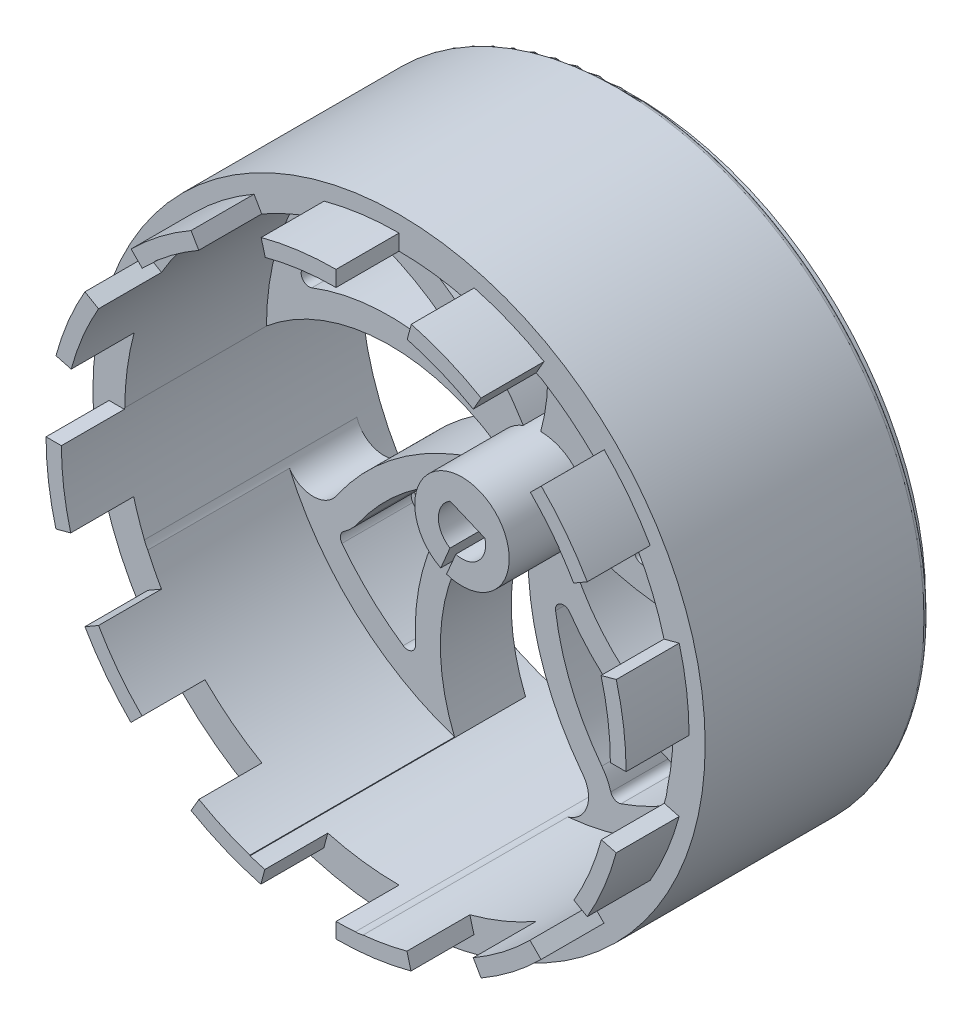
ISO-10303-21;
HEADER;
FILE_DESCRIPTION(('STEP AP214'),'2;1');
FILE_NAME('part.step','',(''),(''),'','','');
FILE_SCHEMA(('AUTOMOTIVE_DESIGN { 1 0 10303 214 1 1 1 1 }'));
ENDSEC;
DATA;
#1=APPLICATION_CONTEXT('core data for automotive mechanical design processes');
#2=APPLICATION_PROTOCOL_DEFINITION('international standard','automotive_design',2000,#1);
#3=PRODUCT_CONTEXT('',#1,'mechanical');
#4=PRODUCT('Part','Part','',(#3));
#5=PRODUCT_RELATED_PRODUCT_CATEGORY('part','',(#4));
#6=PRODUCT_DEFINITION_FORMATION('','',#4);
#7=PRODUCT_DEFINITION_CONTEXT('part definition',#1,'design');
#8=PRODUCT_DEFINITION('design','',#6,#7);
#9=PRODUCT_DEFINITION_SHAPE('','',#8);
#10=(LENGTH_UNIT() NAMED_UNIT(*) SI_UNIT(.MILLI.,.METRE.));
#11=(NAMED_UNIT(*) PLANE_ANGLE_UNIT() SI_UNIT($,.RADIAN.));
#12=(NAMED_UNIT(*) SI_UNIT($,.STERADIAN.) SOLID_ANGLE_UNIT());
#13=UNCERTAINTY_MEASURE_WITH_UNIT(LENGTH_MEASURE(1.E-05),#10,'distance_accuracy_value','');
#14=(GEOMETRIC_REPRESENTATION_CONTEXT(3) GLOBAL_UNCERTAINTY_ASSIGNED_CONTEXT((#13)) GLOBAL_UNIT_ASSIGNED_CONTEXT((#10,
#11,#12)) REPRESENTATION_CONTEXT('',''));
#15=CARTESIAN_POINT('',(0.,0.,0.));
#16=DIRECTION('',(0.,0.,1.));
#17=DIRECTION('',(1.,0.,0.));
#18=AXIS2_PLACEMENT_3D('',#15,#16,#17);
#19=CARTESIAN_POINT('',(0.,0.,1.5));
#20=DIRECTION('',(0.,0.,-1.));
#21=DIRECTION('',(-1.,0.,0.));
#22=AXIS2_PLACEMENT_3D('',#19,#20,#21);
#23=PLANE('',#22);
#24=CARTESIAN_POINT('',(0.851685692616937,-16.521083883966,1.5));
#25=DIRECTION('',(0.,0.,-1.));
#26=DIRECTION('',(-1.,0.,0.));
#27=AXIS2_PLACEMENT_3D('',#24,#25,#26);
#28=CIRCLE('',#27,15.1759813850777);
#29=CARTESIAN_POINT('',(-11.6050834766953,-7.85279034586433,1.5));
#30=VERTEX_POINT('',#29);
#31=CARTESIAN_POINT('',(-5.77686803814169,-2.86924567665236,1.5));
#32=VERTEX_POINT('',#31);
#33=EDGE_CURVE('E947',#30,#32,#28,.T.);
#34=ORIENTED_EDGE('',*,*,#33,.F.);
#35=CARTESIAN_POINT('',(-14.4757779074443,-5.85515984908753,1.5));
#36=DIRECTION('',(0.,0.,1.));
#37=DIRECTION('',(1.,0.,0.));
#38=AXIS2_PLACEMENT_3D('',#35,#36,#37);
#39=CIRCLE('',#38,3.49734386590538);
#40=CARTESIAN_POINT('',(-12.5072160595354,-8.74586536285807,1.5));
#41=VERTEX_POINT('',#40);
#42=EDGE_CURVE('E964',#41,#30,#39,.T.);
#43=ORIENTED_EDGE('',*,*,#42,.F.);
#44=CARTESIAN_POINT('',(-12.2257793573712,-9.15913692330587,1.5));
#45=DIRECTION('',(0.,0.,-1.));
#46=DIRECTION('',(1.,0.,0.));
#47=AXIS2_PLACEMENT_3D('',#44,#45,#46);
#48=CIRCLE('',#47,0.5);
#49=CARTESIAN_POINT('',(-12.6234362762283,-9.46223587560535,1.5));
#50=VERTEX_POINT('',#49);
#51=EDGE_CURVE('E961',#50,#41,#48,.T.);
#52=ORIENTED_EDGE('',*,*,#51,.F.);
#53=CARTESIAN_POINT('',(0.604298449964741,0.620104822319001,1.5));
#54=DIRECTION('',(0.,0.,-1.));
#55=DIRECTION('',(-1.,0.,0.));
#56=AXIS2_PLACEMENT_3D('',#53,#54,#55);
#57=CIRCLE('',#56,16.6320942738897);
#58=CARTESIAN_POINT('',(-8.73386387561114,-13.1430810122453,1.5));
#59=VERTEX_POINT('',#58);
#60=EDGE_CURVE('E958',#59,#50,#57,.T.);
#61=ORIENTED_EDGE('',*,*,#60,.F.);
#62=CARTESIAN_POINT('',(-8.45313668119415,-12.7293271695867,1.5));
#63=DIRECTION('',(0.,0.,-1.));
#64=DIRECTION('',(-1.,0.,0.));
#65=AXIS2_PLACEMENT_3D('',#62,#63,#64);
#66=CIRCLE('',#65,0.499999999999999);
#67=CARTESIAN_POINT('',(-7.95386994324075,-12.702258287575,1.5));
#68=VERTEX_POINT('',#67);
#69=EDGE_CURVE('E955',#68,#59,#66,.T.);
#70=ORIENTED_EDGE('',*,*,#69,.F.);
#71=CARTESIAN_POINT('',(5.78133535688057,-11.9575728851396,1.5));
#72=DIRECTION('',(0.,0.,1.));
#73=DIRECTION('',(-1.,0.,0.));
#74=AXIS2_PLACEMENT_3D('',#71,#72,#73);
#75=CIRCLE('',#74,13.7553778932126);
#76=CARTESIAN_POINT('',(-5.16074031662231,-3.62202245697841,1.5));
#77=VERTEX_POINT('',#76);
#78=EDGE_CURVE('E952',#77,#68,#75,.T.);
#79=ORIENTED_EDGE('',*,*,#78,.F.);
#80=CARTESIAN_POINT('',(-5.55847841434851,-3.31903003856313,1.5));
#81=DIRECTION('',(0.,0.,-1.));
#82=DIRECTION('',(1.,0.,0.));
#83=AXIS2_PLACEMENT_3D('',#80,#81,#82);
#84=CIRCLE('',#83,0.5);
#85=EDGE_CURVE('E949',#32,#77,#84,.T.);
#86=ORIENTED_EDGE('',*,*,#85,.F.);
#87=EDGE_LOOP('',(#34,#43,#52,#61,#70,#79,#86));
#88=FACE_BOUND('',#87,.T.);
#89=CARTESIAN_POINT('',(0.851685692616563,-16.5210838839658,1.5));
#90=DIRECTION('',(0.,0.,1.));
#91=DIRECTION('',(1.,0.,0.));
#92=AXIS2_PLACEMENT_3D('',#89,#90,#91);
#93=CIRCLE('',#92,16.7759813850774);
#94=CARTESIAN_POINT('',(-2.99386212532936,-0.191806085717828,1.5));
#95=VERTEX_POINT('',#94);
#96=CARTESIAN_POINT('',(-12.9183975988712,-6.93889428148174,1.5));
#97=VERTEX_POINT('',#96);
#98=EDGE_CURVE('E1242',#95,#97,#93,.T.);
#99=ORIENTED_EDGE('',*,*,#98,.F.);
#100=CARTESIAN_POINT('',(0.,0.,1.5));
#101=DIRECTION('',(0.,0.,-1.));
#102=DIRECTION('',(-1.,0.,0.));
#103=AXIS2_PLACEMENT_3D('',#100,#101,#102);
#104=CIRCLE('',#103,3.);
#105=CARTESIAN_POINT('',(-1.76335575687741,-2.42705098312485,1.5));
#106=VERTEX_POINT('',#105);
#107=EDGE_CURVE('E846',#106,#95,#104,.T.);
#108=ORIENTED_EDGE('',*,*,#107,.F.);
#109=CARTESIAN_POINT('',(5.78133535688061,-11.9575728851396,1.5));
#110=DIRECTION('',(0.,0.,-1.));
#111=DIRECTION('',(1.,0.,0.));
#112=AXIS2_PLACEMENT_3D('',#109,#110,#111);
#113=CIRCLE('',#112,12.1553778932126);
#114=CARTESIAN_POINT('',(-5.46390980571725,-16.5725130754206,1.5));
#115=VERTEX_POINT('',#114);
#116=EDGE_CURVE('E1214',#115,#106,#113,.T.);
#117=ORIENTED_EDGE('',*,*,#116,.F.);
#118=CARTESIAN_POINT('',(0.,0.,1.5));
#119=DIRECTION('',(0.,0.,-1.));
#120=DIRECTION('',(-1.,0.,0.));
#121=AXIS2_PLACEMENT_3D('',#118,#119,#120);
#122=CIRCLE('',#121,17.45);
#123=CARTESIAN_POINT('',(-16.0618398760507,-6.82054248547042,1.5));
#124=VERTEX_POINT('',#123);
#125=EDGE_CURVE('E1330',#115,#124,#122,.T.);
#126=ORIENTED_EDGE('',*,*,#125,.T.);
#127=CARTESIAN_POINT('',(-14.4567338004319,-5.99300921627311,1.5));
#128=DIRECTION('',(0.,0.,-1.));
#129=DIRECTION('',(1.,0.,0.));
#130=AXIS2_PLACEMENT_3D('',#127,#128,#129);
#131=CIRCLE('',#130,1.80587287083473);
#132=EDGE_CURVE('E1957',#97,#124,#131,.T.);
#133=ORIENTED_EDGE('',*,*,#132,.F.);
#134=EDGE_LOOP('',(#99,#108,#117,#126,#133));
#135=FACE_BOUND('',#134,.T.);
#136=ADVANCED_FACE('F26',(#88,#135),#23,.T.);
#137=CARTESIAN_POINT('',(15.9756698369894,-4.29529445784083,1.5));
#138=DIRECTION('',(0.,0.,-1.));
#139=DIRECTION('',(-1.,0.,0.));
#140=AXIS2_PLACEMENT_3D('',#137,#138,#139);
#141=CIRCLE('',#140,15.1759813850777);
#142=CARTESIAN_POINT('',(3.88227941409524,-13.4637359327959,1.5));
#143=VERTEX_POINT('',#142);
#144=CARTESIAN_POINT('',(0.943664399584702,-6.38077366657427,1.5));
#145=VERTEX_POINT('',#144);
#146=EDGE_CURVE('E897',#143,#145,#141,.T.);
#147=ORIENTED_EDGE('',*,*,#146,.F.);
#148=CARTESIAN_POINT('',(1.0953265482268,-15.5766268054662,1.5));
#149=DIRECTION('',(0.,0.,1.));
#150=DIRECTION('',(1.,0.,0.));
#151=AXIS2_PLACEMENT_3D('',#148,#149,#150);
#152=CIRCLE('',#151,3.49734386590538);
#153=CARTESIAN_POINT('',(4.4528699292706,-14.5976903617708,1.5));
#154=VERTEX_POINT('',#153);
#155=EDGE_CURVE('E914',#154,#143,#152,.T.);
#156=ORIENTED_EDGE('',*,*,#155,.F.);
#157=CARTESIAN_POINT('',(4.93288326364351,-14.4577360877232,1.5));
#158=DIRECTION('',(0.,0.,-1.));
#159=DIRECTION('',(1.,0.,0.));
#160=AXIS2_PLACEMENT_3D('',#157,#158,#159);
#161=CIRCLE('',#160,0.499999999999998);
#162=CARTESIAN_POINT('',(5.09826475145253,-14.9295930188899,1.5));
#163=VERTEX_POINT('',#162);
#164=EDGE_CURVE('E911',#163,#154,#161,.T.);
#165=ORIENTED_EDGE('',*,*,#164,.F.);
#166=CARTESIAN_POINT('',(-0.40301624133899,0.766344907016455,1.5));
#167=DIRECTION('',(0.,0.,-1.));
#168=DIRECTION('',(-1.,0.,0.));
#169=AXIS2_PLACEMENT_3D('',#166,#167,#168);
#170=CIRCLE('',#169,16.6320942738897);
#171=CARTESIAN_POINT('',(9.80090047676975,-12.3678335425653,1.5));
#172=VERTEX_POINT('',#171);
#173=EDGE_CURVE('E908',#172,#163,#170,.T.);
#174=ORIENTED_EDGE('',*,*,#173,.F.);
#175=CARTESIAN_POINT('',(9.49414666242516,-11.9729891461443,1.5));
#176=DIRECTION('',(0.,0.,-1.));
#177=DIRECTION('',(-1.,0.,0.));
#178=AXIS2_PLACEMENT_3D('',#175,#176,#177);
#179=CIRCLE('',#178,0.5);
#180=CARTESIAN_POINT('',(9.62268453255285,-11.4897935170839,1.5));
#181=VERTEX_POINT('',#180);
#182=EDGE_CURVE('E905',#181,#172,#179,.T.);
#183=ORIENTED_EDGE('',*,*,#182,.F.);
#184=CARTESIAN_POINT('',(13.1588584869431,1.80328343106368,1.5));
#185=DIRECTION('',(0.,0.,1.));
#186=DIRECTION('',(-1.,0.,0.));
#187=AXIS2_PLACEMENT_3D('',#184,#185,#186);
#188=CIRCLE('',#187,13.7553778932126);
#189=CARTESIAN_POINT('',(1.84999159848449,-6.02742220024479,1.5));
#190=VERTEX_POINT('',#189);
#191=EDGE_CURVE('E902',#190,#181,#188,.T.);
#192=ORIENTED_EDGE('',*,*,#191,.F.);
#193=CARTESIAN_POINT('',(1.43892085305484,-6.31206380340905,1.5));
#194=DIRECTION('',(0.,0.,-1.));
#195=DIRECTION('',(1.,0.,0.));
#196=AXIS2_PLACEMENT_3D('',#193,#194,#195);
#197=CIRCLE('',#196,0.5);
#198=EDGE_CURVE('E899',#145,#190,#197,.T.);
#199=ORIENTED_EDGE('',*,*,#198,.F.);
#200=EDGE_LOOP('',(#147,#156,#165,#174,#183,#192,#199));
#201=FACE_BOUND('',#200,.T.);
#202=CARTESIAN_POINT('',(15.9756698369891,-4.29529445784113,1.5));
#203=DIRECTION('',(0.,0.,1.));
#204=DIRECTION('',(1.,0.,0.));
#205=AXIS2_PLACEMENT_3D('',#202,#203,#204);
#206=CIRCLE('',#205,16.7759813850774);
#207=CARTESIAN_POINT('',(-0.74273584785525,-2.90660342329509,1.5));
#208=VERTEX_POINT('',#207);
#209=CARTESIAN_POINT('',(2.60727622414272,-14.4303624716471,1.5));
#210=VERTEX_POINT('',#209);
#211=EDGE_CURVE('E1203',#208,#210,#206,.T.);
#212=ORIENTED_EDGE('',*,*,#211,.F.);
#213=CARTESIAN_POINT('',(1.76335575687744,-2.42705098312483,1.5));
#214=VERTEX_POINT('',#213);
#215=EDGE_CURVE('E2286',#214,#208,#104,.T.);
#216=ORIENTED_EDGE('',*,*,#215,.F.);
#217=CARTESIAN_POINT('',(13.1588584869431,1.80328343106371,1.5));
#218=DIRECTION('',(0.,0.,-1.));
#219=DIRECTION('',(1.,0.,0.));
#220=AXIS2_PLACEMENT_3D('',#217,#218,#219);
#221=CIRCLE('',#220,12.1553778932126);
#222=CARTESIAN_POINT('',(14.0729555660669,-10.3176752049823,1.5));
#223=VERTEX_POINT('',#222);
#224=EDGE_CURVE('E1154',#223,#214,#221,.T.);
#225=ORIENTED_EDGE('',*,*,#224,.F.);
#226=CARTESIAN_POINT('',(1.52333989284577,-17.383381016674,1.5));
#227=VERTEX_POINT('',#226);
#228=EDGE_CURVE('E1333',#223,#227,#122,.T.);
#229=ORIENTED_EDGE('',*,*,#228,.T.);
#230=CARTESIAN_POINT('',(1.23231403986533,-15.6011125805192,1.5));
#231=DIRECTION('',(0.,0.,-1.));
#232=DIRECTION('',(1.,0.,0.));
#233=AXIS2_PLACEMENT_3D('',#230,#231,#232);
#234=CIRCLE('',#233,1.80587287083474);
#235=EDGE_CURVE('E1206',#210,#227,#234,.T.);
#236=ORIENTED_EDGE('',*,*,#235,.F.);
#237=EDGE_LOOP('',(#212,#216,#225,#229,#236));
#238=FACE_BOUND('',#237,.T.);
#239=ADVANCED_FACE('F1404',(#201,#238),#23,.T.);
#240=CARTESIAN_POINT('',(9.02182125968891,13.8664459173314,1.5));
#241=DIRECTION('',(0.,0.,-1.));
#242=DIRECTION('',(-1.,0.,0.));
#243=AXIS2_PLACEMENT_3D('',#240,#241,#242);
#244=CIRCLE('',#243,15.1759813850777);
#245=CARTESIAN_POINT('',(14.0044641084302,-0.46825607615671,1.5));
#246=VERTEX_POINT('',#245);
#247=CARTESIAN_POINT('',(6.36008471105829,-1.07428932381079,1.5));
#248=VERTEX_POINT('',#247);
#249=EDGE_CURVE('E849',#246,#248,#244,.T.);
#250=ORIENTED_EDGE('',*,*,#249,.F.);
#251=CARTESIAN_POINT('',(15.1527269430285,-3.77172494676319,1.5));
#252=DIRECTION('',(0.,0.,1.));
#253=DIRECTION('',(1.,0.,0.));
#254=AXIS2_PLACEMENT_3D('',#251,#252,#253);
#255=CIRCLE('',#254,3.49734386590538);
#256=CARTESIAN_POINT('',(15.2592410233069,-0.27600343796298,1.5));
#257=VERTEX_POINT('',#256);
#258=EDGE_CURVE('E866',#257,#246,#255,.T.);
#259=ORIENTED_EDGE('',*,*,#258,.F.);
#260=CARTESIAN_POINT('',(15.2744688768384,0.223764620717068,1.5));
#261=DIRECTION('',(0.,0.,-1.));
#262=DIRECTION('',(1.,0.,0.));
#263=AXIS2_PLACEMENT_3D('',#260,#261,#262);
#264=CIRCLE('',#263,0.499999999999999);
#265=CARTESIAN_POINT('',(15.7743371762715,0.2352399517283,1.5));
#266=VERTEX_POINT('',#265);
#267=EDGE_CURVE('E863',#266,#257,#264,.T.);
#268=ORIENTED_EDGE('',*,*,#267,.F.);
#269=CARTESIAN_POINT('',(-0.85337618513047,-0.146477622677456,1.5));
#270=DIRECTION('',(0.,0.,-1.));
#271=DIRECTION('',(-1.,0.,0.));
#272=AXIS2_PLACEMENT_3D('',#269,#270,#271);
#273=CIRCLE('',#272,16.6320942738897);
#274=CARTESIAN_POINT('',(14.7911534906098,5.499339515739,1.5));
#275=VERTEX_POINT('',#274);
#276=EDGE_CURVE('E860',#275,#266,#273,.T.);
#277=ORIENTED_EDGE('',*,*,#276,.F.);
#278=CARTESIAN_POINT('',(14.3208420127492,5.32961293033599,1.5));
#279=DIRECTION('',(0.,0.,-1.));
#280=DIRECTION('',(-1.,0.,0.));
#281=AXIS2_PLACEMENT_3D('',#278,#279,#280);
#282=CIRCLE('',#281,0.5);
#283=CARTESIAN_POINT('',(13.9010160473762,5.60117537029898,1.5));
#284=VERTEX_POINT('',#283);
#285=EDGE_CURVE('E857',#284,#275,#282,.T.);
#286=ORIENTED_EDGE('',*,*,#285,.F.);
#287=CARTESIAN_POINT('',(2.35128644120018,13.0720633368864,1.5));
#288=DIRECTION('',(0.,0.,1.));
#289=DIRECTION('',(-1.,0.,0.));
#290=AXIS2_PLACEMENT_3D('',#287,#288,#289);
#291=CIRCLE('',#290,13.7553778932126);
#292=CARTESIAN_POINT('',(6.30409800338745,-0.103129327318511,1.5));
#293=VERTEX_POINT('',#292);
#294=EDGE_CURVE('E854',#293,#284,#291,.T.);
#295=ORIENTED_EDGE('',*,*,#294,.F.);
#296=CARTESIAN_POINT('',(6.44778040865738,-0.582039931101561,1.5));
#297=DIRECTION('',(0.,0.,-1.));
#298=DIRECTION('',(1.,0.,0.));
#299=AXIS2_PLACEMENT_3D('',#296,#297,#298);
#300=CIRCLE('',#299,0.5);
#301=EDGE_CURVE('E852',#248,#293,#300,.T.);
#302=ORIENTED_EDGE('',*,*,#301,.F.);
#303=EDGE_LOOP('',(#250,#259,#268,#277,#286,#295,#302));
#304=FACE_BOUND('',#303,.T.);
#305=CARTESIAN_POINT('',(9.0218212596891,13.866445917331,1.5));
#306=DIRECTION('',(0.,0.,1.));
#307=DIRECTION('',(1.,0.,0.));
#308=AXIS2_PLACEMENT_3D('',#305,#306,#307);
#309=CIRCLE('',#308,16.7759813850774);
#310=CARTESIAN_POINT('',(2.53482612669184,-1.60457362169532,1.5));
#311=VERTEX_POINT('',#310);
#312=CARTESIAN_POINT('',(14.5297829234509,-1.97956019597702,1.5));
#313=VERTEX_POINT('',#312);
#314=EDGE_CURVE('E1143',#311,#313,#309,.T.);
#315=ORIENTED_EDGE('',*,*,#314,.F.);
#316=CARTESIAN_POINT('',(2.85316954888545,0.927050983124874,1.5));
#317=VERTEX_POINT('',#316);
#318=EDGE_CURVE('E2285',#317,#311,#104,.T.);
#319=ORIENTED_EDGE('',*,*,#318,.F.);
#320=CARTESIAN_POINT('',(2.35128644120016,13.0720633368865,1.5));
#321=DIRECTION('',(0.,0.,-1.));
#322=DIRECTION('',(1.,0.,0.));
#323=AXIS2_PLACEMENT_3D('',#320,#321,#322);
#324=CIRCLE('',#323,12.1553778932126);
#325=CARTESIAN_POINT('',(14.1614746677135,10.1958391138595,1.5));
#326=VERTEX_POINT('',#325);
#327=EDGE_CURVE('E1103',#326,#317,#324,.T.);
#328=ORIENTED_EDGE('',*,*,#327,.F.);
#329=CARTESIAN_POINT('',(17.003315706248,-3.92297782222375,1.5));
#330=VERTEX_POINT('',#329);
#331=EDGE_CURVE('E1345',#326,#330,#122,.T.);
#332=ORIENTED_EDGE('',*,*,#331,.T.);
#333=CARTESIAN_POINT('',(15.2183457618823,-3.64900862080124,1.5));
#334=DIRECTION('',(0.,0.,-1.));
#335=DIRECTION('',(1.,0.,0.));
#336=AXIS2_PLACEMENT_3D('',#333,#334,#335);
#337=CIRCLE('',#336,1.80587287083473);
#338=EDGE_CURVE('E1146',#313,#330,#337,.T.);
#339=ORIENTED_EDGE('',*,*,#338,.F.);
#340=EDGE_LOOP('',(#315,#319,#328,#332,#339));
#341=FACE_BOUND('',#340,.T.);
#342=ADVANCED_FACE('F1411',(#304,#341),#23,.T.);
#343=CARTESIAN_POINT('',(-10.3998776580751,12.8652293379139,1.5));
#344=DIRECTION('',(0.,0.,-1.));
#345=DIRECTION('',(-1.,0.,0.));
#346=AXIS2_PLACEMENT_3D('',#343,#344,#345);
#347=CIRCLE('',#346,15.1759813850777);
#348=CARTESIAN_POINT('',(4.7729553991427,13.1743377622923,1.5));
#349=VERTEX_POINT('',#348);
#350=CARTESIAN_POINT('',(2.98708412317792,5.71682635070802,1.5));
#351=VERTEX_POINT('',#350);
#352=EDGE_CURVE('E997',#349,#351,#347,.T.);
#353=ORIENTED_EDGE('',*,*,#352,.F.);
#354=CARTESIAN_POINT('',(8.26957372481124,13.2455725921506,1.5));
#355=DIRECTION('',(0.,0.,1.));
#356=DIRECTION('',(1.,0.,0.));
#357=AXIS2_PLACEMENT_3D('',#354,#355,#356);
#358=CIRCLE('',#357,3.49734386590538);
#359=CARTESIAN_POINT('',(4.97785966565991,14.4271108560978,1.5));
#360=VERTEX_POINT('',#359);
#361=EDGE_CURVE('E1014',#360,#349,#358,.T.);
#362=ORIENTED_EDGE('',*,*,#361,.F.);
#363=CARTESIAN_POINT('',(4.50725766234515,14.596030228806,1.5));
#364=DIRECTION('',(0.,0.,-1.));
#365=DIRECTION('',(1.,0.,0.));
#366=AXIS2_PLACEMENT_3D('',#363,#364,#365);
#367=CIRCLE('',#366,0.5);
#368=CARTESIAN_POINT('',(4.65081177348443,15.0749793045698,1.5));
#369=VERTEX_POINT('',#368);
#370=EDGE_CURVE('E1011',#369,#360,#367,.T.);
#371=ORIENTED_EDGE('',*,*,#370,.F.);
#372=CARTESIAN_POINT('',(-0.124399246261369,-0.856873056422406,1.5));
#373=DIRECTION('',(0.,0.,-1.));
#374=DIRECTION('',(-1.,0.,0.));
#375=AXIS2_PLACEMENT_3D('',#372,#373,#374);
#376=CIRCLE('',#375,16.6320942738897);
#377=CARTESIAN_POINT('',(-0.659464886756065,15.7666122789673,1.5));
#378=VERTEX_POINT('',#377);
#379=EDGE_CURVE('E1008',#378,#369,#376,.T.);
#380=ORIENTED_EDGE('',*,*,#379,.F.);
#381=CARTESIAN_POINT('',(-0.643379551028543,15.2668710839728,1.5));
#382=DIRECTION('',(0.,0.,-1.));
#383=DIRECTION('',(-1.,0.,0.));
#384=AXIS2_PLACEMENT_3D('',#381,#382,#383);
#385=CIRCLE('',#384,0.5);
#386=CARTESIAN_POINT('',(-1.03138413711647,14.9515102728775,1.5));
#387=VERTEX_POINT('',#386);
#388=EDGE_CURVE('E1005',#387,#378,#385,.T.);
#389=ORIENTED_EDGE('',*,*,#388,.F.);
#390=CARTESIAN_POINT('',(-11.7056835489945,6.2756960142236,1.5));
#391=DIRECTION('',(0.,0.,1.));
#392=DIRECTION('',(-1.,0.,0.));
#393=AXIS2_PLACEMENT_3D('',#390,#391,#392);
#394=CIRCLE('',#393,13.7553778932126);
#395=CARTESIAN_POINT('',(2.04615523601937,5.963684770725,1.5));
#396=VERTEX_POINT('',#395);
#397=EDGE_CURVE('E1002',#396,#387,#394,.T.);
#398=ORIENTED_EDGE('',*,*,#397,.F.);
#399=CARTESIAN_POINT('',(2.54602659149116,5.9523433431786,1.5));
#400=DIRECTION('',(0.,0.,-1.));
#401=DIRECTION('',(1.,0.,0.));
#402=AXIS2_PLACEMENT_3D('',#399,#400,#401);
#403=CIRCLE('',#402,0.5);
#404=EDGE_CURVE('E999',#351,#396,#403,.T.);
#405=ORIENTED_EDGE('',*,*,#404,.F.);
#406=EDGE_LOOP('',(#353,#362,#371,#380,#389,#398,#405));
#407=FACE_BOUND('',#406,.T.);
#408=CARTESIAN_POINT('',(-10.3998776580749,12.8652293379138,1.5));
#409=DIRECTION('',(0.,0.,1.));
#410=DIRECTION('',(1.,0.,0.));
#411=AXIS2_PLACEMENT_3D('',#408,#409,#410);
#412=CIRCLE('',#411,16.7759813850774);
#413=CARTESIAN_POINT('',(2.30934454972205,1.91492238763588,1.5));
#414=VERTEX_POINT('',#413);
#415=CARTESIAN_POINT('',(6.37262347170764,13.2069269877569,1.5));
#416=VERTEX_POINT('',#415);
#417=EDGE_CURVE('E1097',#414,#416,#412,.T.);
#418=ORIENTED_EDGE('',*,*,#417,.F.);
#419=CARTESIAN_POINT('',(0.,3.,1.5));
#420=VERTEX_POINT('',#419);
#421=EDGE_CURVE('E850',#420,#414,#104,.T.);
#422=ORIENTED_EDGE('',*,*,#421,.F.);
#423=CARTESIAN_POINT('',(-11.7056835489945,6.27569601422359,1.5));
#424=DIRECTION('',(0.,0.,-1.));
#425=DIRECTION('',(1.,0.,0.));
#426=AXIS2_PLACEMENT_3D('',#423,#424,#425);
#427=CIRCLE('',#426,12.1553778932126);
#428=CARTESIAN_POINT('',(-5.32068289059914,16.6190503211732,1.5));
#429=VERTEX_POINT('',#428);
#430=EDGE_CURVE('E1293',#429,#420,#427,.T.);
#431=ORIENTED_EDGE('',*,*,#430,.F.);
#432=CARTESIAN_POINT('',(8.98528713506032,14.9588473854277,1.5));
#433=VERTEX_POINT('',#432);
#434=EDGE_CURVE('E1323',#429,#433,#122,.T.);
#435=ORIENTED_EDGE('',*,*,#434,.T.);
#436=CARTESIAN_POINT('',(8.17314089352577,13.3459012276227,1.5));
#437=DIRECTION('',(0.,0.,-1.));
#438=DIRECTION('',(1.,0.,0.));
#439=AXIS2_PLACEMENT_3D('',#436,#437,#438);
#440=CIRCLE('',#439,1.80587287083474);
#441=EDGE_CURVE('E1100',#416,#433,#440,.T.);
#442=ORIENTED_EDGE('',*,*,#441,.F.);
#443=EDGE_LOOP('',(#418,#422,#431,#435,#442));
#444=FACE_BOUND('',#443,.T.);
#445=ADVANCED_FACE('F1417',(#407,#444),#23,.T.);
#446=CARTESIAN_POINT('',(-15.4492991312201,-5.91529691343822,1.5));
#447=DIRECTION('',(0.,0.,-1.));
#448=DIRECTION('',(-1.,0.,0.));
#449=AXIS2_PLACEMENT_3D('',#446,#447,#448);
#450=CIRCLE('',#449,15.1759813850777);
#451=CARTESIAN_POINT('',(-11.0546154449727,8.61044459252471,1.5));
#452=VERTEX_POINT('',#451);
#453=CARTESIAN_POINT('',(-4.51396519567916,4.60748231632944,1.5));
#454=VERTEX_POINT('',#453);
#455=EDGE_CURVE('E1047',#452,#454,#450,.T.);
#456=ORIENTED_EDGE('',*,*,#455,.F.);
#457=CARTESIAN_POINT('',(-10.0418493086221,11.9579390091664,1.5));
#458=DIRECTION('',(0.,0.,1.));
#459=DIRECTION('',(1.,0.,0.));
#460=AXIS2_PLACEMENT_3D('',#457,#458,#459);
#461=CIRCLE('',#460,3.49734386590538);
#462=CARTESIAN_POINT('',(-12.1827545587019,9.19244830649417,1.5));
#463=VERTEX_POINT('',#462);
#464=EDGE_CURVE('E1064',#463,#452,#461,.T.);
#465=ORIENTED_EDGE('',*,*,#464,.F.);
#466=CARTESIAN_POINT('',(-12.4888304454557,8.7970781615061,1.5));
#467=DIRECTION('',(0.,0.,-1.));
#468=DIRECTION('',(1.,0.,0.));
#469=AXIS2_PLACEMENT_3D('',#466,#467,#468);
#470=CIRCLE('',#469,0.500000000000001);
#471=CARTESIAN_POINT('',(-12.89997742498,9.08160963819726,1.5));
#472=VERTEX_POINT('',#471);
#473=EDGE_CURVE('E1061',#472,#463,#470,.T.);
#474=ORIENTED_EDGE('',*,*,#473,.F.);
#475=CARTESIAN_POINT('',(0.776493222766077,-0.383099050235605,1.5));
#476=DIRECTION('',(0.,0.,-1.));
#477=DIRECTION('',(-1.,0.,0.));
#478=AXIS2_PLACEMENT_3D('',#475,#476,#477);
#479=CIRCLE('',#478,16.6320942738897);
#480=CARTESIAN_POINT('',(-15.1987252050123,4.24496276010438,1.5));
#481=VERTEX_POINT('',#480);
#482=EDGE_CURVE('E1058',#481,#472,#479,.T.);
#483=ORIENTED_EDGE('',*,*,#482,.F.);
#484=CARTESIAN_POINT('',(-14.7184724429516,4.1058323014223,1.5));
#485=DIRECTION('',(0.,0.,-1.));
#486=DIRECTION('',(-1.,0.,0.));
#487=AXIS2_PLACEMENT_3D('',#484,#485,#486);
#488=CIRCLE('',#487,0.5);
#489=CARTESIAN_POINT('',(-14.5384464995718,3.63936616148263,1.5));
#490=VERTEX_POINT('',#489);
#491=EDGE_CURVE('E1055',#490,#481,#488,.T.);
#492=ORIENTED_EDGE('',*,*,#491,.F.);
#493=CARTESIAN_POINT('',(-9.58579673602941,-9.19346989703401,1.5));
#494=DIRECTION('',(0.,0.,1.));
#495=DIRECTION('',(-1.,0.,0.));
#496=AXIS2_PLACEMENT_3D('',#493,#494,#495);
#497=CIRCLE('',#496,13.7553778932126);
#498=CARTESIAN_POINT('',(-5.03950452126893,3.78888921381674,1.5));
#499=VERTEX_POINT('',#498);
#500=EDGE_CURVE('E1052',#499,#490,#497,.T.);
#501=ORIENTED_EDGE('',*,*,#500,.F.);
#502=CARTESIAN_POINT('',(-4.87424943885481,4.26079042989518,1.5));
#503=DIRECTION('',(0.,0.,-1.));
#504=DIRECTION('',(1.,0.,0.));
#505=AXIS2_PLACEMENT_3D('',#502,#503,#504);
#506=CIRCLE('',#505,0.5);
#507=EDGE_CURVE('E1049',#454,#499,#506,.T.);
#508=ORIENTED_EDGE('',*,*,#507,.F.);
#509=EDGE_LOOP('',(#456,#465,#474,#483,#492,#501,#508));
#510=FACE_BOUND('',#509,.T.);
#511=CARTESIAN_POINT('',(-15.4492991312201,-5.9152969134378,1.5));
#512=DIRECTION('',(0.,0.,1.));
#513=DIRECTION('',(1.,0.,0.));
#514=AXIS2_PLACEMENT_3D('',#511,#512,#513);
#515=CIRCLE('',#514,16.7759813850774);
#516=CARTESIAN_POINT('',(-1.10757270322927,2.7880607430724,1.5));
#517=VERTEX_POINT('',#516);
#518=CARTESIAN_POINT('',(-10.5912850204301,10.1418899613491,1.5));
#519=VERTEX_POINT('',#518);
#520=EDGE_CURVE('E1278',#517,#519,#515,.T.);
#521=ORIENTED_EDGE('',*,*,#520,.F.);
#522=CARTESIAN_POINT('',(-2.85316954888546,0.927050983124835,1.5));
#523=VERTEX_POINT('',#522);
#524=EDGE_CURVE('E847',#523,#517,#104,.T.);
#525=ORIENTED_EDGE('',*,*,#524,.F.);
#526=CARTESIAN_POINT('',(-9.5857967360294,-9.19346989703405,1.5));
#527=DIRECTION('',(0.,0.,-1.));
#528=DIRECTION('',(1.,0.,0.));
#529=AXIS2_PLACEMENT_3D('',#526,#527,#528);
#530=CIRCLE('',#529,12.1553778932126);
#531=CARTESIAN_POINT('',(-17.4498375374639,0.0752988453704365,1.5));
#532=VERTEX_POINT('',#531);
#533=EDGE_CURVE('E1959',#532,#523,#530,.T.);
#534=ORIENTED_EDGE('',*,*,#533,.F.);
#535=CARTESIAN_POINT('',(-11.4501028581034,13.1680539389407,1.5));
#536=VERTEX_POINT('',#535);
#537=EDGE_CURVE('E1307',#532,#536,#122,.T.);
#538=ORIENTED_EDGE('',*,*,#537,.T.);
#539=CARTESIAN_POINT('',(-10.1670668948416,11.8972291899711,1.5));
#540=DIRECTION('',(0.,0.,-1.));
#541=DIRECTION('',(1.,0.,0.));
#542=AXIS2_PLACEMENT_3D('',#539,#540,#541);
#543=CIRCLE('',#542,1.80587287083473);
#544=EDGE_CURVE('E1286',#519,#536,#543,.T.);
#545=ORIENTED_EDGE('',*,*,#544,.F.);
#546=EDGE_LOOP('',(#521,#525,#534,#538,#545));
#547=FACE_BOUND('',#546,.T.);
#548=ADVANCED_FACE('F1406',(#510,#547),#23,.T.);
#549=CARTESIAN_POINT('',(0.,0.,6.));
#550=DIRECTION('',(0.,0.,1.));
#551=DIRECTION('',(1.,0.,0.));
#552=AXIS2_PLACEMENT_3D('',#549,#550,#551);
#553=PLANE('',#552);
#554=CARTESIAN_POINT('',(9.02182125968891,13.8664459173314,6.));
#555=DIRECTION('',(0.,0.,1.));
#556=DIRECTION('',(1.,0.,0.));
#557=AXIS2_PLACEMENT_3D('',#554,#555,#556);
#558=CIRCLE('',#557,15.1759813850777);
#559=CARTESIAN_POINT('',(6.36008471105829,-1.07428932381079,6.));
#560=VERTEX_POINT('',#559);
#561=CARTESIAN_POINT('',(14.0044641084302,-0.46825607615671,6.));
#562=VERTEX_POINT('',#561);
#563=EDGE_CURVE('E895',#560,#562,#558,.T.);
#564=ORIENTED_EDGE('',*,*,#563,.F.);
#565=CARTESIAN_POINT('',(6.44778040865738,-0.582039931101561,6.));
#566=DIRECTION('',(0.,0.,1.));
#567=DIRECTION('',(1.,0.,0.));
#568=AXIS2_PLACEMENT_3D('',#565,#566,#567);
#569=CIRCLE('',#568,0.5);
#570=CARTESIAN_POINT('',(6.30409800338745,-0.10312932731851,6.));
#571=VERTEX_POINT('',#570);
#572=EDGE_CURVE('E872',#571,#560,#569,.T.);
#573=ORIENTED_EDGE('',*,*,#572,.F.);
#574=CARTESIAN_POINT('',(2.35128644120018,13.0720633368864,6.));
#575=DIRECTION('',(0.,0.,1.));
#576=DIRECTION('',(1.,0.,0.));
#577=AXIS2_PLACEMENT_3D('',#574,#575,#576);
#578=CIRCLE('',#577,13.7553778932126);
#579=CARTESIAN_POINT('',(13.9010160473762,5.60117537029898,6.));
#580=VERTEX_POINT('',#579);
#581=EDGE_CURVE('E885',#580,#571,#578,.F.);
#582=ORIENTED_EDGE('',*,*,#581,.F.);
#583=CARTESIAN_POINT('',(14.3208420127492,5.32961293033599,6.));
#584=DIRECTION('',(0.,0.,1.));
#585=DIRECTION('',(1.,0.,0.));
#586=AXIS2_PLACEMENT_3D('',#583,#584,#585);
#587=CIRCLE('',#586,0.5);
#588=CARTESIAN_POINT('',(14.7911534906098,5.499339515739,6.));
#589=VERTEX_POINT('',#588);
#590=EDGE_CURVE('E887',#589,#580,#587,.T.);
#591=ORIENTED_EDGE('',*,*,#590,.F.);
#592=CARTESIAN_POINT('',(-0.85337618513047,-0.146477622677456,6.));
#593=DIRECTION('',(0.,0.,1.));
#594=DIRECTION('',(1.,0.,0.));
#595=AXIS2_PLACEMENT_3D('',#592,#593,#594);
#596=CIRCLE('',#595,16.6320942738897);
#597=CARTESIAN_POINT('',(15.7743371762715,0.2352399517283,6.));
#598=VERTEX_POINT('',#597);
#599=EDGE_CURVE('E889',#598,#589,#596,.T.);
#600=ORIENTED_EDGE('',*,*,#599,.F.);
#601=CARTESIAN_POINT('',(15.2744688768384,0.223764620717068,6.));
#602=DIRECTION('',(0.,0.,1.));
#603=DIRECTION('',(1.,0.,0.));
#604=AXIS2_PLACEMENT_3D('',#601,#602,#603);
#605=CIRCLE('',#604,0.499999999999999);
#606=CARTESIAN_POINT('',(15.2592410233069,-0.27600343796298,6.));
#607=VERTEX_POINT('',#606);
#608=EDGE_CURVE('E891',#607,#598,#605,.T.);
#609=ORIENTED_EDGE('',*,*,#608,.F.);
#610=CARTESIAN_POINT('',(15.1527269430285,-3.77172494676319,6.));
#611=DIRECTION('',(0.,0.,1.));
#612=DIRECTION('',(1.,0.,0.));
#613=AXIS2_PLACEMENT_3D('',#610,#611,#612);
#614=CIRCLE('',#613,3.49734386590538);
#615=EDGE_CURVE('E893',#562,#607,#614,.F.);
#616=ORIENTED_EDGE('',*,*,#615,.F.);
#617=EDGE_LOOP('',(#564,#573,#582,#591,#600,#609,#616));
#618=FACE_BOUND('',#617,.T.);
#619=CARTESIAN_POINT('',(2.35128644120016,13.0720633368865,6.));
#620=DIRECTION('',(0.,0.,1.));
#621=DIRECTION('',(1.,0.,0.));
#622=AXIS2_PLACEMENT_3D('',#619,#620,#621);
#623=CIRCLE('',#622,12.1553778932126);
#624=CARTESIAN_POINT('',(2.85316954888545,0.927050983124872,6.));
#625=VERTEX_POINT('',#624);
#626=CARTESIAN_POINT('',(14.1536499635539,10.1638977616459,6.));
#627=VERTEX_POINT('',#626);
#628=EDGE_CURVE('E1108',#625,#627,#623,.T.);
#629=ORIENTED_EDGE('',*,*,#628,.F.);
#630=CARTESIAN_POINT('',(0.,0.,6.));
#631=DIRECTION('',(0.,0.,1.));
#632=DIRECTION('',(1.,0.,0.));
#633=AXIS2_PLACEMENT_3D('',#630,#631,#632);
#634=CIRCLE('',#633,3.);
#635=CARTESIAN_POINT('',(2.53482612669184,-1.60457362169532,6.));
#636=VERTEX_POINT('',#635);
#637=EDGE_CURVE('E2811',#636,#625,#634,.T.);
#638=ORIENTED_EDGE('',*,*,#637,.F.);
#639=CARTESIAN_POINT('',(9.0218212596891,13.866445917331,6.));
#640=DIRECTION('',(0.,0.,1.));
#641=DIRECTION('',(1.,0.,0.));
#642=AXIS2_PLACEMENT_3D('',#639,#640,#641);
#643=CIRCLE('',#642,16.7759813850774);
#644=CARTESIAN_POINT('',(14.5297829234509,-1.97956019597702,6.));
#645=VERTEX_POINT('',#644);
#646=EDGE_CURVE('E1182',#645,#636,#643,.F.);
#647=ORIENTED_EDGE('',*,*,#646,.F.);
#648=CARTESIAN_POINT('',(15.2183457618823,-3.64900862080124,6.));
#649=DIRECTION('',(0.,0.,1.));
#650=DIRECTION('',(1.,0.,0.));
#651=AXIS2_PLACEMENT_3D('',#648,#649,#650);
#652=CIRCLE('',#651,1.80587287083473);
#653=CARTESIAN_POINT('',(17.0227190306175,-3.72258805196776,6.));
#654=VERTEX_POINT('',#653);
#655=EDGE_CURVE('E1189',#654,#645,#652,.T.);
#656=ORIENTED_EDGE('',*,*,#655,.F.);
#657=CARTESIAN_POINT('',(0.,0.,6.));
#658=DIRECTION('',(0.,0.,1.));
#659=DIRECTION('',(1.,0.,0.));
#660=AXIS2_PLACEMENT_3D('',#657,#658,#659);
#661=CIRCLE('',#660,17.425);
#662=EDGE_CURVE('E1789',#654,#627,#661,.T.);
#663=ORIENTED_EDGE('',*,*,#662,.T.);
#664=EDGE_LOOP('',(#629,#638,#647,#656,#663));
#665=FACE_BOUND('',#664,.T.);
#666=ADVANCED_FACE('F1416',(#618,#665),#553,.T.);
#667=CARTESIAN_POINT('',(0.,0.,19.));
#668=DIRECTION('',(0.,0.,-1.));
#669=DIRECTION('',(-1.,0.,0.));
#670=AXIS2_PLACEMENT_3D('',#667,#668,#669);
#671=CYLINDRICAL_SURFACE('',#670,17.425);
#672=DIRECTION('',(0.,0.,-1.));
#673=VECTOR('',#672,1.);
#674=CARTESIAN_POINT('',(14.1536499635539,10.1638977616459,10.25));
#675=LINE('',#674,#673);
#676=CARTESIAN_POINT('',(14.1536499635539,10.1638977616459,19.));
#677=VERTEX_POINT('',#676);
#678=EDGE_CURVE('E1138',#627,#677,#675,.F.);
#679=ORIENTED_EDGE('',*,*,#678,.F.);
#680=ORIENTED_EDGE('',*,*,#662,.F.);
#681=DIRECTION('',(0.,0.,-1.));
#682=VECTOR('',#681,1.);
#683=CARTESIAN_POINT('',(17.0227190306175,-3.72258805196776,12.5));
#684=LINE('',#683,#682);
#685=CARTESIAN_POINT('',(17.0227190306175,-3.72258805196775,15.));
#686=VERTEX_POINT('',#685);
#687=EDGE_CURVE('E1187',#686,#654,#684,.T.);
#688=ORIENTED_EDGE('',*,*,#687,.F.);
#689=CARTESIAN_POINT('',(0.,0.,15.));
#690=DIRECTION('',(0.,0.,1.));
#691=DIRECTION('',(1.,0.,0.));
#692=AXIS2_PLACEMENT_3D('',#689,#690,#691);
#693=CIRCLE('',#692,17.425);
#694=CARTESIAN_POINT('',(17.425,0.,15.));
#695=VERTEX_POINT('',#694);
#696=EDGE_CURVE('E1797',#686,#695,#693,.T.);
#697=ORIENTED_EDGE('',*,*,#696,.T.);
#698=DIRECTION('',(0.,0.,1.));
#699=VECTOR('',#698,1.);
#700=CARTESIAN_POINT('',(17.425,0.,15.));
#701=LINE('',#700,#699);
#702=CARTESIAN_POINT('',(17.425,0.,19.));
#703=VERTEX_POINT('',#702);
#704=EDGE_CURVE('E1522',#695,#703,#701,.T.);
#705=ORIENTED_EDGE('',*,*,#704,.T.);
#706=CARTESIAN_POINT('',(0.,0.,19.));
#707=DIRECTION('',(0.,0.,1.));
#708=DIRECTION('',(1.,0.,0.));
#709=AXIS2_PLACEMENT_3D('',#706,#707,#708);
#710=CIRCLE('',#709,17.425);
#711=CARTESIAN_POINT('',(16.833714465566,4.50074241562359,19.));
#712=VERTEX_POINT('',#711);
#713=EDGE_CURVE('E2049',#703,#712,#710,.T.);
#714=ORIENTED_EDGE('',*,*,#713,.T.);
#715=DIRECTION('',(0.,0.,1.));
#716=VECTOR('',#715,1.);
#717=CARTESIAN_POINT('',(16.833714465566,4.50074241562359,15.));
#718=LINE('',#717,#716);
#719=CARTESIAN_POINT('',(16.833714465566,4.50074241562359,15.));
#720=VERTEX_POINT('',#719);
#721=EDGE_CURVE('E1694',#720,#712,#718,.T.);
#722=ORIENTED_EDGE('',*,*,#721,.F.);
#723=CARTESIAN_POINT('',(15.0904926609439,8.71249999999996,15.));
#724=VERTEX_POINT('',#723);
#725=EDGE_CURVE('E1790',#720,#724,#693,.T.);
#726=ORIENTED_EDGE('',*,*,#725,.T.);
#727=DIRECTION('',(0.,0.,1.));
#728=VECTOR('',#727,1.);
#729=CARTESIAN_POINT('',(15.0904926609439,8.71249999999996,15.));
#730=LINE('',#729,#728);
#731=CARTESIAN_POINT('',(15.0904926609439,8.71249999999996,19.));
#732=VERTEX_POINT('',#731);
#733=EDGE_CURVE('E1698',#724,#732,#730,.T.);
#734=ORIENTED_EDGE('',*,*,#733,.T.);
#735=EDGE_CURVE('E2047',#732,#677,#710,.T.);
#736=ORIENTED_EDGE('',*,*,#735,.T.);
#737=EDGE_LOOP('',(#679,#680,#688,#697,#705,#714,#722,#726,#734,#736));
#738=FACE_BOUND('',#737,.T.);
#739=ADVANCED_FACE('F1424',(#738),#671,.F.);
#740=CARTESIAN_POINT('',(15.9756698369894,-4.29529445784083,6.));
#741=DIRECTION('',(0.,0.,1.));
#742=DIRECTION('',(1.,0.,0.));
#743=AXIS2_PLACEMENT_3D('',#740,#741,#742);
#744=CIRCLE('',#743,15.1759813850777);
#745=CARTESIAN_POINT('',(0.943664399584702,-6.38077366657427,6.));
#746=VERTEX_POINT('',#745);
#747=CARTESIAN_POINT('',(3.88227941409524,-13.4637359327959,6.));
#748=VERTEX_POINT('',#747);
#749=EDGE_CURVE('E945',#746,#748,#744,.T.);
#750=ORIENTED_EDGE('',*,*,#749,.F.);
#751=CARTESIAN_POINT('',(1.43892085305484,-6.31206380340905,6.));
#752=DIRECTION('',(0.,0.,1.));
#753=DIRECTION('',(1.,0.,0.));
#754=AXIS2_PLACEMENT_3D('',#751,#752,#753);
#755=CIRCLE('',#754,0.5);
#756=CARTESIAN_POINT('',(1.84999159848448,-6.0274222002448,6.));
#757=VERTEX_POINT('',#756);
#758=EDGE_CURVE('E920',#757,#746,#755,.T.);
#759=ORIENTED_EDGE('',*,*,#758,.F.);
#760=CARTESIAN_POINT('',(13.1588584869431,1.80328343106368,6.));
#761=DIRECTION('',(0.,0.,1.));
#762=DIRECTION('',(1.,0.,0.));
#763=AXIS2_PLACEMENT_3D('',#760,#761,#762);
#764=CIRCLE('',#763,13.7553778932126);
#765=CARTESIAN_POINT('',(9.62268453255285,-11.4897935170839,6.));
#766=VERTEX_POINT('',#765);
#767=EDGE_CURVE('E934',#766,#757,#764,.F.);
#768=ORIENTED_EDGE('',*,*,#767,.F.);
#769=CARTESIAN_POINT('',(9.49414666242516,-11.9729891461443,6.));
#770=DIRECTION('',(0.,0.,1.));
#771=DIRECTION('',(1.,0.,0.));
#772=AXIS2_PLACEMENT_3D('',#769,#770,#771);
#773=CIRCLE('',#772,0.5);
#774=CARTESIAN_POINT('',(9.80090047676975,-12.3678335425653,6.));
#775=VERTEX_POINT('',#774);
#776=EDGE_CURVE('E937',#775,#766,#773,.T.);
#777=ORIENTED_EDGE('',*,*,#776,.F.);
#778=CARTESIAN_POINT('',(-0.40301624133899,0.766344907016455,6.));
#779=DIRECTION('',(0.,0.,1.));
#780=DIRECTION('',(1.,0.,0.));
#781=AXIS2_PLACEMENT_3D('',#778,#779,#780);
#782=CIRCLE('',#781,16.6320942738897);
#783=CARTESIAN_POINT('',(5.09826475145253,-14.9295930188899,6.));
#784=VERTEX_POINT('',#783);
#785=EDGE_CURVE('E939',#784,#775,#782,.T.);
#786=ORIENTED_EDGE('',*,*,#785,.F.);
#787=CARTESIAN_POINT('',(4.93288326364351,-14.4577360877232,6.));
#788=DIRECTION('',(0.,0.,1.));
#789=DIRECTION('',(1.,0.,0.));
#790=AXIS2_PLACEMENT_3D('',#787,#788,#789);
#791=CIRCLE('',#790,0.499999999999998);
#792=CARTESIAN_POINT('',(4.4528699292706,-14.5976903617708,6.));
#793=VERTEX_POINT('',#792);
#794=EDGE_CURVE('E941',#793,#784,#791,.T.);
#795=ORIENTED_EDGE('',*,*,#794,.F.);
#796=CARTESIAN_POINT('',(1.0953265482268,-15.5766268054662,6.));
#797=DIRECTION('',(0.,0.,1.));
#798=DIRECTION('',(1.,0.,0.));
#799=AXIS2_PLACEMENT_3D('',#796,#797,#798);
#800=CIRCLE('',#799,3.49734386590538);
#801=EDGE_CURVE('E943',#748,#793,#800,.F.);
#802=ORIENTED_EDGE('',*,*,#801,.F.);
#803=EDGE_LOOP('',(#750,#759,#768,#777,#786,#795,#802));
#804=FACE_BOUND('',#803,.T.);
#805=CARTESIAN_POINT('',(13.1588584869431,1.80328343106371,6.));
#806=DIRECTION('',(0.,0.,1.));
#807=DIRECTION('',(1.,0.,0.));
#808=AXIS2_PLACEMENT_3D('',#805,#806,#807);
#809=CIRCLE('',#808,12.1553778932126);
#810=CARTESIAN_POINT('',(1.76335575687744,-2.42705098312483,6.));
#811=VERTEX_POINT('',#810);
#812=CARTESIAN_POINT('',(14.0401595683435,-10.3201038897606,6.));
#813=VERTEX_POINT('',#812);
#814=EDGE_CURVE('E1165',#811,#813,#809,.T.);
#815=ORIENTED_EDGE('',*,*,#814,.F.);
#816=CARTESIAN_POINT('',(-0.742735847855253,-2.90660342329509,6.));
#817=VERTEX_POINT('',#816);
#818=EDGE_CURVE('E2807',#817,#811,#634,.T.);
#819=ORIENTED_EDGE('',*,*,#818,.F.);
#820=CARTESIAN_POINT('',(15.9756698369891,-4.29529445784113,6.));
#821=DIRECTION('',(0.,0.,1.));
#822=DIRECTION('',(1.,0.,0.));
#823=AXIS2_PLACEMENT_3D('',#820,#821,#822);
#824=CIRCLE('',#823,16.7759813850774);
#825=CARTESIAN_POINT('',(2.60727622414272,-14.4303624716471,6.));
#826=VERTEX_POINT('',#825);
#827=EDGE_CURVE('E2009',#826,#817,#824,.F.);
#828=ORIENTED_EDGE('',*,*,#827,.F.);
#829=CARTESIAN_POINT('',(1.23231403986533,-15.6011125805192,6.));
#830=DIRECTION('',(0.,0.,1.));
#831=DIRECTION('',(1.,0.,0.));
#832=AXIS2_PLACEMENT_3D('',#829,#830,#831);
#833=CIRCLE('',#832,1.80587287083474);
#834=CARTESIAN_POINT('',(1.71991784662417,-17.3399108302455,6.));
#835=VERTEX_POINT('',#834);
#836=EDGE_CURVE('E2005',#835,#826,#833,.T.);
#837=ORIENTED_EDGE('',*,*,#836,.F.);
#838=EDGE_CURVE('E1787',#835,#813,#661,.T.);
#839=ORIENTED_EDGE('',*,*,#838,.T.);
#840=EDGE_LOOP('',(#815,#819,#828,#837,#839));
#841=FACE_BOUND('',#840,.T.);
#842=ADVANCED_FACE('F1427',(#804,#841),#553,.T.);
#843=DIRECTION('',(0.,0.,-1.));
#844=VECTOR('',#843,1.);
#845=CARTESIAN_POINT('',(14.0401595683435,-10.3201038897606,10.25));
#846=LINE('',#845,#844);
#847=CARTESIAN_POINT('',(14.0401595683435,-10.3201038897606,15.));
#848=VERTEX_POINT('',#847);
#849=EDGE_CURVE('E1199',#813,#848,#846,.F.);
#850=ORIENTED_EDGE('',*,*,#849,.F.);
#851=ORIENTED_EDGE('',*,*,#838,.F.);
#852=DIRECTION('',(0.,0.,-1.));
#853=VECTOR('',#852,1.);
#854=CARTESIAN_POINT('',(1.71991784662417,-17.3399108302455,10.25));
#855=LINE('',#854,#853);
#856=CARTESIAN_POINT('',(1.71991784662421,-17.3399108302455,19.));
#857=VERTEX_POINT('',#856);
#858=EDGE_CURVE('E2007',#857,#835,#855,.T.);
#859=ORIENTED_EDGE('',*,*,#858,.F.);
#860=CARTESIAN_POINT('',(4.50074241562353,-16.833714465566,19.));
#861=VERTEX_POINT('',#860);
#862=EDGE_CURVE('E1751',#857,#861,#710,.T.);
#863=ORIENTED_EDGE('',*,*,#862,.T.);
#864=DIRECTION('',(0.,0.,1.));
#865=VECTOR('',#864,1.);
#866=CARTESIAN_POINT('',(4.50074241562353,-16.833714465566,15.));
#867=LINE('',#866,#865);
#868=CARTESIAN_POINT('',(4.50074241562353,-16.833714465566,15.));
#869=VERTEX_POINT('',#868);
#870=EDGE_CURVE('E1558',#869,#861,#867,.T.);
#871=ORIENTED_EDGE('',*,*,#870,.F.);
#872=CARTESIAN_POINT('',(8.71249999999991,-15.0904926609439,15.));
#873=VERTEX_POINT('',#872);
#874=EDGE_CURVE('E1819',#869,#873,#693,.T.);
#875=ORIENTED_EDGE('',*,*,#874,.T.);
#876=DIRECTION('',(0.,0.,1.));
#877=VECTOR('',#876,1.);
#878=CARTESIAN_POINT('',(8.71249999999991,-15.0904926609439,15.));
#879=LINE('',#878,#877);
#880=CARTESIAN_POINT('',(8.71249999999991,-15.0904926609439,19.));
#881=VERTEX_POINT('',#880);
#882=EDGE_CURVE('E1562',#873,#881,#879,.T.);
#883=ORIENTED_EDGE('',*,*,#882,.T.);
#884=CARTESIAN_POINT('',(12.3146145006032,-12.328053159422,19.));
#885=VERTEX_POINT('',#884);
#886=EDGE_CURVE('E2048',#881,#885,#710,.T.);
#887=ORIENTED_EDGE('',*,*,#886,.T.);
#888=DIRECTION('',(0.,0.,1.));
#889=VECTOR('',#888,1.);
#890=CARTESIAN_POINT('',(12.3146145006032,-12.328053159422,15.));
#891=LINE('',#890,#889);
#892=CARTESIAN_POINT('',(12.3146145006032,-12.328053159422,15.));
#893=VERTEX_POINT('',#892);
#894=EDGE_CURVE('E1539',#893,#885,#891,.T.);
#895=ORIENTED_EDGE('',*,*,#894,.F.);
#896=EDGE_CURVE('E1804',#893,#848,#693,.T.);
#897=ORIENTED_EDGE('',*,*,#896,.T.);
#898=EDGE_LOOP('',(#850,#851,#859,#863,#871,#875,#883,#887,#895,#897));
#899=FACE_BOUND('',#898,.T.);
#900=ADVANCED_FACE('F1828',(#899),#671,.F.);
#901=DIRECTION('',(-0.920956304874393,0.389665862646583,0.));
#902=VECTOR('',#901,1.);
#903=CARTESIAN_POINT('',(-0.579279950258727,-1.36909997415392,6.));
#904=LINE('',#903,#902);
#905=CARTESIAN_POINT('',(-0.395088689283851,-1.44703314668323,6.));
#906=VERTEX_POINT('',#905);
#907=CARTESIAN_POINT('',(-0.763471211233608,-1.2911668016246,6.));
#908=VERTEX_POINT('',#907);
#909=EDGE_CURVE('E843',#906,#908,#904,.T.);
#910=ORIENTED_EDGE('',*,*,#909,.F.);
#911=CARTESIAN_POINT('',(0.,0.,6.));
#912=DIRECTION('',(0.,0.,-1.));
#913=DIRECTION('',(-1.,0.,0.));
#914=AXIS2_PLACEMENT_3D('',#911,#912,#913);
#915=CIRCLE('',#914,1.5);
#916=CARTESIAN_POINT('',(1.4558468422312,0.36126163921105,6.));
#917=VERTEX_POINT('',#916);
#918=EDGE_CURVE('E2803',#917,#906,#915,.T.);
#919=ORIENTED_EDGE('',*,*,#918,.F.);
#920=DIRECTION('',(0.920956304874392,-0.389665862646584,0.));
#921=VECTOR('',#920,1.);
#922=CARTESIAN_POINT('',(-0.754448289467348,1.29645970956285,6.));
#923=LINE('',#922,#921);
#924=CARTESIAN_POINT('',(-0.754448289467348,1.29645970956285,6.));
#925=VERTEX_POINT('',#924);
#926=EDGE_CURVE('E2799',#925,#917,#923,.T.);
#927=ORIENTED_EDGE('',*,*,#926,.F.);
#928=CARTESIAN_POINT('',(0.,0.,6.));
#929=DIRECTION('',(0.,0.,-1.));
#930=DIRECTION('',(1.,0.,0.));
#931=AXIS2_PLACEMENT_3D('',#928,#929,#930);
#932=CIRCLE('',#931,1.5);
#933=EDGE_CURVE('E2797',#908,#925,#932,.T.);
#934=ORIENTED_EDGE('',*,*,#933,.F.);
#935=EDGE_LOOP('',(#910,#919,#927,#934));
#936=FACE_BOUND('',#935,.T.);
#937=ADVANCED_FACE('F2127',(#936),#553,.T.);
#938=CARTESIAN_POINT('',(0.851685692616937,-16.521083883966,6.));
#939=DIRECTION('',(0.,0.,1.));
#940=DIRECTION('',(1.,0.,0.));
#941=AXIS2_PLACEMENT_3D('',#938,#939,#940);
#942=CIRCLE('',#941,15.1759813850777);
#943=CARTESIAN_POINT('',(-5.77686803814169,-2.86924567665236,6.));
#944=VERTEX_POINT('',#943);
#945=CARTESIAN_POINT('',(-11.6050834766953,-7.85279034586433,6.));
#946=VERTEX_POINT('',#945);
#947=EDGE_CURVE('E995',#944,#946,#942,.T.);
#948=ORIENTED_EDGE('',*,*,#947,.F.);
#949=CARTESIAN_POINT('',(-5.55847841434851,-3.31903003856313,6.));
#950=DIRECTION('',(0.,0.,1.));
#951=DIRECTION('',(1.,0.,0.));
#952=AXIS2_PLACEMENT_3D('',#949,#950,#951);
#953=CIRCLE('',#952,0.5);
#954=CARTESIAN_POINT('',(-5.16074031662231,-3.62202245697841,6.));
#955=VERTEX_POINT('',#954);
#956=EDGE_CURVE('E970',#955,#944,#953,.T.);
#957=ORIENTED_EDGE('',*,*,#956,.F.);
#958=CARTESIAN_POINT('',(5.78133535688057,-11.9575728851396,6.));
#959=DIRECTION('',(0.,0.,1.));
#960=DIRECTION('',(1.,0.,0.));
#961=AXIS2_PLACEMENT_3D('',#958,#959,#960);
#962=CIRCLE('',#961,13.7553778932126);
#963=CARTESIAN_POINT('',(-7.95386994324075,-12.702258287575,6.));
#964=VERTEX_POINT('',#963);
#965=EDGE_CURVE('E984',#964,#955,#962,.F.);
#966=ORIENTED_EDGE('',*,*,#965,.F.);
#967=CARTESIAN_POINT('',(-8.45313668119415,-12.7293271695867,6.));
#968=DIRECTION('',(0.,0.,1.));
#969=DIRECTION('',(1.,0.,0.));
#970=AXIS2_PLACEMENT_3D('',#967,#968,#969);
#971=CIRCLE('',#970,0.499999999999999);
#972=CARTESIAN_POINT('',(-8.73386387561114,-13.1430810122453,6.));
#973=VERTEX_POINT('',#972);
#974=EDGE_CURVE('E987',#973,#964,#971,.T.);
#975=ORIENTED_EDGE('',*,*,#974,.F.);
#976=CARTESIAN_POINT('',(0.604298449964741,0.620104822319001,6.));
#977=DIRECTION('',(0.,0.,1.));
#978=DIRECTION('',(1.,0.,0.));
#979=AXIS2_PLACEMENT_3D('',#976,#977,#978);
#980=CIRCLE('',#979,16.6320942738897);
#981=CARTESIAN_POINT('',(-12.6234362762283,-9.46223587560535,6.));
#982=VERTEX_POINT('',#981);
#983=EDGE_CURVE('E989',#982,#973,#980,.T.);
#984=ORIENTED_EDGE('',*,*,#983,.F.);
#985=CARTESIAN_POINT('',(-12.2257793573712,-9.15913692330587,6.));
#986=DIRECTION('',(0.,0.,1.));
#987=DIRECTION('',(1.,0.,0.));
#988=AXIS2_PLACEMENT_3D('',#985,#986,#987);
#989=CIRCLE('',#988,0.5);
#990=CARTESIAN_POINT('',(-12.5072160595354,-8.74586536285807,6.));
#991=VERTEX_POINT('',#990);
#992=EDGE_CURVE('E991',#991,#982,#989,.T.);
#993=ORIENTED_EDGE('',*,*,#992,.F.);
#994=CARTESIAN_POINT('',(-14.4757779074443,-5.85515984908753,6.));
#995=DIRECTION('',(0.,0.,1.));
#996=DIRECTION('',(1.,0.,0.));
#997=AXIS2_PLACEMENT_3D('',#994,#995,#996);
#998=CIRCLE('',#997,3.49734386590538);
#999=EDGE_CURVE('E993',#946,#991,#998,.F.);
#1000=ORIENTED_EDGE('',*,*,#999,.F.);
#1001=EDGE_LOOP('',(#948,#957,#966,#975,#984,#993,#1000));
#1002=FACE_BOUND('',#1001,.T.);
#1003=CARTESIAN_POINT('',(5.78133535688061,-11.9575728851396,6.));
#1004=DIRECTION('',(0.,0.,1.));
#1005=DIRECTION('',(1.,0.,0.));
#1006=AXIS2_PLACEMENT_3D('',#1003,#1004,#1005);
#1007=CIRCLE('',#1006,12.1553778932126);
#1008=CARTESIAN_POINT('',(-1.76335575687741,-2.42705098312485,6.));
#1009=VERTEX_POINT('',#1008);
#1010=CARTESIAN_POINT('',(-5.47635414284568,-16.5420727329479,6.));
#1011=VERTEX_POINT('',#1010);
#1012=EDGE_CURVE('E1225',#1009,#1011,#1007,.T.);
#1013=ORIENTED_EDGE('',*,*,#1012,.F.);
#1014=CARTESIAN_POINT('',(-2.99386212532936,-0.191806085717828,6.));
#1015=VERTEX_POINT('',#1014);
#1016=EDGE_CURVE('E2806',#1015,#1009,#634,.T.);
#1017=ORIENTED_EDGE('',*,*,#1016,.F.);
#1018=CARTESIAN_POINT('',(0.851685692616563,-16.5210838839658,6.));
#1019=DIRECTION('',(0.,0.,1.));
#1020=DIRECTION('',(1.,0.,0.));
#1021=AXIS2_PLACEMENT_3D('',#1018,#1019,#1020);
#1022=CIRCLE('',#1021,16.7759813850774);
#1023=CARTESIAN_POINT('',(-12.9183975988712,-6.93889428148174,6.));
#1024=VERTEX_POINT('',#1023);
#1025=EDGE_CURVE('E1971',#1024,#1015,#1022,.F.);
#1026=ORIENTED_EDGE('',*,*,#1025,.F.);
#1027=CARTESIAN_POINT('',(-14.4567338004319,-5.99300921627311,6.));
#1028=DIRECTION('',(0.,0.,1.));
#1029=DIRECTION('',(1.,0.,0.));
#1030=AXIS2_PLACEMENT_3D('',#1027,#1028,#1029);
#1031=CIRCLE('',#1030,1.80587287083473);
#1032=CARTESIAN_POINT('',(-15.9597513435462,-6.99406620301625,6.));
#1033=VERTEX_POINT('',#1032);
#1034=EDGE_CURVE('E1943',#1033,#1024,#1031,.T.);
#1035=ORIENTED_EDGE('',*,*,#1034,.F.);
#1036=EDGE_CURVE('E1783',#1033,#1011,#661,.T.);
#1037=ORIENTED_EDGE('',*,*,#1036,.T.);
#1038=EDGE_LOOP('',(#1013,#1017,#1026,#1035,#1037));
#1039=FACE_BOUND('',#1038,.T.);
#1040=ADVANCED_FACE('F1991',(#1002,#1039),#553,.T.);
#1041=DIRECTION('',(0.,0.,-1.));
#1042=VECTOR('',#1041,1.);
#1043=CARTESIAN_POINT('',(-5.47635414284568,-16.5420727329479,10.25));
#1044=LINE('',#1043,#1042);
#1045=CARTESIAN_POINT('',(-5.47635414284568,-16.5420727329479,19.));
#1046=VERTEX_POINT('',#1045);
#1047=EDGE_CURVE('E1996',#1011,#1046,#1044,.F.);
#1048=ORIENTED_EDGE('',*,*,#1047,.F.);
#1049=ORIENTED_EDGE('',*,*,#1036,.F.);
#1050=DIRECTION('',(0.,0.,-1.));
#1051=VECTOR('',#1050,1.);
#1052=CARTESIAN_POINT('',(-15.9597513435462,-6.99406620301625,10.25));
#1053=LINE('',#1052,#1051);
#1054=CARTESIAN_POINT('',(-15.9597513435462,-6.99406620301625,15.));
#1055=VERTEX_POINT('',#1054);
#1056=EDGE_CURVE('E1948',#1055,#1033,#1053,.T.);
#1057=ORIENTED_EDGE('',*,*,#1056,.F.);
#1058=CARTESIAN_POINT('',(-15.0904926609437,-8.71250000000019,15.));
#1059=VERTEX_POINT('',#1058);
#1060=EDGE_CURVE('E1802',#1055,#1059,#693,.T.);
#1061=ORIENTED_EDGE('',*,*,#1060,.T.);
#1062=DIRECTION('',(0.,0.,1.));
#1063=VECTOR('',#1062,1.);
#1064=CARTESIAN_POINT('',(-15.0904926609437,-8.71250000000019,15.));
#1065=LINE('',#1064,#1063);
#1066=CARTESIAN_POINT('',(-15.0904926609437,-8.71250000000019,19.));
#1067=VERTEX_POINT('',#1066);
#1068=EDGE_CURVE('E1617',#1059,#1067,#1065,.T.);
#1069=ORIENTED_EDGE('',*,*,#1068,.T.);
#1070=CARTESIAN_POINT('',(-12.328053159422,-12.3146145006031,19.));
#1071=VERTEX_POINT('',#1070);
#1072=EDGE_CURVE('E2040',#1067,#1071,#710,.T.);
#1073=ORIENTED_EDGE('',*,*,#1072,.T.);
#1074=DIRECTION('',(0.,0.,1.));
#1075=VECTOR('',#1074,1.);
#1076=CARTESIAN_POINT('',(-12.328053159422,-12.3146145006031,15.));
#1077=LINE('',#1076,#1075);
#1078=CARTESIAN_POINT('',(-12.328053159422,-12.3146145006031,15.));
#1079=VERTEX_POINT('',#1078);
#1080=EDGE_CURVE('E1596',#1079,#1071,#1077,.T.);
#1081=ORIENTED_EDGE('',*,*,#1080,.F.);
#1082=CARTESIAN_POINT('',(-8.71249999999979,-15.090492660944,15.));
#1083=VERTEX_POINT('',#1082);
#1084=EDGE_CURVE('E1817',#1079,#1083,#693,.T.);
#1085=ORIENTED_EDGE('',*,*,#1084,.T.);
#1086=DIRECTION('',(0.,0.,1.));
#1087=VECTOR('',#1086,1.);
#1088=CARTESIAN_POINT('',(-8.71249999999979,-15.090492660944,15.));
#1089=LINE('',#1088,#1087);
#1090=CARTESIAN_POINT('',(-8.71249999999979,-15.090492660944,19.));
#1091=VERTEX_POINT('',#1090);
#1092=EDGE_CURVE('E1599',#1083,#1091,#1089,.T.);
#1093=ORIENTED_EDGE('',*,*,#1092,.T.);
#1094=EDGE_CURVE('E1997',#1091,#1046,#710,.T.);
#1095=ORIENTED_EDGE('',*,*,#1094,.T.);
#1096=EDGE_LOOP('',(#1048,#1049,#1057,#1061,#1069,#1073,#1081,#1085,#1093,#1095));
#1097=FACE_BOUND('',#1096,.T.);
#1098=ADVANCED_FACE('F1994',(#1097),#671,.F.);
#1099=CARTESIAN_POINT('',(-15.4492991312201,-5.91529691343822,6.));
#1100=DIRECTION('',(0.,0.,1.));
#1101=DIRECTION('',(1.,0.,0.));
#1102=AXIS2_PLACEMENT_3D('',#1099,#1100,#1101);
#1103=CIRCLE('',#1102,15.1759813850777);
#1104=CARTESIAN_POINT('',(-4.51396519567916,4.60748231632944,6.));
#1105=VERTEX_POINT('',#1104);
#1106=CARTESIAN_POINT('',(-11.0546154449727,8.61044459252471,6.));
#1107=VERTEX_POINT('',#1106);
#1108=EDGE_CURVE('E1095',#1105,#1107,#1103,.T.);
#1109=ORIENTED_EDGE('',*,*,#1108,.F.);
#1110=CARTESIAN_POINT('',(-4.87424943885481,4.26079042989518,6.));
#1111=DIRECTION('',(0.,0.,1.));
#1112=DIRECTION('',(1.,0.,0.));
#1113=AXIS2_PLACEMENT_3D('',#1110,#1111,#1112);
#1114=CIRCLE('',#1113,0.5);
#1115=CARTESIAN_POINT('',(-5.03950452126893,3.78888921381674,6.));
#1116=VERTEX_POINT('',#1115);
#1117=EDGE_CURVE('E1070',#1116,#1105,#1114,.T.);
#1118=ORIENTED_EDGE('',*,*,#1117,.F.);
#1119=CARTESIAN_POINT('',(-9.58579673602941,-9.19346989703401,6.));
#1120=DIRECTION('',(0.,0.,1.));
#1121=DIRECTION('',(1.,0.,0.));
#1122=AXIS2_PLACEMENT_3D('',#1119,#1120,#1121);
#1123=CIRCLE('',#1122,13.7553778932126);
#1124=CARTESIAN_POINT('',(-14.5384464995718,3.63936616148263,6.));
#1125=VERTEX_POINT('',#1124);
#1126=EDGE_CURVE('E1084',#1125,#1116,#1123,.F.);
#1127=ORIENTED_EDGE('',*,*,#1126,.F.);
#1128=CARTESIAN_POINT('',(-14.7184724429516,4.1058323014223,6.));
#1129=DIRECTION('',(0.,0.,1.));
#1130=DIRECTION('',(1.,0.,0.));
#1131=AXIS2_PLACEMENT_3D('',#1128,#1129,#1130);
#1132=CIRCLE('',#1131,0.5);
#1133=CARTESIAN_POINT('',(-15.1987252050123,4.24496276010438,6.));
#1134=VERTEX_POINT('',#1133);
#1135=EDGE_CURVE('E1087',#1134,#1125,#1132,.T.);
#1136=ORIENTED_EDGE('',*,*,#1135,.F.);
#1137=CARTESIAN_POINT('',(0.776493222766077,-0.383099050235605,6.));
#1138=DIRECTION('',(0.,0.,1.));
#1139=DIRECTION('',(1.,0.,0.));
#1140=AXIS2_PLACEMENT_3D('',#1137,#1138,#1139);
#1141=CIRCLE('',#1140,16.6320942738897);
#1142=CARTESIAN_POINT('',(-12.89997742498,9.08160963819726,6.));
#1143=VERTEX_POINT('',#1142);
#1144=EDGE_CURVE('E1089',#1143,#1134,#1141,.T.);
#1145=ORIENTED_EDGE('',*,*,#1144,.F.);
#1146=CARTESIAN_POINT('',(-12.4888304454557,8.7970781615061,6.));
#1147=DIRECTION('',(0.,0.,1.));
#1148=DIRECTION('',(1.,0.,0.));
#1149=AXIS2_PLACEMENT_3D('',#1146,#1147,#1148);
#1150=CIRCLE('',#1149,0.500000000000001);
#1151=CARTESIAN_POINT('',(-12.1827545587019,9.19244830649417,6.));
#1152=VERTEX_POINT('',#1151);
#1153=EDGE_CURVE('E1091',#1152,#1143,#1150,.T.);
#1154=ORIENTED_EDGE('',*,*,#1153,.F.);
#1155=CARTESIAN_POINT('',(-10.0418493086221,11.9579390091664,6.));
#1156=DIRECTION('',(0.,0.,1.));
#1157=DIRECTION('',(1.,0.,0.));
#1158=AXIS2_PLACEMENT_3D('',#1155,#1156,#1157);
#1159=CIRCLE('',#1158,3.49734386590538);
#1160=EDGE_CURVE('E1093',#1107,#1152,#1159,.F.);
#1161=ORIENTED_EDGE('',*,*,#1160,.F.);
#1162=EDGE_LOOP('',(#1109,#1118,#1127,#1136,#1145,#1154,#1161));
#1163=FACE_BOUND('',#1162,.T.);
#1164=CARTESIAN_POINT('',(-9.5857967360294,-9.19346989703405,6.));
#1165=DIRECTION('',(0.,0.,1.));
#1166=DIRECTION('',(1.,0.,0.));
#1167=AXIS2_PLACEMENT_3D('',#1164,#1165,#1166);
#1168=CIRCLE('',#1167,12.1553778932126);
#1169=CARTESIAN_POINT('',(-2.85316954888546,0.927050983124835,6.));
#1170=VERTEX_POINT('',#1169);
#1171=CARTESIAN_POINT('',(-17.4247325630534,0.0965406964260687,6.));
#1172=VERTEX_POINT('',#1171);
#1173=EDGE_CURVE('E1287',#1170,#1172,#1168,.T.);
#1174=ORIENTED_EDGE('',*,*,#1173,.F.);
#1175=CARTESIAN_POINT('',(-1.10757270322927,2.7880607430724,6.));
#1176=VERTEX_POINT('',#1175);
#1177=EDGE_CURVE('E2812',#1176,#1170,#634,.T.);
#1178=ORIENTED_EDGE('',*,*,#1177,.F.);
#1179=CARTESIAN_POINT('',(-15.4492991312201,-5.9152969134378,6.));
#1180=DIRECTION('',(0.,0.,1.));
#1181=DIRECTION('',(1.,0.,0.));
#1182=AXIS2_PLACEMENT_3D('',#1179,#1180,#1181);
#1183=CIRCLE('',#1182,16.7759813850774);
#1184=CARTESIAN_POINT('',(-10.5912850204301,10.1418899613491,6.));
#1185=VERTEX_POINT('',#1184);
#1186=EDGE_CURVE('E1446',#1185,#1176,#1183,.F.);
#1187=ORIENTED_EDGE('',*,*,#1186,.F.);
#1188=CARTESIAN_POINT('',(-10.1670668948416,11.8972291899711,6.));
#1189=DIRECTION('',(0.,0.,1.));
#1190=DIRECTION('',(1.,0.,0.));
#1191=AXIS2_PLACEMENT_3D('',#1188,#1189,#1190);
#1192=CIRCLE('',#1191,1.80587287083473);
#1193=CARTESIAN_POINT('',(-11.5835866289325,13.0173401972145,6.));
#1194=VERTEX_POINT('',#1193);
#1195=EDGE_CURVE('E1466',#1194,#1185,#1192,.T.);
#1196=ORIENTED_EDGE('',*,*,#1195,.F.);
#1197=EDGE_CURVE('E1778',#1194,#1172,#661,.T.);
#1198=ORIENTED_EDGE('',*,*,#1197,.T.);
#1199=EDGE_LOOP('',(#1174,#1178,#1187,#1196,#1198));
#1200=FACE_BOUND('',#1199,.T.);
#1201=ADVANCED_FACE('F1777',(#1163,#1200),#553,.T.);
#1202=DIRECTION('',(0.,0.,-1.));
#1203=VECTOR('',#1202,1.);
#1204=CARTESIAN_POINT('',(-17.4247325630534,0.0965406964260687,10.25));
#1205=LINE('',#1204,#1203);
#1206=CARTESIAN_POINT('',(-17.4247325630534,0.0965406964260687,15.));
#1207=VERTEX_POINT('',#1206);
#1208=EDGE_CURVE('E1782',#1172,#1207,#1205,.F.);
#1209=ORIENTED_EDGE('',*,*,#1208,.F.);
#1210=ORIENTED_EDGE('',*,*,#1197,.F.);
#1211=DIRECTION('',(0.,0.,-1.));
#1212=VECTOR('',#1211,1.);
#1213=CARTESIAN_POINT('',(-11.5835866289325,13.0173401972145,10.25));
#1214=LINE('',#1213,#1212);
#1215=CARTESIAN_POINT('',(-11.5835866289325,13.0173401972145,19.));
#1216=VERTEX_POINT('',#1215);
#1217=EDGE_CURVE('E830',#1216,#1194,#1214,.T.);
#1218=ORIENTED_EDGE('',*,*,#1217,.F.);
#1219=CARTESIAN_POINT('',(-12.3146145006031,12.3280531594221,19.));
#1220=VERTEX_POINT('',#1219);
#1221=EDGE_CURVE('E1750',#1216,#1220,#710,.T.);
#1222=ORIENTED_EDGE('',*,*,#1221,.T.);
#1223=DIRECTION('',(0.,0.,1.));
#1224=VECTOR('',#1223,1.);
#1225=CARTESIAN_POINT('',(-12.3146145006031,12.3280531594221,15.));
#1226=LINE('',#1225,#1224);
#1227=CARTESIAN_POINT('',(-12.3146145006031,12.3280531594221,15.));
#1228=VERTEX_POINT('',#1227);
#1229=EDGE_CURVE('E1654',#1228,#1220,#1226,.T.);
#1230=ORIENTED_EDGE('',*,*,#1229,.F.);
#1231=CARTESIAN_POINT('',(-15.0904926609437,8.71250000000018,15.));
#1232=VERTEX_POINT('',#1231);
#1233=EDGE_CURVE('E1811',#1228,#1232,#693,.T.);
#1234=ORIENTED_EDGE('',*,*,#1233,.T.);
#1235=DIRECTION('',(0.,0.,1.));
#1236=VECTOR('',#1235,1.);
#1237=CARTESIAN_POINT('',(-15.0904926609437,8.71250000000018,15.));
#1238=LINE('',#1237,#1236);
#1239=CARTESIAN_POINT('',(-15.0904926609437,8.71250000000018,19.));
#1240=VERTEX_POINT('',#1239);
#1241=EDGE_CURVE('E1658',#1232,#1240,#1238,.T.);
#1242=ORIENTED_EDGE('',*,*,#1241,.T.);
#1243=CARTESIAN_POINT('',(-16.8287955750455,4.51909996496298,19.));
#1244=VERTEX_POINT('',#1243);
#1245=EDGE_CURVE('E2045',#1240,#1244,#710,.T.);
#1246=ORIENTED_EDGE('',*,*,#1245,.T.);
#1247=DIRECTION('',(0.,0.,1.));
#1248=VECTOR('',#1247,1.);
#1249=CARTESIAN_POINT('',(-16.8287955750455,4.51909996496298,15.));
#1250=LINE('',#1249,#1248);
#1251=CARTESIAN_POINT('',(-16.8287955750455,4.51909996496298,15.));
#1252=VERTEX_POINT('',#1251);
#1253=EDGE_CURVE('E1635',#1252,#1244,#1250,.T.);
#1254=ORIENTED_EDGE('',*,*,#1253,.F.);
#1255=EDGE_CURVE('E1814',#1252,#1207,#693,.T.);
#1256=ORIENTED_EDGE('',*,*,#1255,.T.);
#1257=EDGE_LOOP('',(#1209,#1210,#1218,#1222,#1230,#1234,#1242,#1246,#1254,#1256));
#1258=FACE_BOUND('',#1257,.T.);
#1259=ADVANCED_FACE('F1780',(#1258),#671,.F.);
#1260=CARTESIAN_POINT('',(0.,0.,15.));
#1261=DIRECTION('',(0.,0.,-1.));
#1262=DIRECTION('',(-1.,0.,0.));
#1263=AXIS2_PLACEMENT_3D('',#1260,#1261,#1262);
#1264=CYLINDRICAL_SURFACE('',#1263,19.45);
#1265=CARTESIAN_POINT('',(0.,0.,1.1));
#1266=DIRECTION('',(0.,0.,-1.));
#1267=DIRECTION('',(-1.,0.,0.));
#1268=AXIS2_PLACEMENT_3D('',#1265,#1266,#1267);
#1269=CIRCLE('',#1268,19.45);
#1270=CARTESIAN_POINT('',(-19.45,0.,1.1));
#1271=VERTEX_POINT('',#1270);
#1272=EDGE_CURVE('E1385',#1271,#1271,#1269,.F.);
#1273=ORIENTED_EDGE('',*,*,#1272,.T.);
#1274=EDGE_LOOP('',(#1273));
#1275=FACE_BOUND('',#1274,.T.);
#1276=CARTESIAN_POINT('',(0.,0.,15.));
#1277=DIRECTION('',(0.,0.,1.));
#1278=DIRECTION('',(1.,0.,0.));
#1279=AXIS2_PLACEMENT_3D('',#1276,#1277,#1278);
#1280=CIRCLE('',#1279,19.45);
#1281=CARTESIAN_POINT('',(19.45,0.,15.));
#1282=VERTEX_POINT('',#1281);
#1283=EDGE_CURVE('E1761',#1282,#1282,#1280,.T.);
#1284=ORIENTED_EDGE('',*,*,#1283,.F.);
#1285=EDGE_LOOP('',(#1284));
#1286=FACE_BOUND('',#1285,.T.);
#1287=ADVANCED_FACE('F28',(#1275,#1286),#1264,.T.);
#1288=CARTESIAN_POINT('',(-10.3998776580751,12.8652293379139,6.));
#1289=DIRECTION('',(0.,0.,1.));
#1290=DIRECTION('',(1.,0.,0.));
#1291=AXIS2_PLACEMENT_3D('',#1288,#1289,#1290);
#1292=CIRCLE('',#1291,15.1759813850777);
#1293=CARTESIAN_POINT('',(2.98708412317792,5.71682635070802,6.));
#1294=VERTEX_POINT('',#1293);
#1295=CARTESIAN_POINT('',(4.7729553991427,13.1743377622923,6.));
#1296=VERTEX_POINT('',#1295);
#1297=EDGE_CURVE('E1045',#1294,#1296,#1292,.T.);
#1298=ORIENTED_EDGE('',*,*,#1297,.F.);
#1299=CARTESIAN_POINT('',(2.54602659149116,5.9523433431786,6.));
#1300=DIRECTION('',(0.,0.,1.));
#1301=DIRECTION('',(1.,0.,0.));
#1302=AXIS2_PLACEMENT_3D('',#1299,#1300,#1301);
#1303=CIRCLE('',#1302,0.5);
#1304=CARTESIAN_POINT('',(2.04615523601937,5.963684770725,6.));
#1305=VERTEX_POINT('',#1304);
#1306=EDGE_CURVE('E1020',#1305,#1294,#1303,.T.);
#1307=ORIENTED_EDGE('',*,*,#1306,.F.);
#1308=CARTESIAN_POINT('',(-11.7056835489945,6.2756960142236,6.));
#1309=DIRECTION('',(0.,0.,1.));
#1310=DIRECTION('',(1.,0.,0.));
#1311=AXIS2_PLACEMENT_3D('',#1308,#1309,#1310);
#1312=CIRCLE('',#1311,13.7553778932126);
#1313=CARTESIAN_POINT('',(-1.03138413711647,14.9515102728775,6.));
#1314=VERTEX_POINT('',#1313);
#1315=EDGE_CURVE('E1034',#1314,#1305,#1312,.F.);
#1316=ORIENTED_EDGE('',*,*,#1315,.F.);
#1317=CARTESIAN_POINT('',(-0.643379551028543,15.2668710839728,6.));
#1318=DIRECTION('',(0.,0.,1.));
#1319=DIRECTION('',(1.,0.,0.));
#1320=AXIS2_PLACEMENT_3D('',#1317,#1318,#1319);
#1321=CIRCLE('',#1320,0.5);
#1322=CARTESIAN_POINT('',(-0.659464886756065,15.7666122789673,6.));
#1323=VERTEX_POINT('',#1322);
#1324=EDGE_CURVE('E1037',#1323,#1314,#1321,.T.);
#1325=ORIENTED_EDGE('',*,*,#1324,.F.);
#1326=CARTESIAN_POINT('',(-0.124399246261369,-0.856873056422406,6.));
#1327=DIRECTION('',(0.,0.,1.));
#1328=DIRECTION('',(1.,0.,0.));
#1329=AXIS2_PLACEMENT_3D('',#1326,#1327,#1328);
#1330=CIRCLE('',#1329,16.6320942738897);
#1331=CARTESIAN_POINT('',(4.65081177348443,15.0749793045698,6.));
#1332=VERTEX_POINT('',#1331);
#1333=EDGE_CURVE('E1039',#1332,#1323,#1330,.T.);
#1334=ORIENTED_EDGE('',*,*,#1333,.F.);
#1335=CARTESIAN_POINT('',(4.50725766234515,14.596030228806,6.));
#1336=DIRECTION('',(0.,0.,1.));
#1337=DIRECTION('',(1.,0.,0.));
#1338=AXIS2_PLACEMENT_3D('',#1335,#1336,#1337);
#1339=CIRCLE('',#1338,0.5);
#1340=CARTESIAN_POINT('',(4.97785966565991,14.4271108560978,6.));
#1341=VERTEX_POINT('',#1340);
#1342=EDGE_CURVE('E1041',#1341,#1332,#1339,.T.);
#1343=ORIENTED_EDGE('',*,*,#1342,.F.);
#1344=CARTESIAN_POINT('',(8.26957372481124,13.2455725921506,6.));
#1345=DIRECTION('',(0.,0.,1.));
#1346=DIRECTION('',(1.,0.,0.));
#1347=AXIS2_PLACEMENT_3D('',#1344,#1345,#1346);
#1348=CIRCLE('',#1347,3.49734386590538);
#1349=EDGE_CURVE('E1043',#1296,#1341,#1348,.F.);
#1350=ORIENTED_EDGE('',*,*,#1349,.F.);
#1351=EDGE_LOOP('',(#1298,#1307,#1316,#1325,#1334,#1343,#1350));
#1352=FACE_BOUND('',#1351,.T.);
#1353=CARTESIAN_POINT('',(8.17314089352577,13.3459012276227,6.));
#1354=DIRECTION('',(0.,0.,1.));
#1355=DIRECTION('',(1.,0.,0.));
#1356=AXIS2_PLACEMENT_3D('',#1353,#1354,#1355);
#1357=CIRCLE('',#1356,1.80587287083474);
#1358=CARTESIAN_POINT('',(8.80070109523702,15.0392248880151,6.));
#1359=VERTEX_POINT('',#1358);
#1360=CARTESIAN_POINT('',(6.37262347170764,13.2069269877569,6.));
#1361=VERTEX_POINT('',#1360);
#1362=EDGE_CURVE('E1133',#1359,#1361,#1357,.T.);
#1363=ORIENTED_EDGE('',*,*,#1362,.F.);
#1364=CARTESIAN_POINT('',(-5.29272282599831,16.6017381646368,6.));
#1365=VERTEX_POINT('',#1364);
#1366=EDGE_CURVE('E1785',#1359,#1365,#661,.T.);
#1367=ORIENTED_EDGE('',*,*,#1366,.T.);
#1368=CARTESIAN_POINT('',(-11.7056835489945,6.27569601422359,6.));
#1369=DIRECTION('',(0.,0.,1.));
#1370=DIRECTION('',(1.,0.,0.));
#1371=AXIS2_PLACEMENT_3D('',#1368,#1369,#1370);
#1372=CIRCLE('',#1371,12.1553778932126);
#1373=CARTESIAN_POINT('',(0.,3.,6.));
#1374=VERTEX_POINT('',#1373);
#1375=EDGE_CURVE('E1461',#1374,#1365,#1372,.T.);
#1376=ORIENTED_EDGE('',*,*,#1375,.F.);
#1377=CARTESIAN_POINT('',(2.30934454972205,1.91492238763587,6.));
#1378=VERTEX_POINT('',#1377);
#1379=EDGE_CURVE('E2277',#1378,#1374,#634,.T.);
#1380=ORIENTED_EDGE('',*,*,#1379,.F.);
#1381=CARTESIAN_POINT('',(-10.3998776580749,12.8652293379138,6.));
#1382=DIRECTION('',(0.,0.,1.));
#1383=DIRECTION('',(1.,0.,0.));
#1384=AXIS2_PLACEMENT_3D('',#1381,#1382,#1383);
#1385=CIRCLE('',#1384,16.7759813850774);
#1386=EDGE_CURVE('E1126',#1361,#1378,#1385,.F.);
#1387=ORIENTED_EDGE('',*,*,#1386,.F.);
#1388=EDGE_LOOP('',(#1363,#1367,#1376,#1380,#1387));
#1389=FACE_BOUND('',#1388,.T.);
#1390=ADVANCED_FACE('F1428',(#1352,#1389),#553,.T.);
#1391=CARTESIAN_POINT('',(0.,0.,19.));
#1392=DIRECTION('',(0.,0.,1.));
#1393=DIRECTION('',(1.,0.,0.));
#1394=AXIS2_PLACEMENT_3D('',#1391,#1392,#1393);
#1395=PLANE('',#1394);
#1396=CARTESIAN_POINT('',(-4.80971101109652E-13,2.24341963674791E-13,19.));
#1397=DIRECTION('',(0.,0.,-1.));
#1398=DIRECTION('',(1.,0.,0.));
#1399=AXIS2_PLACEMENT_3D('',#1396,#1397,#1398);
#1400=CIRCLE('',#1399,17.4500000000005);
#1401=CARTESIAN_POINT('',(16.8529401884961,-4.52558360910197,19.));
#1402=VERTEX_POINT('',#1401);
#1403=CARTESIAN_POINT('',(15.1121432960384,-8.72500000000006,19.));
#1404=VERTEX_POINT('',#1403);
#1405=EDGE_CURVE('E1181',#1402,#1404,#1400,.T.);
#1406=ORIENTED_EDGE('',*,*,#1405,.T.);
#1407=DIRECTION('',(0.866025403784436,-0.500000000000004,0.));
#1408=VECTOR('',#1407,1.);
#1409=CARTESIAN_POINT('',(17.6134071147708,-10.1691053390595,19.));
#1410=LINE('',#1409,#1408);
#1411=CARTESIAN_POINT('',(15.9565180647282,-9.21250000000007,19.));
#1412=VERTEX_POINT('',#1411);
#1413=EDGE_CURVE('E1531',#1404,#1412,#1410,.T.);
#1414=ORIENTED_EDGE('',*,*,#1413,.T.);
#1415=CARTESIAN_POINT('',(0.,0.,19.));
#1416=DIRECTION('',(0.,0.,1.));
#1417=DIRECTION('',(1.,0.,0.));
#1418=AXIS2_PLACEMENT_3D('',#1415,#1416,#1417);
#1419=CIRCLE('',#1418,18.425);
#1420=CARTESIAN_POINT('',(17.7945801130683,-4.77844573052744,19.));
#1421=VERTEX_POINT('',#1420);
#1422=EDGE_CURVE('E1910',#1412,#1421,#1419,.T.);
#1423=ORIENTED_EDGE('',*,*,#1422,.T.);
#1424=DIRECTION('',(-0.9657845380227,0.259345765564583,0.));
#1425=VECTOR('',#1424,1.);
#1426=CARTESIAN_POINT('',(10.1883099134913,-2.73590529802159,19.));
#1427=LINE('',#1426,#1425);
#1428=EDGE_CURVE('E1518',#1421,#1402,#1427,.T.);
#1429=ORIENTED_EDGE('',*,*,#1428,.T.);
#1430=EDGE_LOOP('',(#1406,#1414,#1423,#1429));
#1431=FACE_BOUND('',#1430,.T.);
#1432=ADVANCED_FACE('F2108',(#1431),#1395,.T.);
#1433=ORIENTED_EDGE('',*,*,#713,.F.);
#1434=DIRECTION('',(1.,0.,0.));
#1435=VECTOR('',#1434,1.);
#1436=CARTESIAN_POINT('',(1.43617691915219E-13,0.,19.));
#1437=LINE('',#1436,#1435);
#1438=CARTESIAN_POINT('',(18.425,0.,19.));
#1439=VERTEX_POINT('',#1438);
#1440=EDGE_CURVE('E1514',#703,#1439,#1437,.T.);
#1441=ORIENTED_EDGE('',*,*,#1440,.T.);
#1442=CARTESIAN_POINT('',(17.7997812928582,4.75903466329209,19.));
#1443=VERTEX_POINT('',#1442);
#1444=EDGE_CURVE('E1763',#1439,#1443,#1419,.T.);
#1445=ORIENTED_EDGE('',*,*,#1444,.T.);
#1446=DIRECTION('',(-0.966066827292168,-0.258292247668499,0.));
#1447=VECTOR('',#1446,1.);
#1448=CARTESIAN_POINT('',(-10.1498886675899,-2.71372278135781,19.));
#1449=LINE('',#1448,#1447);
#1450=EDGE_CURVE('E1677',#1443,#712,#1449,.T.);
#1451=ORIENTED_EDGE('',*,*,#1450,.T.);
#1452=EDGE_LOOP('',(#1433,#1441,#1445,#1451));
#1453=FACE_BOUND('',#1452,.T.);
#1454=ADVANCED_FACE('F2102',(#1453),#1395,.T.);
#1455=CARTESIAN_POINT('',(0.,0.,19.));
#1456=DIRECTION('',(0.,0.,-1.));
#1457=DIRECTION('',(-1.,0.,0.));
#1458=AXIS2_PLACEMENT_3D('',#1455,#1456,#1457);
#1459=CYLINDRICAL_SURFACE('',#1458,18.425);
#1460=DIRECTION('',(0.,0.,1.));
#1461=VECTOR('',#1460,1.);
#1462=CARTESIAN_POINT('',(17.7945801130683,-4.77844573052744,15.));
#1463=LINE('',#1462,#1461);
#1464=CARTESIAN_POINT('',(17.7945801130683,-4.77844573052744,15.));
#1465=VERTEX_POINT('',#1464);
#1466=EDGE_CURVE('E1511',#1465,#1421,#1463,.T.);
#1467=ORIENTED_EDGE('',*,*,#1466,.T.);
#1468=ORIENTED_EDGE('',*,*,#1422,.F.);
#1469=DIRECTION('',(0.,0.,1.));
#1470=VECTOR('',#1469,1.);
#1471=CARTESIAN_POINT('',(15.9565180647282,-9.21250000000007,15.));
#1472=LINE('',#1471,#1470);
#1473=CARTESIAN_POINT('',(15.9565180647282,-9.21250000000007,15.));
#1474=VERTEX_POINT('',#1473);
#1475=EDGE_CURVE('E1542',#1474,#1412,#1472,.T.);
#1476=ORIENTED_EDGE('',*,*,#1475,.F.);
#1477=CARTESIAN_POINT('',(0.,0.,15.));
#1478=DIRECTION('',(0.,0.,1.));
#1479=DIRECTION('',(1.,0.,0.));
#1480=AXIS2_PLACEMENT_3D('',#1477,#1478,#1479);
#1481=CIRCLE('',#1480,18.425);
#1482=EDGE_CURVE('E1846',#1474,#1465,#1481,.T.);
#1483=ORIENTED_EDGE('',*,*,#1482,.T.);
#1484=EDGE_LOOP('',(#1467,#1468,#1476,#1483));
#1485=FACE_BOUND('',#1484,.T.);
#1486=ADVANCED_FACE('F2106',(#1485),#1459,.T.);
#1487=DIRECTION('',(0.,0.,1.));
#1488=VECTOR('',#1487,1.);
#1489=CARTESIAN_POINT('',(18.425,0.,15.));
#1490=LINE('',#1489,#1488);
#1491=CARTESIAN_POINT('',(18.425,0.,15.));
#1492=VERTEX_POINT('',#1491);
#1493=EDGE_CURVE('E1526',#1492,#1439,#1490,.T.);
#1494=ORIENTED_EDGE('',*,*,#1493,.F.);
#1495=CARTESIAN_POINT('',(17.7997812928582,4.75903466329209,15.));
#1496=VERTEX_POINT('',#1495);
#1497=EDGE_CURVE('E1757',#1492,#1496,#1481,.T.);
#1498=ORIENTED_EDGE('',*,*,#1497,.T.);
#1499=DIRECTION('',(0.,0.,1.));
#1500=VECTOR('',#1499,1.);
#1501=CARTESIAN_POINT('',(17.7997812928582,4.75903466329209,15.));
#1502=LINE('',#1501,#1500);
#1503=EDGE_CURVE('E1693',#1496,#1443,#1502,.T.);
#1504=ORIENTED_EDGE('',*,*,#1503,.T.);
#1505=ORIENTED_EDGE('',*,*,#1444,.F.);
#1506=EDGE_LOOP('',(#1494,#1498,#1504,#1505));
#1507=FACE_BOUND('',#1506,.T.);
#1508=ADVANCED_FACE('F2100',(#1507),#1459,.T.);
#1509=CARTESIAN_POINT('',(9.21249999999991,-15.9565180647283,19.));
#1510=VERTEX_POINT('',#1509);
#1511=CARTESIAN_POINT('',(13.0213355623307,-13.0355454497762,19.));
#1512=VERTEX_POINT('',#1511);
#1513=EDGE_CURVE('E1907',#1510,#1512,#1419,.T.);
#1514=ORIENTED_EDGE('',*,*,#1513,.T.);
#1515=DIRECTION('',(-0.706721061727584,0.707492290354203,0.));
#1516=VECTOR('',#1515,1.);
#1517=CARTESIAN_POINT('',(20.3381985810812,-20.3603931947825,19.));
#1518=LINE('',#1517,#1516);
#1519=EDGE_CURVE('E1525',#1512,#885,#1518,.T.);
#1520=ORIENTED_EDGE('',*,*,#1519,.T.);
#1521=ORIENTED_EDGE('',*,*,#886,.F.);
#1522=DIRECTION('',(0.499999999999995,-0.866025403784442,0.));
#1523=VECTOR('',#1522,1.);
#1524=CARTESIAN_POINT('',(17.6134071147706,-30.5073160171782,19.));
#1525=LINE('',#1524,#1523);
#1526=EDGE_CURVE('E1549',#881,#1510,#1525,.T.);
#1527=ORIENTED_EDGE('',*,*,#1526,.T.);
#1528=EDGE_LOOP('',(#1514,#1520,#1521,#1527));
#1529=FACE_BOUND('',#1528,.T.);
#1530=ADVANCED_FACE('F2095',(#1529),#1395,.T.);
#1531=DIRECTION('',(0.,0.,1.));
#1532=VECTOR('',#1531,1.);
#1533=CARTESIAN_POINT('',(13.0213355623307,-13.0355454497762,15.));
#1534=LINE('',#1533,#1532);
#1535=CARTESIAN_POINT('',(13.0213355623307,-13.0355454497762,15.));
#1536=VERTEX_POINT('',#1535);
#1537=EDGE_CURVE('E1538',#1536,#1512,#1534,.T.);
#1538=ORIENTED_EDGE('',*,*,#1537,.T.);
#1539=ORIENTED_EDGE('',*,*,#1513,.F.);
#1540=DIRECTION('',(0.,0.,1.));
#1541=VECTOR('',#1540,1.);
#1542=CARTESIAN_POINT('',(9.21249999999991,-15.9565180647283,15.));
#1543=LINE('',#1542,#1541);
#1544=CARTESIAN_POINT('',(9.21249999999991,-15.9565180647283,15.));
#1545=VERTEX_POINT('',#1544);
#1546=EDGE_CURVE('E1565',#1545,#1510,#1543,.T.);
#1547=ORIENTED_EDGE('',*,*,#1546,.F.);
#1548=EDGE_CURVE('E1842',#1545,#1536,#1481,.T.);
#1549=ORIENTED_EDGE('',*,*,#1548,.T.);
#1550=EDGE_LOOP('',(#1538,#1539,#1547,#1549));
#1551=FACE_BOUND('',#1550,.T.);
#1552=ADVANCED_FACE('F1843',(#1551),#1459,.T.);
#1553=CARTESIAN_POINT('',(0.,5.27024208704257E-13,19.));
#1554=DIRECTION('',(0.,0.,-1.));
#1555=DIRECTION('',(1.,0.,0.));
#1556=AXIS2_PLACEMENT_3D('',#1553,#1554,#1555);
#1557=CIRCLE('',#1556,17.4500000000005);
#1558=CARTESIAN_POINT('',(1.224710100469,-17.4069694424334,19.));
#1559=VERTEX_POINT('',#1558);
#1560=CARTESIAN_POINT('',(-1.22720131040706E-13,-17.45,19.));
#1561=VERTEX_POINT('',#1560);
#1562=EDGE_CURVE('E2020',#1559,#1561,#1557,.T.);
#1563=ORIENTED_EDGE('',*,*,#1562,.T.);
#1564=DIRECTION('',(0.,-1.,0.));
#1565=VECTOR('',#1564,1.);
#1566=CARTESIAN_POINT('',(-2.84909458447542E-13,-40.6764213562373,19.));
#1567=LINE('',#1566,#1565);
#1568=CARTESIAN_POINT('',(-1.29528523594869E-13,-18.425,19.));
#1569=VERTEX_POINT('',#1568);
#1570=EDGE_CURVE('E1571',#1561,#1569,#1567,.T.);
#1571=ORIENTED_EDGE('',*,*,#1570,.T.);
#1572=CARTESIAN_POINT('',(4.75903466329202,-17.7997812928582,19.));
#1573=VERTEX_POINT('',#1572);
#1574=EDGE_CURVE('E1903',#1569,#1573,#1419,.T.);
#1575=ORIENTED_EDGE('',*,*,#1574,.T.);
#1576=DIRECTION('',(-0.258292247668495,0.966066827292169,0.));
#1577=VECTOR('',#1576,1.);
#1578=CARTESIAN_POINT('',(10.1498886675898,-37.9626985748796,19.));
#1579=LINE('',#1578,#1577);
#1580=EDGE_CURVE('E1541',#1573,#861,#1579,.T.);
#1581=ORIENTED_EDGE('',*,*,#1580,.T.);
#1582=ORIENTED_EDGE('',*,*,#862,.F.);
#1583=CARTESIAN_POINT('',(1.23231403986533,-15.6011125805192,19.));
#1584=DIRECTION('',(0.,0.,-1.));
#1585=DIRECTION('',(1.,0.,0.));
#1586=AXIS2_PLACEMENT_3D('',#1583,#1584,#1585);
#1587=CIRCLE('',#1586,1.80587287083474);
#1588=EDGE_CURVE('E2022',#857,#1559,#1587,.T.);
#1589=ORIENTED_EDGE('',*,*,#1588,.T.);
#1590=EDGE_LOOP('',(#1563,#1571,#1575,#1581,#1582,#1589));
#1591=FACE_BOUND('',#1590,.T.);
#1592=ADVANCED_FACE('F2089',(#1591),#1395,.T.);
#1593=DIRECTION('',(0.,0.,1.));
#1594=VECTOR('',#1593,1.);
#1595=CARTESIAN_POINT('',(4.75903466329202,-17.7997812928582,15.));
#1596=LINE('',#1595,#1594);
#1597=CARTESIAN_POINT('',(4.75903466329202,-17.7997812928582,15.));
#1598=VERTEX_POINT('',#1597);
#1599=EDGE_CURVE('E1557',#1598,#1573,#1596,.T.);
#1600=ORIENTED_EDGE('',*,*,#1599,.T.);
#1601=ORIENTED_EDGE('',*,*,#1574,.F.);
#1602=DIRECTION('',(0.,0.,1.));
#1603=VECTOR('',#1602,1.);
#1604=CARTESIAN_POINT('',(-1.29528523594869E-13,-18.425,15.));
#1605=LINE('',#1604,#1603);
#1606=CARTESIAN_POINT('',(-1.29528523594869E-13,-18.425,15.));
#1607=VERTEX_POINT('',#1606);
#1608=EDGE_CURVE('E1579',#1607,#1569,#1605,.T.);
#1609=ORIENTED_EDGE('',*,*,#1608,.F.);
#1610=EDGE_CURVE('E1845',#1607,#1598,#1481,.T.);
#1611=ORIENTED_EDGE('',*,*,#1610,.T.);
#1612=EDGE_LOOP('',(#1600,#1601,#1609,#1611));
#1613=FACE_BOUND('',#1612,.T.);
#1614=ADVANCED_FACE('F2088',(#1613),#1459,.T.);
#1615=CARTESIAN_POINT('',(5.78133535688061,-11.9575728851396,19.));
#1616=DIRECTION('',(0.,0.,-1.));
#1617=DIRECTION('',(1.,0.,0.));
#1618=AXIS2_PLACEMENT_3D('',#1615,#1616,#1617);
#1619=CIRCLE('',#1618,12.1553778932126);
#1620=CARTESIAN_POINT('',(-5.46390980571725,-16.5725130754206,19.));
#1621=VERTEX_POINT('',#1620);
#1622=EDGE_CURVE('E2014',#1621,#1046,#1619,.T.);
#1623=ORIENTED_EDGE('',*,*,#1622,.T.);
#1624=ORIENTED_EDGE('',*,*,#1094,.F.);
#1625=DIRECTION('',(-0.499999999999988,-0.866025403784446,0.));
#1626=VECTOR('',#1625,1.);
#1627=CARTESIAN_POINT('',(-17.6134071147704,-30.5073160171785,19.));
#1628=LINE('',#1627,#1626);
#1629=CARTESIAN_POINT('',(-9.21249999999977,-15.9565180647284,19.));
#1630=VERTEX_POINT('',#1629);
#1631=EDGE_CURVE('E1587',#1091,#1630,#1628,.T.);
#1632=ORIENTED_EDGE('',*,*,#1631,.T.);
#1633=CARTESIAN_POINT('',(-4.77844573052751,-17.7945801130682,19.));
#1634=VERTEX_POINT('',#1633);
#1635=EDGE_CURVE('E1900',#1630,#1634,#1419,.T.);
#1636=ORIENTED_EDGE('',*,*,#1635,.T.);
#1637=DIRECTION('',(0.259345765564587,0.965784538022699,0.));
#1638=VECTOR('',#1637,1.);
#1639=CARTESIAN_POINT('',(-10.1883099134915,-37.9405160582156,19.));
#1640=LINE('',#1639,#1638);
#1641=CARTESIAN_POINT('',(-4.52558360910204,-16.8529401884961,19.));
#1642=VERTEX_POINT('',#1641);
#1643=EDGE_CURVE('E1561',#1634,#1642,#1640,.T.);
#1644=ORIENTED_EDGE('',*,*,#1643,.T.);
#1645=EDGE_CURVE('E1899',#1642,#1621,#1557,.T.);
#1646=ORIENTED_EDGE('',*,*,#1645,.T.);
#1647=EDGE_LOOP('',(#1623,#1624,#1632,#1636,#1644,#1646));
#1648=FACE_BOUND('',#1647,.T.);
#1649=ADVANCED_FACE('F1898',(#1648),#1395,.T.);
#1650=DIRECTION('',(0.,0.,1.));
#1651=VECTOR('',#1650,1.);
#1652=CARTESIAN_POINT('',(-4.77844573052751,-17.7945801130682,15.));
#1653=LINE('',#1652,#1651);
#1654=CARTESIAN_POINT('',(-4.77844573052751,-17.7945801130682,15.));
#1655=VERTEX_POINT('',#1654);
#1656=EDGE_CURVE('E1578',#1655,#1634,#1653,.T.);
#1657=ORIENTED_EDGE('',*,*,#1656,.T.);
#1658=ORIENTED_EDGE('',*,*,#1635,.F.);
#1659=DIRECTION('',(0.,0.,1.));
#1660=VECTOR('',#1659,1.);
#1661=CARTESIAN_POINT('',(-9.21249999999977,-15.9565180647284,15.));
#1662=LINE('',#1661,#1660);
#1663=CARTESIAN_POINT('',(-9.21249999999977,-15.9565180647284,15.));
#1664=VERTEX_POINT('',#1663);
#1665=EDGE_CURVE('E1602',#1664,#1630,#1662,.T.);
#1666=ORIENTED_EDGE('',*,*,#1665,.F.);
#1667=EDGE_CURVE('E1848',#1664,#1655,#1481,.T.);
#1668=ORIENTED_EDGE('',*,*,#1667,.T.);
#1669=EDGE_LOOP('',(#1657,#1658,#1666,#1668));
#1670=FACE_BOUND('',#1669,.T.);
#1671=ADVANCED_FACE('F1883',(#1670),#1459,.T.);
#1672=CARTESIAN_POINT('',(-15.9565180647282,-9.2125000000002,19.));
#1673=VERTEX_POINT('',#1672);
#1674=CARTESIAN_POINT('',(-13.0355454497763,-13.0213355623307,19.));
#1675=VERTEX_POINT('',#1674);
#1676=EDGE_CURVE('E1902',#1673,#1675,#1419,.T.);
#1677=ORIENTED_EDGE('',*,*,#1676,.T.);
#1678=DIRECTION('',(0.707492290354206,0.706721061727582,0.));
#1679=VECTOR('',#1678,1.);
#1680=CARTESIAN_POINT('',(-20.3381985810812,-20.3160281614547,19.));
#1681=LINE('',#1680,#1679);
#1682=EDGE_CURVE('E1582',#1675,#1071,#1681,.T.);
#1683=ORIENTED_EDGE('',*,*,#1682,.T.);
#1684=ORIENTED_EDGE('',*,*,#1072,.F.);
#1685=DIRECTION('',(-0.866025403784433,-0.500000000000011,0.));
#1686=VECTOR('',#1685,1.);
#1687=CARTESIAN_POINT('',(-17.6134071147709,-10.1691053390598,19.));
#1688=LINE('',#1687,#1686);
#1689=EDGE_CURVE('E1608',#1067,#1673,#1688,.T.);
#1690=ORIENTED_EDGE('',*,*,#1689,.T.);
#1691=EDGE_LOOP('',(#1677,#1683,#1684,#1690));
#1692=FACE_BOUND('',#1691,.T.);
#1693=ADVANCED_FACE('F2039',(#1692),#1395,.T.);
#1694=DIRECTION('',(0.,0.,1.));
#1695=VECTOR('',#1694,1.);
#1696=CARTESIAN_POINT('',(-13.0355454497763,-13.0213355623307,15.));
#1697=LINE('',#1696,#1695);
#1698=CARTESIAN_POINT('',(-13.0355454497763,-13.0213355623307,15.));
#1699=VERTEX_POINT('',#1698);
#1700=EDGE_CURVE('E1595',#1699,#1675,#1697,.T.);
#1701=ORIENTED_EDGE('',*,*,#1700,.T.);
#1702=ORIENTED_EDGE('',*,*,#1676,.F.);
#1703=DIRECTION('',(0.,0.,1.));
#1704=VECTOR('',#1703,1.);
#1705=CARTESIAN_POINT('',(-15.9565180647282,-9.2125000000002,15.));
#1706=LINE('',#1705,#1704);
#1707=CARTESIAN_POINT('',(-15.9565180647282,-9.2125000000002,15.));
#1708=VERTEX_POINT('',#1707);
#1709=EDGE_CURVE('E1621',#1708,#1673,#1706,.T.);
#1710=ORIENTED_EDGE('',*,*,#1709,.F.);
#1711=EDGE_CURVE('E1871',#1708,#1699,#1481,.T.);
#1712=ORIENTED_EDGE('',*,*,#1711,.T.);
#1713=EDGE_LOOP('',(#1701,#1702,#1710,#1712));
#1714=FACE_BOUND('',#1713,.T.);
#1715=ADVANCED_FACE('F2041',(#1714),#1459,.T.);
#1716=CARTESIAN_POINT('',(5.21488514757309E-13,1.02244271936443E-13,19.));
#1717=DIRECTION('',(0.,0.,-1.));
#1718=DIRECTION('',(1.,0.,0.));
#1719=AXIS2_PLACEMENT_3D('',#1716,#1717,#1718);
#1720=CIRCLE('',#1719,17.4500000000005);
#1721=CARTESIAN_POINT('',(-16.8578661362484,-4.50719972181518,19.));
#1722=VERTEX_POINT('',#1721);
#1723=CARTESIAN_POINT('',(-17.45,1.82779153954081E-13,19.));
#1724=VERTEX_POINT('',#1723);
#1725=EDGE_CURVE('E1966',#1722,#1724,#1720,.T.);
#1726=ORIENTED_EDGE('',*,*,#1725,.T.);
#1727=DIRECTION('',(-1.,0.,0.));
#1728=VECTOR('',#1727,1.);
#1729=CARTESIAN_POINT('',(4.27659788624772E-13,0.,19.));
#1730=LINE('',#1729,#1728);
#1731=CARTESIAN_POINT('',(-18.425,1.92991742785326E-13,19.));
#1732=VERTEX_POINT('',#1731);
#1733=EDGE_CURVE('E1627',#1724,#1732,#1730,.T.);
#1734=ORIENTED_EDGE('',*,*,#1733,.T.);
#1735=CARTESIAN_POINT('',(-17.7997812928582,-4.75903466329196,19.));
#1736=VERTEX_POINT('',#1735);
#1737=EDGE_CURVE('E1905',#1732,#1736,#1419,.T.);
#1738=ORIENTED_EDGE('',*,*,#1737,.T.);
#1739=DIRECTION('',(0.96606682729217,0.258292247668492,0.));
#1740=VECTOR('',#1739,1.);
#1741=CARTESIAN_POINT('',(-10.1498886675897,-2.71372278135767,19.));
#1742=LINE('',#1741,#1740);
#1743=EDGE_CURVE('E1598',#1736,#1722,#1742,.T.);
#1744=ORIENTED_EDGE('',*,*,#1743,.T.);
#1745=EDGE_LOOP('',(#1726,#1734,#1738,#1744));
#1746=FACE_BOUND('',#1745,.T.);
#1747=ADVANCED_FACE('F1933',(#1746),#1395,.T.);
#1748=DIRECTION('',(0.,0.,1.));
#1749=VECTOR('',#1748,1.);
#1750=CARTESIAN_POINT('',(-17.7997812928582,-4.75903466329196,15.));
#1751=LINE('',#1750,#1749);
#1752=CARTESIAN_POINT('',(-17.7997812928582,-4.75903466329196,15.));
#1753=VERTEX_POINT('',#1752);
#1754=EDGE_CURVE('E1616',#1753,#1736,#1751,.T.);
#1755=ORIENTED_EDGE('',*,*,#1754,.T.);
#1756=ORIENTED_EDGE('',*,*,#1737,.F.);
#1757=DIRECTION('',(0.,0.,1.));
#1758=VECTOR('',#1757,1.);
#1759=CARTESIAN_POINT('',(-18.425,1.92991742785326E-13,15.));
#1760=LINE('',#1759,#1758);
#1761=CARTESIAN_POINT('',(-18.425,1.92991742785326E-13,15.));
#1762=VERTEX_POINT('',#1761);
#1763=EDGE_CURVE('E1638',#1762,#1732,#1760,.T.);
#1764=ORIENTED_EDGE('',*,*,#1763,.F.);
#1765=EDGE_CURVE('E1866',#1762,#1753,#1481,.T.);
#1766=ORIENTED_EDGE('',*,*,#1765,.T.);
#1767=EDGE_LOOP('',(#1755,#1756,#1764,#1766));
#1768=FACE_BOUND('',#1767,.T.);
#1769=ADVANCED_FACE('F1935',(#1768),#1459,.T.);
#1770=CARTESIAN_POINT('',(-15.9565180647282,9.21250000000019,19.));
#1771=VERTEX_POINT('',#1770);
#1772=CARTESIAN_POINT('',(-17.7945801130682,4.77844573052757,19.));
#1773=VERTEX_POINT('',#1772);
#1774=EDGE_CURVE('E1923',#1771,#1773,#1419,.T.);
#1775=ORIENTED_EDGE('',*,*,#1774,.T.);
#1776=DIRECTION('',(0.965784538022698,-0.25934576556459,0.));
#1777=VECTOR('',#1776,1.);
#1778=CARTESIAN_POINT('',(10.1883099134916,-2.73590529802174,19.));
#1779=LINE('',#1778,#1777);
#1780=EDGE_CURVE('E1620',#1773,#1244,#1779,.T.);
#1781=ORIENTED_EDGE('',*,*,#1780,.T.);
#1782=ORIENTED_EDGE('',*,*,#1245,.F.);
#1783=DIRECTION('',(-0.866025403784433,0.50000000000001,0.));
#1784=VECTOR('',#1783,1.);
#1785=CARTESIAN_POINT('',(17.6134071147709,-10.1691053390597,19.));
#1786=LINE('',#1785,#1784);
#1787=EDGE_CURVE('E1645',#1240,#1771,#1786,.T.);
#1788=ORIENTED_EDGE('',*,*,#1787,.T.);
#1789=EDGE_LOOP('',(#1775,#1781,#1782,#1788));
#1790=FACE_BOUND('',#1789,.T.);
#1791=ADVANCED_FACE('F2063',(#1790),#1395,.T.);
#1792=DIRECTION('',(0.,0.,1.));
#1793=VECTOR('',#1792,1.);
#1794=CARTESIAN_POINT('',(-17.7945801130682,4.77844573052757,15.));
#1795=LINE('',#1794,#1793);
#1796=CARTESIAN_POINT('',(-17.7945801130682,4.77844573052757,15.));
#1797=VERTEX_POINT('',#1796);
#1798=EDGE_CURVE('E1634',#1797,#1773,#1795,.T.);
#1799=ORIENTED_EDGE('',*,*,#1798,.T.);
#1800=ORIENTED_EDGE('',*,*,#1774,.F.);
#1801=DIRECTION('',(0.,0.,1.));
#1802=VECTOR('',#1801,1.);
#1803=CARTESIAN_POINT('',(-15.9565180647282,9.21250000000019,15.));
#1804=LINE('',#1803,#1802);
#1805=CARTESIAN_POINT('',(-15.9565180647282,9.21250000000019,15.));
#1806=VERTEX_POINT('',#1805);
#1807=EDGE_CURVE('E1661',#1806,#1771,#1804,.T.);
#1808=ORIENTED_EDGE('',*,*,#1807,.F.);
#1809=EDGE_CURVE('E1861',#1806,#1797,#1481,.T.);
#1810=ORIENTED_EDGE('',*,*,#1809,.T.);
#1811=EDGE_LOOP('',(#1799,#1800,#1808,#1810));
#1812=FACE_BOUND('',#1811,.T.);
#1813=ADVANCED_FACE('F2060',(#1812),#1459,.T.);
#1814=CARTESIAN_POINT('',(2.56739074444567E-13,-4.64905891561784E-13,19.));
#1815=DIRECTION('',(0.,0.,-1.));
#1816=DIRECTION('',(1.,0.,0.));
#1817=AXIS2_PLACEMENT_3D('',#1814,#1815,#1816);
#1818=CIRCLE('',#1817,17.4500000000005);
#1819=CARTESIAN_POINT('',(-11.2223712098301,13.3626675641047,19.));
#1820=VERTEX_POINT('',#1819);
#1821=CARTESIAN_POINT('',(-8.7249999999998,15.1121432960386,19.));
#1822=VERTEX_POINT('',#1821);
#1823=EDGE_CURVE('E1450',#1820,#1822,#1818,.T.);
#1824=ORIENTED_EDGE('',*,*,#1823,.T.);
#1825=DIRECTION('',(-0.499999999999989,0.866025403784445,0.));
#1826=VECTOR('',#1825,1.);
#1827=CARTESIAN_POINT('',(17.6134071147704,-30.5073160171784,19.));
#1828=LINE('',#1827,#1826);
#1829=CARTESIAN_POINT('',(-9.2124999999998,15.9565180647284,19.));
#1830=VERTEX_POINT('',#1829);
#1831=EDGE_CURVE('E1667',#1822,#1830,#1828,.T.);
#1832=ORIENTED_EDGE('',*,*,#1831,.T.);
#1833=CARTESIAN_POINT('',(-13.0213355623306,13.0355454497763,19.));
#1834=VERTEX_POINT('',#1833);
#1835=EDGE_CURVE('E1762',#1830,#1834,#1419,.T.);
#1836=ORIENTED_EDGE('',*,*,#1835,.T.);
#1837=DIRECTION('',(0.706721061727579,-0.707492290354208,0.));
#1838=VECTOR('',#1837,1.);
#1839=CARTESIAN_POINT('',(20.3381985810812,-20.3603931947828,19.));
#1840=LINE('',#1839,#1838);
#1841=EDGE_CURVE('E1637',#1834,#1220,#1840,.T.);
#1842=ORIENTED_EDGE('',*,*,#1841,.T.);
#1843=ORIENTED_EDGE('',*,*,#1221,.F.);
#1844=CARTESIAN_POINT('',(-10.1670668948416,11.8972291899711,19.));
#1845=DIRECTION('',(0.,0.,-1.));
#1846=DIRECTION('',(1.,0.,0.));
#1847=AXIS2_PLACEMENT_3D('',#1844,#1845,#1846);
#1848=CIRCLE('',#1847,1.80587287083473);
#1849=EDGE_CURVE('E1290',#1216,#1820,#1848,.T.);
#1850=ORIENTED_EDGE('',*,*,#1849,.T.);
#1851=EDGE_LOOP('',(#1824,#1832,#1836,#1842,#1843,#1850));
#1852=FACE_BOUND('',#1851,.T.);
#1853=ADVANCED_FACE('F2056',(#1852),#1395,.T.);
#1854=DIRECTION('',(0.,0.,1.));
#1855=VECTOR('',#1854,1.);
#1856=CARTESIAN_POINT('',(-13.0213355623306,13.0355454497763,15.));
#1857=LINE('',#1856,#1855);
#1858=CARTESIAN_POINT('',(-13.0213355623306,13.0355454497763,15.));
#1859=VERTEX_POINT('',#1858);
#1860=EDGE_CURVE('E1653',#1859,#1834,#1857,.T.);
#1861=ORIENTED_EDGE('',*,*,#1860,.T.);
#1862=ORIENTED_EDGE('',*,*,#1835,.F.);
#1863=DIRECTION('',(0.,0.,1.));
#1864=VECTOR('',#1863,1.);
#1865=CARTESIAN_POINT('',(-9.2124999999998,15.9565180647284,15.));
#1866=LINE('',#1865,#1864);
#1867=CARTESIAN_POINT('',(-9.2124999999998,15.9565180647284,15.));
#1868=VERTEX_POINT('',#1867);
#1869=EDGE_CURVE('E1678',#1868,#1830,#1866,.T.);
#1870=ORIENTED_EDGE('',*,*,#1869,.F.);
#1871=EDGE_CURVE('E1756',#1868,#1859,#1481,.T.);
#1872=ORIENTED_EDGE('',*,*,#1871,.T.);
#1873=EDGE_LOOP('',(#1861,#1862,#1870,#1872));
#1874=FACE_BOUND('',#1873,.T.);
#1875=ADVANCED_FACE('F2059',(#1874),#1459,.T.);
#1876=CARTESIAN_POINT('',(0.,18.425,19.));
#1877=VERTEX_POINT('',#1876);
#1878=CARTESIAN_POINT('',(-4.7590346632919,17.7997812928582,19.));
#1879=VERTEX_POINT('',#1878);
#1880=EDGE_CURVE('E1758',#1877,#1879,#1419,.T.);
#1881=ORIENTED_EDGE('',*,*,#1880,.T.);
#1882=DIRECTION('',(0.258292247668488,-0.96606682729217,0.));
#1883=VECTOR('',#1882,1.);
#1884=CARTESIAN_POINT('',(10.1498886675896,-37.9626985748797,19.));
#1885=LINE('',#1884,#1883);
#1886=CARTESIAN_POINT('',(-4.50074241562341,16.8337144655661,19.));
#1887=VERTEX_POINT('',#1886);
#1888=EDGE_CURVE('E1657',#1879,#1887,#1885,.T.);
#1889=ORIENTED_EDGE('',*,*,#1888,.T.);
#1890=CARTESIAN_POINT('',(0.,17.425,19.));
#1891=VERTEX_POINT('',#1890);
#1892=EDGE_CURVE('E1746',#1891,#1887,#710,.T.);
#1893=ORIENTED_EDGE('',*,*,#1892,.F.);
#1894=DIRECTION('',(0.,1.,0.));
#1895=VECTOR('',#1894,1.);
#1896=CARTESIAN_POINT('',(0.,-40.6764213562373,19.));
#1897=LINE('',#1896,#1895);
#1898=EDGE_CURVE('E1726',#1891,#1877,#1897,.T.);
#1899=ORIENTED_EDGE('',*,*,#1898,.T.);
#1900=EDGE_LOOP('',(#1881,#1889,#1893,#1899));
#1901=FACE_BOUND('',#1900,.T.);
#1902=ADVANCED_FACE('F2069',(#1901),#1395,.T.);
#1903=DIRECTION('',(0.,0.,1.));
#1904=VECTOR('',#1903,1.);
#1905=CARTESIAN_POINT('',(-4.7590346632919,17.7997812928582,15.));
#1906=LINE('',#1905,#1904);
#1907=CARTESIAN_POINT('',(-4.7590346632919,17.7997812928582,15.));
#1908=VERTEX_POINT('',#1907);
#1909=EDGE_CURVE('E1674',#1908,#1879,#1906,.T.);
#1910=ORIENTED_EDGE('',*,*,#1909,.T.);
#1911=ORIENTED_EDGE('',*,*,#1880,.F.);
#1912=DIRECTION('',(0.,0.,1.));
#1913=VECTOR('',#1912,1.);
#1914=CARTESIAN_POINT('',(0.,18.425,15.));
#1915=LINE('',#1914,#1913);
#1916=CARTESIAN_POINT('',(0.,18.425,15.));
#1917=VERTEX_POINT('',#1916);
#1918=EDGE_CURVE('E1742',#1917,#1877,#1915,.T.);
#1919=ORIENTED_EDGE('',*,*,#1918,.F.);
#1920=EDGE_CURVE('E1752',#1917,#1908,#1481,.T.);
#1921=ORIENTED_EDGE('',*,*,#1920,.T.);
#1922=EDGE_LOOP('',(#1910,#1911,#1919,#1921));
#1923=FACE_BOUND('',#1922,.T.);
#1924=ADVANCED_FACE('F2074',(#1923),#1459,.T.);
#1925=CARTESIAN_POINT('',(2.35128644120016,13.0720633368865,19.));
#1926=DIRECTION('',(0.,0.,-1.));
#1927=DIRECTION('',(1.,0.,0.));
#1928=AXIS2_PLACEMENT_3D('',#1925,#1926,#1927);
#1929=CIRCLE('',#1928,12.1553778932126);
#1930=CARTESIAN_POINT('',(14.1614746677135,10.1958391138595,19.));
#1931=VERTEX_POINT('',#1930);
#1932=EDGE_CURVE('E1125',#1931,#677,#1929,.T.);
#1933=ORIENTED_EDGE('',*,*,#1932,.T.);
#1934=ORIENTED_EDGE('',*,*,#735,.F.);
#1935=DIRECTION('',(0.86602540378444,0.499999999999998,0.));
#1936=VECTOR('',#1935,1.);
#1937=CARTESIAN_POINT('',(-17.6134071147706,-10.1691053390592,19.));
#1938=LINE('',#1937,#1936);
#1939=CARTESIAN_POINT('',(15.9565180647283,9.21249999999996,19.));
#1940=VERTEX_POINT('',#1939);
#1941=EDGE_CURVE('E1685',#732,#1940,#1938,.T.);
#1942=ORIENTED_EDGE('',*,*,#1941,.T.);
#1943=CARTESIAN_POINT('',(13.0355454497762,13.0213355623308,19.));
#1944=VERTEX_POINT('',#1943);
#1945=EDGE_CURVE('E1915',#1940,#1944,#1419,.T.);
#1946=ORIENTED_EDGE('',*,*,#1945,.T.);
#1947=DIRECTION('',(-0.707492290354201,-0.706721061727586,0.));
#1948=VECTOR('',#1947,1.);
#1949=CARTESIAN_POINT('',(-20.3381985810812,-20.3160281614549,19.));
#1950=LINE('',#1949,#1948);
#1951=CARTESIAN_POINT('',(12.3457404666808,12.3322825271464,19.));
#1952=VERTEX_POINT('',#1951);
#1953=EDGE_CURVE('E1697',#1944,#1952,#1950,.T.);
#1954=ORIENTED_EDGE('',*,*,#1953,.T.);
#1955=CARTESIAN_POINT('',(-3.61080317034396E-13,-3.89571914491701E-13,19.));
#1956=DIRECTION('',(0.,0.,-1.));
#1957=DIRECTION('',(1.,0.,0.));
#1958=AXIS2_PLACEMENT_3D('',#1955,#1956,#1957);
#1959=CIRCLE('',#1958,17.4500000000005);
#1960=EDGE_CURVE('E2857',#1952,#1931,#1959,.T.);
#1961=ORIENTED_EDGE('',*,*,#1960,.T.);
#1962=EDGE_LOOP('',(#1933,#1934,#1942,#1946,#1954,#1961));
#1963=FACE_BOUND('',#1962,.T.);
#1964=ADVANCED_FACE('F2062',(#1963),#1395,.T.);
#1965=DIRECTION('',(0.,0.,1.));
#1966=VECTOR('',#1965,1.);
#1967=CARTESIAN_POINT('',(15.9565180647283,9.21249999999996,15.));
#1968=LINE('',#1967,#1966);
#1969=CARTESIAN_POINT('',(15.9565180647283,9.21249999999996,15.));
#1970=VERTEX_POINT('',#1969);
#1971=EDGE_CURVE('E1701',#1970,#1940,#1968,.T.);
#1972=ORIENTED_EDGE('',*,*,#1971,.F.);
#1973=CARTESIAN_POINT('',(13.0355454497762,13.0213355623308,15.));
#1974=VERTEX_POINT('',#1973);
#1975=EDGE_CURVE('E1851',#1970,#1974,#1481,.T.);
#1976=ORIENTED_EDGE('',*,*,#1975,.T.);
#1977=DIRECTION('',(0.,0.,1.));
#1978=VECTOR('',#1977,1.);
#1979=CARTESIAN_POINT('',(13.0355454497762,13.0213355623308,15.));
#1980=LINE('',#1979,#1978);
#1981=EDGE_CURVE('E1715',#1974,#1944,#1980,.T.);
#1982=ORIENTED_EDGE('',*,*,#1981,.T.);
#1983=ORIENTED_EDGE('',*,*,#1945,.F.);
#1984=EDGE_LOOP('',(#1972,#1976,#1982,#1983));
#1985=FACE_BOUND('',#1984,.T.);
#1986=ADVANCED_FACE('F2071',(#1985),#1459,.T.);
#1987=CARTESIAN_POINT('',(8.71250000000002,15.0904926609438,19.));
#1988=VERTEX_POINT('',#1987);
#1989=CARTESIAN_POINT('',(4.51909996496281,16.8287955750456,19.));
#1990=VERTEX_POINT('',#1989);
#1991=EDGE_CURVE('E1738',#1988,#1990,#710,.T.);
#1992=ORIENTED_EDGE('',*,*,#1991,.F.);
#1993=DIRECTION('',(0.500000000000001,0.866025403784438,0.));
#1994=VECTOR('',#1993,1.);
#1995=CARTESIAN_POINT('',(-17.6134071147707,-30.5073160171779,19.));
#1996=LINE('',#1995,#1994);
#1997=CARTESIAN_POINT('',(9.21250000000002,15.9565180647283,19.));
#1998=VERTEX_POINT('',#1997);
#1999=EDGE_CURVE('E1707',#1988,#1998,#1996,.T.);
#2000=ORIENTED_EDGE('',*,*,#1999,.T.);
#2001=CARTESIAN_POINT('',(4.77844573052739,17.7945801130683,19.));
#2002=VERTEX_POINT('',#2001);
#2003=EDGE_CURVE('E1755',#1998,#2002,#1419,.T.);
#2004=ORIENTED_EDGE('',*,*,#2003,.T.);
#2005=DIRECTION('',(-0.25934576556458,-0.965784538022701,0.));
#2006=VECTOR('',#2005,1.);
#2007=CARTESIAN_POINT('',(-10.1883099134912,-37.9405160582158,19.));
#2008=LINE('',#2007,#2006);
#2009=EDGE_CURVE('E1719',#2002,#1990,#2008,.T.);
#2010=ORIENTED_EDGE('',*,*,#2009,.T.);
#2011=EDGE_LOOP('',(#1992,#2000,#2004,#2010));
#2012=FACE_BOUND('',#2011,.T.);
#2013=ADVANCED_FACE('F2075',(#2012),#1395,.T.);
#2014=DIRECTION('',(0.,0.,1.));
#2015=VECTOR('',#2014,1.);
#2016=CARTESIAN_POINT('',(9.21250000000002,15.9565180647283,15.));
#2017=LINE('',#2016,#2015);
#2018=CARTESIAN_POINT('',(9.21250000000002,15.9565180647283,15.));
#2019=VERTEX_POINT('',#2018);
#2020=EDGE_CURVE('E1720',#2019,#1998,#2017,.T.);
#2021=ORIENTED_EDGE('',*,*,#2020,.F.);
#2022=CARTESIAN_POINT('',(4.77844573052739,17.7945801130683,15.));
#2023=VERTEX_POINT('',#2022);
#2024=EDGE_CURVE('E1749',#2019,#2023,#1481,.T.);
#2025=ORIENTED_EDGE('',*,*,#2024,.T.);
#2026=DIRECTION('',(0.,0.,1.));
#2027=VECTOR('',#2026,1.);
#2028=CARTESIAN_POINT('',(4.77844573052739,17.7945801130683,15.));
#2029=LINE('',#2028,#2027);
#2030=EDGE_CURVE('E1734',#2023,#2002,#2029,.T.);
#2031=ORIENTED_EDGE('',*,*,#2030,.T.);
#2032=ORIENTED_EDGE('',*,*,#2003,.F.);
#2033=EDGE_LOOP('',(#2021,#2025,#2031,#2032));
#2034=FACE_BOUND('',#2033,.T.);
#2035=ADVANCED_FACE('F2130',(#2034),#1459,.T.);
#2036=DIRECTION('',(0.,0.,-1.));
#2037=VECTOR('',#2036,1.);
#2038=CARTESIAN_POINT('',(8.80070109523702,15.0392248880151,12.5));
#2039=LINE('',#2038,#2037);
#2040=CARTESIAN_POINT('',(8.80070109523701,15.0392248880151,15.));
#2041=VERTEX_POINT('',#2040);
#2042=EDGE_CURVE('E1131',#2041,#1359,#2039,.T.);
#2043=ORIENTED_EDGE('',*,*,#2042,.F.);
#2044=CARTESIAN_POINT('',(8.71250000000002,15.0904926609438,15.));
#2045=VERTEX_POINT('',#2044);
#2046=EDGE_CURVE('E1796',#2041,#2045,#693,.T.);
#2047=ORIENTED_EDGE('',*,*,#2046,.T.);
#2048=DIRECTION('',(0.,0.,1.));
#2049=VECTOR('',#2048,1.);
#2050=CARTESIAN_POINT('',(8.71250000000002,15.0904926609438,15.));
#2051=LINE('',#2050,#2049);
#2052=EDGE_CURVE('E1716',#2045,#1988,#2051,.T.);
#2053=ORIENTED_EDGE('',*,*,#2052,.T.);
#2054=ORIENTED_EDGE('',*,*,#1991,.T.);
#2055=DIRECTION('',(0.,0.,1.));
#2056=VECTOR('',#2055,1.);
#2057=CARTESIAN_POINT('',(4.51909996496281,16.8287955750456,15.));
#2058=LINE('',#2057,#2056);
#2059=CARTESIAN_POINT('',(4.51909996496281,16.8287955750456,15.));
#2060=VERTEX_POINT('',#2059);
#2061=EDGE_CURVE('E1735',#2060,#1990,#2058,.T.);
#2062=ORIENTED_EDGE('',*,*,#2061,.F.);
#2063=CARTESIAN_POINT('',(0.,17.425,15.));
#2064=VERTEX_POINT('',#2063);
#2065=EDGE_CURVE('E1798',#2060,#2064,#693,.T.);
#2066=ORIENTED_EDGE('',*,*,#2065,.T.);
#2067=DIRECTION('',(0.,0.,1.));
#2068=VECTOR('',#2067,1.);
#2069=CARTESIAN_POINT('',(0.,17.425,15.));
#2070=LINE('',#2069,#2068);
#2071=EDGE_CURVE('E1739',#2064,#1891,#2070,.T.);
#2072=ORIENTED_EDGE('',*,*,#2071,.T.);
#2073=ORIENTED_EDGE('',*,*,#1892,.T.);
#2074=DIRECTION('',(0.,0.,1.));
#2075=VECTOR('',#2074,1.);
#2076=CARTESIAN_POINT('',(-4.50074241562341,16.8337144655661,15.));
#2077=LINE('',#2076,#2075);
#2078=CARTESIAN_POINT('',(-4.50074241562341,16.8337144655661,15.));
#2079=VERTEX_POINT('',#2078);
#2080=EDGE_CURVE('E1675',#2079,#1887,#2077,.T.);
#2081=ORIENTED_EDGE('',*,*,#2080,.F.);
#2082=CARTESIAN_POINT('',(-5.29272282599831,16.6017381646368,15.));
#2083=VERTEX_POINT('',#2082);
#2084=EDGE_CURVE('E1806',#2079,#2083,#693,.T.);
#2085=ORIENTED_EDGE('',*,*,#2084,.T.);
#2086=DIRECTION('',(0.,0.,-1.));
#2087=VECTOR('',#2086,1.);
#2088=CARTESIAN_POINT('',(-5.29272282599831,16.6017381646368,10.25));
#2089=LINE('',#2088,#2087);
#2090=EDGE_CURVE('E1459',#1365,#2083,#2089,.F.);
#2091=ORIENTED_EDGE('',*,*,#2090,.F.);
#2092=ORIENTED_EDGE('',*,*,#1366,.F.);
#2093=EDGE_LOOP('',(#2043,#2047,#2053,#2054,#2062,#2066,#2072,#2073,#2081,#2085,#2091,#2092));
#2094=FACE_BOUND('',#2093,.T.);
#2095=ADVANCED_FACE('F2120',(#2094),#671,.F.);
#2096=CARTESIAN_POINT('',(0.,0.,15.));
#2097=DIRECTION('',(0.,0.,1.));
#2098=DIRECTION('',(1.,0.,0.));
#2099=AXIS2_PLACEMENT_3D('',#2096,#2097,#2098);
#2100=PLANE('',#2099);
#2101=CARTESIAN_POINT('',(-3.61080317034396E-13,-3.89571914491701E-13,15.));
#2102=DIRECTION('',(0.,0.,1.));
#2103=DIRECTION('',(1.,0.,0.));
#2104=AXIS2_PLACEMENT_3D('',#2101,#2102,#2103);
#2105=CIRCLE('',#2104,17.4500000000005);
#2106=CARTESIAN_POINT('',(12.3457404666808,12.3322825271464,15.));
#2107=VERTEX_POINT('',#2106);
#2108=CARTESIAN_POINT('',(9.24074864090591,14.8024006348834,15.));
#2109=VERTEX_POINT('',#2108);
#2110=EDGE_CURVE('E1137',#2107,#2109,#2105,.T.);
#2111=ORIENTED_EDGE('',*,*,#2110,.F.);
#2112=DIRECTION('',(-0.707492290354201,-0.706721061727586,0.));
#2113=VECTOR('',#2112,1.);
#2114=CARTESIAN_POINT('',(-20.3381985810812,-20.3160281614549,15.));
#2115=LINE('',#2114,#2113);
#2116=EDGE_CURVE('E1710',#1974,#2107,#2115,.T.);
#2117=ORIENTED_EDGE('',*,*,#2116,.F.);
#2118=ORIENTED_EDGE('',*,*,#1975,.F.);
#2119=DIRECTION('',(0.86602540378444,0.499999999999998,0.));
#2120=VECTOR('',#2119,1.);
#2121=CARTESIAN_POINT('',(-17.6134071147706,-10.1691053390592,15.));
#2122=LINE('',#2121,#2120);
#2123=EDGE_CURVE('E1691',#724,#1970,#2122,.T.);
#2124=ORIENTED_EDGE('',*,*,#2123,.F.);
#2125=ORIENTED_EDGE('',*,*,#725,.F.);
#2126=DIRECTION('',(-0.966066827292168,-0.258292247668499,0.));
#2127=VECTOR('',#2126,1.);
#2128=CARTESIAN_POINT('',(-10.1498886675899,-2.71372278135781,15.));
#2129=LINE('',#2128,#2127);
#2130=EDGE_CURVE('E1688',#1496,#720,#2129,.T.);
#2131=ORIENTED_EDGE('',*,*,#2130,.F.);
#2132=ORIENTED_EDGE('',*,*,#1497,.F.);
#2133=DIRECTION('',(1.,0.,0.));
#2134=VECTOR('',#2133,1.);
#2135=CARTESIAN_POINT('',(1.43617691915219E-13,0.,15.));
#2136=LINE('',#2135,#2134);
#2137=EDGE_CURVE('E1513',#695,#1492,#2136,.T.);
#2138=ORIENTED_EDGE('',*,*,#2137,.F.);
#2139=ORIENTED_EDGE('',*,*,#696,.F.);
#2140=CARTESIAN_POINT('',(15.2183457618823,-3.64900862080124,15.));
#2141=DIRECTION('',(0.,0.,1.));
#2142=DIRECTION('',(1.,0.,0.));
#2143=AXIS2_PLACEMENT_3D('',#2140,#2141,#2142);
#2144=CIRCLE('',#2143,1.80587287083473);
#2145=CARTESIAN_POINT('',(16.9334679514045,-4.21428085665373,15.));
#2146=VERTEX_POINT('',#2145);
#2147=EDGE_CURVE('E1184',#2146,#686,#2144,.T.);
#2148=ORIENTED_EDGE('',*,*,#2147,.F.);
#2149=CARTESIAN_POINT('',(-4.80971101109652E-13,2.24341963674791E-13,15.));
#2150=DIRECTION('',(0.,0.,1.));
#2151=DIRECTION('',(1.,0.,0.));
#2152=AXIS2_PLACEMENT_3D('',#2149,#2150,#2151);
#2153=CIRCLE('',#2152,17.4500000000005);
#2154=CARTESIAN_POINT('',(16.8529401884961,-4.52558360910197,15.));
#2155=VERTEX_POINT('',#2154);
#2156=EDGE_CURVE('E1193',#2155,#2146,#2153,.T.);
#2157=ORIENTED_EDGE('',*,*,#2156,.F.);
#2158=DIRECTION('',(-0.9657845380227,0.259345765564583,0.));
#2159=VECTOR('',#2158,1.);
#2160=CARTESIAN_POINT('',(10.1883099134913,-2.73590529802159,15.));
#2161=LINE('',#2160,#2159);
#2162=EDGE_CURVE('E1504',#1465,#2155,#2161,.T.);
#2163=ORIENTED_EDGE('',*,*,#2162,.F.);
#2164=ORIENTED_EDGE('',*,*,#1482,.F.);
#2165=DIRECTION('',(0.866025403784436,-0.500000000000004,0.));
#2166=VECTOR('',#2165,1.);
#2167=CARTESIAN_POINT('',(17.6134071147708,-10.1691053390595,15.));
#2168=LINE('',#2167,#2166);
#2169=CARTESIAN_POINT('',(15.1121432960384,-8.72500000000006,15.));
#2170=VERTEX_POINT('',#2169);
#2171=EDGE_CURVE('E1536',#2170,#1474,#2168,.T.);
#2172=ORIENTED_EDGE('',*,*,#2171,.F.);
#2173=CARTESIAN_POINT('',(14.0729555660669,-10.3176752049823,15.));
#2174=VERTEX_POINT('',#2173);
#2175=EDGE_CURVE('E1196',#2174,#2170,#2153,.T.);
#2176=ORIENTED_EDGE('',*,*,#2175,.F.);
#2177=CARTESIAN_POINT('',(13.1588584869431,1.80328343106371,15.));
#2178=DIRECTION('',(0.,0.,1.));
#2179=DIRECTION('',(1.,0.,0.));
#2180=AXIS2_PLACEMENT_3D('',#2177,#2178,#2179);
#2181=CIRCLE('',#2180,12.1553778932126);
#2182=EDGE_CURVE('E1198',#848,#2174,#2181,.T.);
#2183=ORIENTED_EDGE('',*,*,#2182,.F.);
#2184=ORIENTED_EDGE('',*,*,#896,.F.);
#2185=DIRECTION('',(-0.706721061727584,0.707492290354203,0.));
#2186=VECTOR('',#2185,1.);
#2187=CARTESIAN_POINT('',(20.3381985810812,-20.3603931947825,15.));
#2188=LINE('',#2187,#2186);
#2189=EDGE_CURVE('E1533',#1536,#893,#2188,.T.);
#2190=ORIENTED_EDGE('',*,*,#2189,.F.);
#2191=ORIENTED_EDGE('',*,*,#1548,.F.);
#2192=DIRECTION('',(0.499999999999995,-0.866025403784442,0.));
#2193=VECTOR('',#2192,1.);
#2194=CARTESIAN_POINT('',(17.6134071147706,-30.5073160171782,15.));
#2195=LINE('',#2194,#2193);
#2196=EDGE_CURVE('E1555',#873,#1545,#2195,.T.);
#2197=ORIENTED_EDGE('',*,*,#2196,.F.);
#2198=ORIENTED_EDGE('',*,*,#874,.F.);
#2199=DIRECTION('',(-0.258292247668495,0.966066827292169,0.));
#2200=VECTOR('',#2199,1.);
#2201=CARTESIAN_POINT('',(10.1498886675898,-37.9626985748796,15.));
#2202=LINE('',#2201,#2200);
#2203=EDGE_CURVE('E1552',#1598,#869,#2202,.T.);
#2204=ORIENTED_EDGE('',*,*,#2203,.F.);
#2205=ORIENTED_EDGE('',*,*,#1610,.F.);
#2206=DIRECTION('',(0.,-1.,0.));
#2207=VECTOR('',#2206,1.);
#2208=CARTESIAN_POINT('',(-2.84909458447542E-13,-40.6764213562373,15.));
#2209=LINE('',#2208,#2207);
#2210=CARTESIAN_POINT('',(-1.22720131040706E-13,-17.45,15.));
#2211=VERTEX_POINT('',#2210);
#2212=EDGE_CURVE('E1576',#2211,#1607,#2209,.T.);
#2213=ORIENTED_EDGE('',*,*,#2212,.F.);
#2214=CARTESIAN_POINT('',(0.,5.27024208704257E-13,15.));
#2215=DIRECTION('',(0.,0.,1.));
#2216=DIRECTION('',(1.,0.,0.));
#2217=AXIS2_PLACEMENT_3D('',#2214,#2215,#2216);
#2218=CIRCLE('',#2217,17.4500000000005);
#2219=CARTESIAN_POINT('',(-4.52558360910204,-16.8529401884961,15.));
#2220=VERTEX_POINT('',#2219);
#2221=EDGE_CURVE('E1890',#2220,#2211,#2218,.T.);
#2222=ORIENTED_EDGE('',*,*,#2221,.F.);
#2223=DIRECTION('',(0.259345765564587,0.965784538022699,0.));
#2224=VECTOR('',#2223,1.);
#2225=CARTESIAN_POINT('',(-10.1883099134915,-37.9405160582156,15.));
#2226=LINE('',#2225,#2224);
#2227=EDGE_CURVE('E1573',#1655,#2220,#2226,.T.);
#2228=ORIENTED_EDGE('',*,*,#2227,.F.);
#2229=ORIENTED_EDGE('',*,*,#1667,.F.);
#2230=DIRECTION('',(-0.499999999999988,-0.866025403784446,0.));
#2231=VECTOR('',#2230,1.);
#2232=CARTESIAN_POINT('',(-17.6134071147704,-30.5073160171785,15.));
#2233=LINE('',#2232,#2231);
#2234=EDGE_CURVE('E1593',#1083,#1664,#2233,.T.);
#2235=ORIENTED_EDGE('',*,*,#2234,.F.);
#2236=ORIENTED_EDGE('',*,*,#1084,.F.);
#2237=DIRECTION('',(0.707492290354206,0.706721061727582,0.));
#2238=VECTOR('',#2237,1.);
#2239=CARTESIAN_POINT('',(-20.3381985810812,-20.3160281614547,15.));
#2240=LINE('',#2239,#2238);
#2241=EDGE_CURVE('E1590',#1699,#1079,#2240,.T.);
#2242=ORIENTED_EDGE('',*,*,#2241,.F.);
#2243=ORIENTED_EDGE('',*,*,#1711,.F.);
#2244=DIRECTION('',(-0.866025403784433,-0.500000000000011,0.));
#2245=VECTOR('',#2244,1.);
#2246=CARTESIAN_POINT('',(-17.6134071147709,-10.1691053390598,15.));
#2247=LINE('',#2246,#2245);
#2248=EDGE_CURVE('E1614',#1059,#1708,#2247,.T.);
#2249=ORIENTED_EDGE('',*,*,#2248,.F.);
#2250=ORIENTED_EDGE('',*,*,#1060,.F.);
#2251=CARTESIAN_POINT('',(-14.4567338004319,-5.99300921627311,15.));
#2252=DIRECTION('',(0.,0.,1.));
#2253=DIRECTION('',(1.,0.,0.));
#2254=AXIS2_PLACEMENT_3D('',#2251,#2252,#2253);
#2255=CIRCLE('',#2254,1.80587287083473);
#2256=CARTESIAN_POINT('',(-16.1765554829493,-6.54381789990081,15.));
#2257=VERTEX_POINT('',#2256);
#2258=EDGE_CURVE('E1980',#2257,#1055,#2255,.T.);
#2259=ORIENTED_EDGE('',*,*,#2258,.F.);
#2260=CARTESIAN_POINT('',(5.21488514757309E-13,1.02244271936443E-13,15.));
#2261=DIRECTION('',(0.,0.,1.));
#2262=DIRECTION('',(1.,0.,0.));
#2263=AXIS2_PLACEMENT_3D('',#2260,#2261,#2262);
#2264=CIRCLE('',#2263,17.4500000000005);
#2265=CARTESIAN_POINT('',(-16.8578661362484,-4.50719972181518,15.));
#2266=VERTEX_POINT('',#2265);
#2267=EDGE_CURVE('E1942',#2266,#2257,#2264,.T.);
#2268=ORIENTED_EDGE('',*,*,#2267,.F.);
#2269=DIRECTION('',(0.96606682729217,0.258292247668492,0.));
#2270=VECTOR('',#2269,1.);
#2271=CARTESIAN_POINT('',(-10.1498886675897,-2.71372278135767,15.));
#2272=LINE('',#2271,#2270);
#2273=EDGE_CURVE('E1611',#1753,#2266,#2272,.T.);
#2274=ORIENTED_EDGE('',*,*,#2273,.F.);
#2275=ORIENTED_EDGE('',*,*,#1765,.F.);
#2276=DIRECTION('',(-1.,0.,0.));
#2277=VECTOR('',#2276,1.);
#2278=CARTESIAN_POINT('',(4.27659788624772E-13,0.,15.));
#2279=LINE('',#2278,#2277);
#2280=CARTESIAN_POINT('',(-17.45,1.82779153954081E-13,15.));
#2281=VERTEX_POINT('',#2280);
#2282=EDGE_CURVE('E1632',#2281,#1762,#2279,.T.);
#2283=ORIENTED_EDGE('',*,*,#2282,.F.);
#2284=CARTESIAN_POINT('',(-17.4498375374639,0.0752988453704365,15.));
#2285=VERTEX_POINT('',#2284);
#2286=EDGE_CURVE('E1947',#2285,#2281,#2264,.T.);
#2287=ORIENTED_EDGE('',*,*,#2286,.F.);
#2288=CARTESIAN_POINT('',(-9.5857967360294,-9.19346989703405,15.));
#2289=DIRECTION('',(0.,0.,1.));
#2290=DIRECTION('',(1.,0.,0.));
#2291=AXIS2_PLACEMENT_3D('',#2288,#2289,#2290);
#2292=CIRCLE('',#2291,12.1553778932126);
#2293=EDGE_CURVE('E1953',#1207,#2285,#2292,.T.);
#2294=ORIENTED_EDGE('',*,*,#2293,.F.);
#2295=ORIENTED_EDGE('',*,*,#1255,.F.);
#2296=DIRECTION('',(0.965784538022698,-0.25934576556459,0.));
#2297=VECTOR('',#2296,1.);
#2298=CARTESIAN_POINT('',(10.1883099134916,-2.73590529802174,15.));
#2299=LINE('',#2298,#2297);
#2300=EDGE_CURVE('E1629',#1797,#1252,#2299,.T.);
#2301=ORIENTED_EDGE('',*,*,#2300,.F.);
#2302=ORIENTED_EDGE('',*,*,#1809,.F.);
#2303=DIRECTION('',(-0.866025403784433,0.50000000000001,0.));
#2304=VECTOR('',#2303,1.);
#2305=CARTESIAN_POINT('',(17.6134071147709,-10.1691053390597,15.));
#2306=LINE('',#2305,#2304);
#2307=EDGE_CURVE('E1651',#1232,#1806,#2306,.T.);
#2308=ORIENTED_EDGE('',*,*,#2307,.F.);
#2309=ORIENTED_EDGE('',*,*,#1233,.F.);
#2310=DIRECTION('',(0.706721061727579,-0.707492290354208,0.));
#2311=VECTOR('',#2310,1.);
#2312=CARTESIAN_POINT('',(20.3381985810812,-20.3603931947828,15.));
#2313=LINE('',#2312,#2311);
#2314=EDGE_CURVE('E1648',#1859,#1228,#2313,.T.);
#2315=ORIENTED_EDGE('',*,*,#2314,.F.);
#2316=ORIENTED_EDGE('',*,*,#1871,.F.);
#2317=DIRECTION('',(-0.499999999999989,0.866025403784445,0.));
#2318=VECTOR('',#2317,1.);
#2319=CARTESIAN_POINT('',(17.6134071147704,-30.5073160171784,15.));
#2320=LINE('',#2319,#2318);
#2321=CARTESIAN_POINT('',(-8.7249999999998,15.1121432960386,15.));
#2322=VERTEX_POINT('',#2321);
#2323=EDGE_CURVE('E1672',#2322,#1868,#2320,.T.);
#2324=ORIENTED_EDGE('',*,*,#2323,.F.);
#2325=CARTESIAN_POINT('',(2.56739074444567E-13,-4.64905891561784E-13,15.));
#2326=DIRECTION('',(0.,0.,1.));
#2327=DIRECTION('',(1.,0.,0.));
#2328=AXIS2_PLACEMENT_3D('',#2325,#2326,#2327);
#2329=CIRCLE('',#2328,17.4500000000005);
#2330=CARTESIAN_POINT('',(-5.32068289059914,16.6190503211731,15.));
#2331=VERTEX_POINT('',#2330);
#2332=EDGE_CURVE('E1464',#2331,#2322,#2329,.T.);
#2333=ORIENTED_EDGE('',*,*,#2332,.F.);
#2334=CARTESIAN_POINT('',(-11.7056835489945,6.27569601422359,15.));
#2335=DIRECTION('',(0.,0.,1.));
#2336=DIRECTION('',(1.,0.,0.));
#2337=AXIS2_PLACEMENT_3D('',#2334,#2335,#2336);
#2338=CIRCLE('',#2337,12.1553778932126);
#2339=EDGE_CURVE('E1457',#2083,#2331,#2338,.T.);
#2340=ORIENTED_EDGE('',*,*,#2339,.F.);
#2341=ORIENTED_EDGE('',*,*,#2084,.F.);
#2342=DIRECTION('',(0.258292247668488,-0.96606682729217,0.));
#2343=VECTOR('',#2342,1.);
#2344=CARTESIAN_POINT('',(10.1498886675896,-37.9626985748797,15.));
#2345=LINE('',#2344,#2343);
#2346=EDGE_CURVE('E1669',#1908,#2079,#2345,.T.);
#2347=ORIENTED_EDGE('',*,*,#2346,.F.);
#2348=ORIENTED_EDGE('',*,*,#1920,.F.);
#2349=DIRECTION('',(0.,1.,0.));
#2350=VECTOR('',#2349,1.);
#2351=CARTESIAN_POINT('',(0.,-40.6764213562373,15.));
#2352=LINE('',#2351,#2350);
#2353=EDGE_CURVE('E1732',#2064,#1917,#2352,.T.);
#2354=ORIENTED_EDGE('',*,*,#2353,.F.);
#2355=ORIENTED_EDGE('',*,*,#2065,.F.);
#2356=DIRECTION('',(-0.25934576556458,-0.965784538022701,0.));
#2357=VECTOR('',#2356,1.);
#2358=CARTESIAN_POINT('',(-10.1883099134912,-37.9405160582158,15.));
#2359=LINE('',#2358,#2357);
#2360=EDGE_CURVE('E1729',#2023,#2060,#2359,.T.);
#2361=ORIENTED_EDGE('',*,*,#2360,.F.);
#2362=ORIENTED_EDGE('',*,*,#2024,.F.);
#2363=DIRECTION('',(0.500000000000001,0.866025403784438,0.));
#2364=VECTOR('',#2363,1.);
#2365=CARTESIAN_POINT('',(-17.6134071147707,-30.5073160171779,15.));
#2366=LINE('',#2365,#2364);
#2367=EDGE_CURVE('E1713',#2045,#2019,#2366,.T.);
#2368=ORIENTED_EDGE('',*,*,#2367,.F.);
#2369=ORIENTED_EDGE('',*,*,#2046,.F.);
#2370=CARTESIAN_POINT('',(8.17314089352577,13.3459012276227,15.));
#2371=DIRECTION('',(0.,0.,1.));
#2372=DIRECTION('',(1.,0.,0.));
#2373=AXIS2_PLACEMENT_3D('',#2370,#2371,#2372);
#2374=CIRCLE('',#2373,1.80587287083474);
#2375=EDGE_CURVE('E1128',#2109,#2041,#2374,.T.);
#2376=ORIENTED_EDGE('',*,*,#2375,.F.);
#2377=EDGE_LOOP('',(#2111,#2117,#2118,#2124,#2125,#2131,#2132,#2138,#2139,#2148,#2157,#2163,
#2164,#2172,#2176,#2183,#2184,#2190,#2191,#2197,#2198,#2204,#2205,#2213,#2222,#2228,#2229,#2235,
#2236,#2242,#2243,#2249,#2250,#2259,#2268,#2274,#2275,#2283,#2287,#2294,#2295,#2301,#2302,#2308,
#2309,#2315,#2316,#2324,#2333,#2340,#2341,#2347,#2348,#2354,#2355,#2361,#2362,#2368,#2369,#2376));
#2378=FACE_BOUND('',#2377,.T.);
#2379=ORIENTED_EDGE('',*,*,#1283,.T.);
#2380=EDGE_LOOP('',(#2379));
#2381=FACE_BOUND('',#2380,.T.);
#2382=ADVANCED_FACE('F1501',(#2378,#2381),#2100,.T.);
#2383=CARTESIAN_POINT('',(-10.1883099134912,-37.9405160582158,15.));
#2384=DIRECTION('',(-0.965784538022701,0.25934576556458,0.));
#2385=DIRECTION('',(-0.25934576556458,-0.965784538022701,0.));
#2386=AXIS2_PLACEMENT_3D('',#2383,#2384,#2385);
#2387=PLANE('',#2386);
#2388=ORIENTED_EDGE('',*,*,#2009,.F.);
#2389=ORIENTED_EDGE('',*,*,#2030,.F.);
#2390=ORIENTED_EDGE('',*,*,#2360,.T.);
#2391=ORIENTED_EDGE('',*,*,#2061,.T.);
#2392=EDGE_LOOP('',(#2388,#2389,#2390,#2391));
#2393=FACE_BOUND('',#2392,.T.);
#2394=ADVANCED_FACE('F2134',(#2393),#2387,.T.);
#2395=CARTESIAN_POINT('',(0.,-40.6764213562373,15.));
#2396=DIRECTION('',(1.,0.,0.));
#2397=DIRECTION('',(0.,0.,-1.));
#2398=AXIS2_PLACEMENT_3D('',#2395,#2396,#2397);
#2399=PLANE('',#2398);
#2400=ORIENTED_EDGE('',*,*,#1898,.F.);
#2401=ORIENTED_EDGE('',*,*,#2071,.F.);
#2402=ORIENTED_EDGE('',*,*,#2353,.T.);
#2403=ORIENTED_EDGE('',*,*,#1918,.T.);
#2404=EDGE_LOOP('',(#2400,#2401,#2402,#2403));
#2405=FACE_BOUND('',#2404,.T.);
#2406=ADVANCED_FACE('F2231',(#2405),#2399,.T.);
#2407=CARTESIAN_POINT('',(-20.3381985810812,-20.3160281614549,15.));
#2408=DIRECTION('',(-0.706721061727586,0.707492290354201,0.));
#2409=DIRECTION('',(-0.707492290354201,-0.706721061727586,0.));
#2410=AXIS2_PLACEMENT_3D('',#2407,#2408,#2409);
#2411=PLANE('',#2410);
#2412=DIRECTION('',(0.,0.,-1.));
#2413=VECTOR('',#2412,1.);
#2414=CARTESIAN_POINT('',(12.3457404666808,12.3322825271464,19.));
#2415=LINE('',#2414,#2413);
#2416=EDGE_CURVE('E1135',#1952,#2107,#2415,.T.);
#2417=ORIENTED_EDGE('',*,*,#2416,.F.);
#2418=ORIENTED_EDGE('',*,*,#1953,.F.);
#2419=ORIENTED_EDGE('',*,*,#1981,.F.);
#2420=ORIENTED_EDGE('',*,*,#2116,.T.);
#2421=EDGE_LOOP('',(#2417,#2418,#2419,#2420));
#2422=FACE_BOUND('',#2421,.T.);
#2423=ADVANCED_FACE('F2227',(#2422),#2411,.T.);
#2424=CARTESIAN_POINT('',(-17.6134071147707,-30.5073160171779,15.));
#2425=DIRECTION('',(0.866025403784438,-0.500000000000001,0.));
#2426=DIRECTION('',(0.500000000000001,0.866025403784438,0.));
#2427=AXIS2_PLACEMENT_3D('',#2424,#2425,#2426);
#2428=PLANE('',#2427);
#2429=ORIENTED_EDGE('',*,*,#1999,.F.);
#2430=ORIENTED_EDGE('',*,*,#2052,.F.);
#2431=ORIENTED_EDGE('',*,*,#2367,.T.);
#2432=ORIENTED_EDGE('',*,*,#2020,.T.);
#2433=EDGE_LOOP('',(#2429,#2430,#2431,#2432));
#2434=FACE_BOUND('',#2433,.T.);
#2435=ADVANCED_FACE('F2224',(#2434),#2428,.T.);
#2436=CARTESIAN_POINT('',(-10.1498886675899,-2.71372278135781,15.));
#2437=DIRECTION('',(-0.258292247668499,0.966066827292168,0.));
#2438=DIRECTION('',(-0.966066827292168,-0.258292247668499,0.));
#2439=AXIS2_PLACEMENT_3D('',#2436,#2437,#2438);
#2440=PLANE('',#2439);
#2441=ORIENTED_EDGE('',*,*,#1450,.F.);
#2442=ORIENTED_EDGE('',*,*,#1503,.F.);
#2443=ORIENTED_EDGE('',*,*,#2130,.T.);
#2444=ORIENTED_EDGE('',*,*,#721,.T.);
#2445=EDGE_LOOP('',(#2441,#2442,#2443,#2444));
#2446=FACE_BOUND('',#2445,.T.);
#2447=ADVANCED_FACE('F2114',(#2446),#2440,.T.);
#2448=CARTESIAN_POINT('',(-17.6134071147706,-10.1691053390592,15.));
#2449=DIRECTION('',(0.499999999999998,-0.86602540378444,0.));
#2450=DIRECTION('',(0.86602540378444,0.499999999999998,0.));
#2451=AXIS2_PLACEMENT_3D('',#2448,#2449,#2450);
#2452=PLANE('',#2451);
#2453=ORIENTED_EDGE('',*,*,#1941,.F.);
#2454=ORIENTED_EDGE('',*,*,#733,.F.);
#2455=ORIENTED_EDGE('',*,*,#2123,.T.);
#2456=ORIENTED_EDGE('',*,*,#1971,.T.);
#2457=EDGE_LOOP('',(#2453,#2454,#2455,#2456));
#2458=FACE_BOUND('',#2457,.T.);
#2459=ADVANCED_FACE('F2217',(#2458),#2452,.T.);
#2460=CARTESIAN_POINT('',(10.1498886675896,-37.9626985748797,15.));
#2461=DIRECTION('',(-0.96606682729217,-0.258292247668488,0.));
#2462=DIRECTION('',(0.258292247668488,-0.96606682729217,0.));
#2463=AXIS2_PLACEMENT_3D('',#2460,#2461,#2462);
#2464=PLANE('',#2463);
#2465=ORIENTED_EDGE('',*,*,#1888,.F.);
#2466=ORIENTED_EDGE('',*,*,#1909,.F.);
#2467=ORIENTED_EDGE('',*,*,#2346,.T.);
#2468=ORIENTED_EDGE('',*,*,#2080,.T.);
#2469=EDGE_LOOP('',(#2465,#2466,#2467,#2468));
#2470=FACE_BOUND('',#2469,.T.);
#2471=ADVANCED_FACE('F2213',(#2470),#2464,.T.);
#2472=CARTESIAN_POINT('',(17.6134071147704,-30.5073160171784,15.));
#2473=DIRECTION('',(0.866025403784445,0.499999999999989,0.));
#2474=DIRECTION('',(-0.499999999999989,0.866025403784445,0.));
#2475=AXIS2_PLACEMENT_3D('',#2472,#2473,#2474);
#2476=PLANE('',#2475);
#2477=DIRECTION('',(0.,0.,-1.));
#2478=VECTOR('',#2477,1.);
#2479=CARTESIAN_POINT('',(-8.7249999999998,15.1121432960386,19.));
#2480=LINE('',#2479,#2478);
#2481=EDGE_CURVE('E1766',#2322,#1822,#2480,.F.);
#2482=ORIENTED_EDGE('',*,*,#2481,.F.);
#2483=ORIENTED_EDGE('',*,*,#2323,.T.);
#2484=ORIENTED_EDGE('',*,*,#1869,.T.);
#2485=ORIENTED_EDGE('',*,*,#1831,.F.);
#2486=EDGE_LOOP('',(#2482,#2483,#2484,#2485));
#2487=FACE_BOUND('',#2486,.T.);
#2488=ADVANCED_FACE('F2210',(#2487),#2476,.T.);
#2489=CARTESIAN_POINT('',(20.3381985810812,-20.3603931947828,15.));
#2490=DIRECTION('',(-0.707492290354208,-0.706721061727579,0.));
#2491=DIRECTION('',(0.706721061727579,-0.707492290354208,0.));
#2492=AXIS2_PLACEMENT_3D('',#2489,#2490,#2491);
#2493=PLANE('',#2492);
#2494=ORIENTED_EDGE('',*,*,#1841,.F.);
#2495=ORIENTED_EDGE('',*,*,#1860,.F.);
#2496=ORIENTED_EDGE('',*,*,#2314,.T.);
#2497=ORIENTED_EDGE('',*,*,#1229,.T.);
#2498=EDGE_LOOP('',(#2494,#2495,#2496,#2497));
#2499=FACE_BOUND('',#2498,.T.);
#2500=ADVANCED_FACE('F2054',(#2499),#2493,.T.);
#2501=CARTESIAN_POINT('',(17.6134071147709,-10.1691053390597,15.));
#2502=DIRECTION('',(0.50000000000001,0.866025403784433,0.));
#2503=DIRECTION('',(-0.866025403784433,0.50000000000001,0.));
#2504=AXIS2_PLACEMENT_3D('',#2501,#2502,#2503);
#2505=PLANE('',#2504);
#2506=ORIENTED_EDGE('',*,*,#1787,.F.);
#2507=ORIENTED_EDGE('',*,*,#1241,.F.);
#2508=ORIENTED_EDGE('',*,*,#2307,.T.);
#2509=ORIENTED_EDGE('',*,*,#1807,.T.);
#2510=EDGE_LOOP('',(#2506,#2507,#2508,#2509));
#2511=FACE_BOUND('',#2510,.T.);
#2512=ADVANCED_FACE('F2203',(#2511),#2505,.T.);
#2513=CARTESIAN_POINT('',(10.1883099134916,-2.73590529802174,15.));
#2514=DIRECTION('',(-0.25934576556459,-0.965784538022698,0.));
#2515=DIRECTION('',(0.965784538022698,-0.25934576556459,0.));
#2516=AXIS2_PLACEMENT_3D('',#2513,#2514,#2515);
#2517=PLANE('',#2516);
#2518=ORIENTED_EDGE('',*,*,#1780,.F.);
#2519=ORIENTED_EDGE('',*,*,#1798,.F.);
#2520=ORIENTED_EDGE('',*,*,#2300,.T.);
#2521=ORIENTED_EDGE('',*,*,#1253,.T.);
#2522=EDGE_LOOP('',(#2518,#2519,#2520,#2521));
#2523=FACE_BOUND('',#2522,.T.);
#2524=ADVANCED_FACE('F2199',(#2523),#2517,.T.);
#2525=CARTESIAN_POINT('',(4.27659788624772E-13,0.,15.));
#2526=DIRECTION('',(0.,1.,0.));
#2527=DIRECTION('',(-1.,0.,0.));
#2528=AXIS2_PLACEMENT_3D('',#2525,#2526,#2527);
#2529=PLANE('',#2528);
#2530=DIRECTION('',(0.,0.,-1.));
#2531=VECTOR('',#2530,1.);
#2532=CARTESIAN_POINT('',(-17.45,1.82779153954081E-13,19.));
#2533=LINE('',#2532,#2531);
#2534=EDGE_CURVE('E1945',#2281,#1724,#2533,.F.);
#2535=ORIENTED_EDGE('',*,*,#2534,.F.);
#2536=ORIENTED_EDGE('',*,*,#2282,.T.);
#2537=ORIENTED_EDGE('',*,*,#1763,.T.);
#2538=ORIENTED_EDGE('',*,*,#1733,.F.);
#2539=EDGE_LOOP('',(#2535,#2536,#2537,#2538));
#2540=FACE_BOUND('',#2539,.T.);
#2541=ADVANCED_FACE('F2196',(#2540),#2529,.T.);
#2542=CARTESIAN_POINT('',(-10.1498886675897,-2.71372278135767,15.));
#2543=DIRECTION('',(0.258292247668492,-0.96606682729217,0.));
#2544=DIRECTION('',(0.96606682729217,0.258292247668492,0.));
#2545=AXIS2_PLACEMENT_3D('',#2542,#2543,#2544);
#2546=PLANE('',#2545);
#2547=DIRECTION('',(0.,0.,-1.));
#2548=VECTOR('',#2547,1.);
#2549=CARTESIAN_POINT('',(-16.8578661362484,-4.50719972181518,19.));
#2550=LINE('',#2549,#2548);
#2551=EDGE_CURVE('E1940',#1722,#2266,#2550,.T.);
#2552=ORIENTED_EDGE('',*,*,#2551,.F.);
#2553=ORIENTED_EDGE('',*,*,#1743,.F.);
#2554=ORIENTED_EDGE('',*,*,#1754,.F.);
#2555=ORIENTED_EDGE('',*,*,#2273,.T.);
#2556=EDGE_LOOP('',(#2552,#2553,#2554,#2555));
#2557=FACE_BOUND('',#2556,.T.);
#2558=ADVANCED_FACE('F1939',(#2557),#2546,.T.);
#2559=CARTESIAN_POINT('',(-17.6134071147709,-10.1691053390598,15.));
#2560=DIRECTION('',(-0.500000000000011,0.866025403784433,0.));
#2561=DIRECTION('',(-0.866025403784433,-0.500000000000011,0.));
#2562=AXIS2_PLACEMENT_3D('',#2559,#2560,#2561);
#2563=PLANE('',#2562);
#2564=ORIENTED_EDGE('',*,*,#1689,.F.);
#2565=ORIENTED_EDGE('',*,*,#1068,.F.);
#2566=ORIENTED_EDGE('',*,*,#2248,.T.);
#2567=ORIENTED_EDGE('',*,*,#1709,.T.);
#2568=EDGE_LOOP('',(#2564,#2565,#2566,#2567));
#2569=FACE_BOUND('',#2568,.T.);
#2570=ADVANCED_FACE('F2036',(#2569),#2563,.T.);
#2571=CARTESIAN_POINT('',(-20.3381985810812,-20.3160281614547,15.));
#2572=DIRECTION('',(0.706721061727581,-0.707492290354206,0.));
#2573=DIRECTION('',(0.707492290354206,0.706721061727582,0.));
#2574=AXIS2_PLACEMENT_3D('',#2571,#2572,#2573);
#2575=PLANE('',#2574);
#2576=ORIENTED_EDGE('',*,*,#1682,.F.);
#2577=ORIENTED_EDGE('',*,*,#1700,.F.);
#2578=ORIENTED_EDGE('',*,*,#2241,.T.);
#2579=ORIENTED_EDGE('',*,*,#1080,.T.);
#2580=EDGE_LOOP('',(#2576,#2577,#2578,#2579));
#2581=FACE_BOUND('',#2580,.T.);
#2582=ADVANCED_FACE('F2044',(#2581),#2575,.T.);
#2583=CARTESIAN_POINT('',(-17.6134071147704,-30.5073160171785,15.));
#2584=DIRECTION('',(-0.866025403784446,0.499999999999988,0.));
#2585=DIRECTION('',(-0.499999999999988,-0.866025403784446,0.));
#2586=AXIS2_PLACEMENT_3D('',#2583,#2584,#2585);
#2587=PLANE('',#2586);
#2588=ORIENTED_EDGE('',*,*,#1631,.F.);
#2589=ORIENTED_EDGE('',*,*,#1092,.F.);
#2590=ORIENTED_EDGE('',*,*,#2234,.T.);
#2591=ORIENTED_EDGE('',*,*,#1665,.T.);
#2592=EDGE_LOOP('',(#2588,#2589,#2590,#2591));
#2593=FACE_BOUND('',#2592,.T.);
#2594=ADVANCED_FACE('F2186',(#2593),#2587,.T.);
#2595=CARTESIAN_POINT('',(-10.1883099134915,-37.9405160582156,15.));
#2596=DIRECTION('',(0.965784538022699,-0.259345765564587,0.));
#2597=DIRECTION('',(0.259345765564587,0.965784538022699,0.));
#2598=AXIS2_PLACEMENT_3D('',#2595,#2596,#2597);
#2599=PLANE('',#2598);
#2600=DIRECTION('',(0.,0.,-1.));
#2601=VECTOR('',#2600,1.);
#2602=CARTESIAN_POINT('',(-4.52558360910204,-16.8529401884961,19.));
#2603=LINE('',#2602,#2601);
#2604=EDGE_CURVE('E1894',#1642,#2220,#2603,.T.);
#2605=ORIENTED_EDGE('',*,*,#2604,.F.);
#2606=ORIENTED_EDGE('',*,*,#1643,.F.);
#2607=ORIENTED_EDGE('',*,*,#1656,.F.);
#2608=ORIENTED_EDGE('',*,*,#2227,.T.);
#2609=EDGE_LOOP('',(#2605,#2606,#2607,#2608));
#2610=FACE_BOUND('',#2609,.T.);
#2611=ADVANCED_FACE('F1893',(#2610),#2599,.T.);
#2612=CARTESIAN_POINT('',(-2.84909458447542E-13,-40.6764213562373,15.));
#2613=DIRECTION('',(-1.,0.,0.));
#2614=DIRECTION('',(0.,-1.,0.));
#2615=AXIS2_PLACEMENT_3D('',#2612,#2613,#2614);
#2616=PLANE('',#2615);
#2617=DIRECTION('',(0.,0.,-1.));
#2618=VECTOR('',#2617,1.);
#2619=CARTESIAN_POINT('',(-1.22720131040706E-13,-17.45,19.));
#2620=LINE('',#2619,#2618);
#2621=EDGE_CURVE('E2003',#2211,#1561,#2620,.F.);
#2622=ORIENTED_EDGE('',*,*,#2621,.F.);
#2623=ORIENTED_EDGE('',*,*,#2212,.T.);
#2624=ORIENTED_EDGE('',*,*,#1608,.T.);
#2625=ORIENTED_EDGE('',*,*,#1570,.F.);
#2626=EDGE_LOOP('',(#2622,#2623,#2624,#2625));
#2627=FACE_BOUND('',#2626,.T.);
#2628=ADVANCED_FACE('F2179',(#2627),#2616,.T.);
#2629=CARTESIAN_POINT('',(10.1498886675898,-37.9626985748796,15.));
#2630=DIRECTION('',(0.966066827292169,0.258292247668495,0.));
#2631=DIRECTION('',(-0.258292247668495,0.966066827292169,0.));
#2632=AXIS2_PLACEMENT_3D('',#2629,#2630,#2631);
#2633=PLANE('',#2632);
#2634=ORIENTED_EDGE('',*,*,#1580,.F.);
#2635=ORIENTED_EDGE('',*,*,#1599,.F.);
#2636=ORIENTED_EDGE('',*,*,#2203,.T.);
#2637=ORIENTED_EDGE('',*,*,#870,.T.);
#2638=EDGE_LOOP('',(#2634,#2635,#2636,#2637));
#2639=FACE_BOUND('',#2638,.T.);
#2640=ADVANCED_FACE('F2175',(#2639),#2633,.T.);
#2641=CARTESIAN_POINT('',(17.6134071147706,-30.5073160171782,15.));
#2642=DIRECTION('',(-0.866025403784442,-0.499999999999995,0.));
#2643=DIRECTION('',(0.499999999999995,-0.866025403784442,0.));
#2644=AXIS2_PLACEMENT_3D('',#2641,#2642,#2643);
#2645=PLANE('',#2644);
#2646=ORIENTED_EDGE('',*,*,#1526,.F.);
#2647=ORIENTED_EDGE('',*,*,#882,.F.);
#2648=ORIENTED_EDGE('',*,*,#2196,.T.);
#2649=ORIENTED_EDGE('',*,*,#1546,.T.);
#2650=EDGE_LOOP('',(#2646,#2647,#2648,#2649));
#2651=FACE_BOUND('',#2650,.T.);
#2652=ADVANCED_FACE('F2172',(#2651),#2645,.T.);
#2653=CARTESIAN_POINT('',(20.3381985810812,-20.3603931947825,15.));
#2654=DIRECTION('',(0.707492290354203,0.706721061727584,0.));
#2655=DIRECTION('',(-0.706721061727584,0.707492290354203,0.));
#2656=AXIS2_PLACEMENT_3D('',#2653,#2654,#2655);
#2657=PLANE('',#2656);
#2658=ORIENTED_EDGE('',*,*,#1519,.F.);
#2659=ORIENTED_EDGE('',*,*,#1537,.F.);
#2660=ORIENTED_EDGE('',*,*,#2189,.T.);
#2661=ORIENTED_EDGE('',*,*,#894,.T.);
#2662=EDGE_LOOP('',(#2658,#2659,#2660,#2661));
#2663=FACE_BOUND('',#2662,.T.);
#2664=ADVANCED_FACE('F1836',(#2663),#2657,.T.);
#2665=CARTESIAN_POINT('',(17.6134071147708,-10.1691053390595,15.));
#2666=DIRECTION('',(-0.500000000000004,-0.866025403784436,0.));
#2667=DIRECTION('',(0.866025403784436,-0.500000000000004,0.));
#2668=AXIS2_PLACEMENT_3D('',#2665,#2666,#2667);
#2669=PLANE('',#2668);
#2670=DIRECTION('',(0.,0.,-1.));
#2671=VECTOR('',#2670,1.);
#2672=CARTESIAN_POINT('',(15.1121432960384,-8.72500000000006,19.));
#2673=LINE('',#2672,#2671);
#2674=EDGE_CURVE('E1195',#2170,#1404,#2673,.F.);
#2675=ORIENTED_EDGE('',*,*,#2674,.F.);
#2676=ORIENTED_EDGE('',*,*,#2171,.T.);
#2677=ORIENTED_EDGE('',*,*,#1475,.T.);
#2678=ORIENTED_EDGE('',*,*,#1413,.F.);
#2679=EDGE_LOOP('',(#2675,#2676,#2677,#2678));
#2680=FACE_BOUND('',#2679,.T.);
#2681=ADVANCED_FACE('F2166',(#2680),#2669,.T.);
#2682=CARTESIAN_POINT('',(10.1883099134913,-2.73590529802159,15.));
#2683=DIRECTION('',(0.259345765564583,0.9657845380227,0.));
#2684=DIRECTION('',(-0.9657845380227,0.259345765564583,0.));
#2685=AXIS2_PLACEMENT_3D('',#2682,#2683,#2684);
#2686=PLANE('',#2685);
#2687=DIRECTION('',(0.,0.,-1.));
#2688=VECTOR('',#2687,1.);
#2689=CARTESIAN_POINT('',(16.8529401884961,-4.52558360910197,19.));
#2690=LINE('',#2689,#2688);
#2691=EDGE_CURVE('E1191',#1402,#2155,#2690,.T.);
#2692=ORIENTED_EDGE('',*,*,#2691,.F.);
#2693=ORIENTED_EDGE('',*,*,#1428,.F.);
#2694=ORIENTED_EDGE('',*,*,#1466,.F.);
#2695=ORIENTED_EDGE('',*,*,#2162,.T.);
#2696=EDGE_LOOP('',(#2692,#2693,#2694,#2695));
#2697=FACE_BOUND('',#2696,.T.);
#2698=ADVANCED_FACE('F1508',(#2697),#2686,.T.);
#2699=CARTESIAN_POINT('',(1.43617691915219E-13,0.,15.));
#2700=DIRECTION('',(0.,-1.,0.));
#2701=DIRECTION('',(1.,0.,0.));
#2702=AXIS2_PLACEMENT_3D('',#2699,#2700,#2701);
#2703=PLANE('',#2702);
#2704=ORIENTED_EDGE('',*,*,#1440,.F.);
#2705=ORIENTED_EDGE('',*,*,#704,.F.);
#2706=ORIENTED_EDGE('',*,*,#2137,.T.);
#2707=ORIENTED_EDGE('',*,*,#1493,.T.);
#2708=EDGE_LOOP('',(#2704,#2705,#2706,#2707));
#2709=FACE_BOUND('',#2708,.T.);
#2710=ADVANCED_FACE('F2161',(#2709),#2703,.T.);
#2711=CARTESIAN_POINT('',(0.,0.,11.));
#2712=DIRECTION('',(0.,0.,-1.));
#2713=DIRECTION('',(-1.,0.,0.));
#2714=AXIS2_PLACEMENT_3D('',#2711,#2712,#2713);
#2715=CYLINDRICAL_SURFACE('',#2714,1.5);
#2716=ORIENTED_EDGE('',*,*,#933,.T.);
#2717=DIRECTION('',(0.,0.,-1.));
#2718=VECTOR('',#2717,1.);
#2719=CARTESIAN_POINT('',(-0.754448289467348,1.29645970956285,11.));
#2720=LINE('',#2719,#2718);
#2721=CARTESIAN_POINT('',(-0.754448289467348,1.29645970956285,11.));
#2722=VERTEX_POINT('',#2721);
#2723=EDGE_CURVE('E1805',#2722,#925,#2720,.T.);
#2724=ORIENTED_EDGE('',*,*,#2723,.F.);
#2725=CARTESIAN_POINT('',(0.,0.,11.));
#2726=DIRECTION('',(0.,0.,-1.));
#2727=DIRECTION('',(1.,0.,0.));
#2728=AXIS2_PLACEMENT_3D('',#2725,#2726,#2727);
#2729=CIRCLE('',#2728,1.5);
#2730=CARTESIAN_POINT('',(-0.763471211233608,-1.2911668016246,11.));
#2731=VERTEX_POINT('',#2730);
#2732=EDGE_CURVE('E2810',#2731,#2722,#2729,.T.);
#2733=ORIENTED_EDGE('',*,*,#2732,.F.);
#2734=DIRECTION('',(0.,0.,-1.));
#2735=VECTOR('',#2734,1.);
#2736=CARTESIAN_POINT('',(-0.763471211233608,-1.2911668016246,11.));
#2737=LINE('',#2736,#2735);
#2738=EDGE_CURVE('E2824',#2731,#908,#2737,.T.);
#2739=ORIENTED_EDGE('',*,*,#2738,.T.);
#2740=EDGE_LOOP('',(#2716,#2724,#2733,#2739));
#2741=FACE_BOUND('',#2740,.T.);
#2742=ADVANCED_FACE('F2159',(#2741),#2715,.F.);
#2743=CARTESIAN_POINT('',(-0.754448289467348,1.29645970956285,11.));
#2744=DIRECTION('',(0.389665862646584,0.920956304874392,0.));
#2745=DIRECTION('',(-0.920956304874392,0.389665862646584,0.));
#2746=AXIS2_PLACEMENT_3D('',#2743,#2744,#2745);
#2747=PLANE('',#2746);
#2748=ORIENTED_EDGE('',*,*,#926,.T.);
#2749=DIRECTION('',(0.,0.,-1.));
#2750=VECTOR('',#2749,1.);
#2751=CARTESIAN_POINT('',(1.4558468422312,0.36126163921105,11.));
#2752=LINE('',#2751,#2750);
#2753=CARTESIAN_POINT('',(1.4558468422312,0.36126163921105,11.));
#2754=VERTEX_POINT('',#2753);
#2755=EDGE_CURVE('E2829',#2754,#917,#2752,.T.);
#2756=ORIENTED_EDGE('',*,*,#2755,.F.);
#2757=DIRECTION('',(0.920956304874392,-0.389665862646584,0.));
#2758=VECTOR('',#2757,1.);
#2759=CARTESIAN_POINT('',(-0.754448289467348,1.29645970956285,11.));
#2760=LINE('',#2759,#2758);
#2761=EDGE_CURVE('E2815',#2722,#2754,#2760,.T.);
#2762=ORIENTED_EDGE('',*,*,#2761,.F.);
#2763=ORIENTED_EDGE('',*,*,#2723,.T.);
#2764=EDGE_LOOP('',(#2748,#2756,#2762,#2763));
#2765=FACE_BOUND('',#2764,.T.);
#2766=ADVANCED_FACE('F2348',(#2765),#2747,.F.);
#2767=CARTESIAN_POINT('',(0.,0.,11.));
#2768=DIRECTION('',(0.,0.,-1.));
#2769=DIRECTION('',(-1.,0.,0.));
#2770=AXIS2_PLACEMENT_3D('',#2767,#2768,#2769);
#2771=CYLINDRICAL_SURFACE('',#2770,1.5);
#2772=ORIENTED_EDGE('',*,*,#918,.T.);
#2773=DIRECTION('',(0.,0.,-1.));
#2774=VECTOR('',#2773,1.);
#2775=CARTESIAN_POINT('',(-0.395088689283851,-1.44703314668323,11.));
#2776=LINE('',#2775,#2774);
#2777=CARTESIAN_POINT('',(-0.395088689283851,-1.44703314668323,11.));
#2778=VERTEX_POINT('',#2777);
#2779=EDGE_CURVE('E820',#2778,#906,#2776,.T.);
#2780=ORIENTED_EDGE('',*,*,#2779,.F.);
#2781=CARTESIAN_POINT('',(0.,0.,11.));
#2782=DIRECTION('',(0.,0.,-1.));
#2783=DIRECTION('',(-1.,0.,0.));
#2784=AXIS2_PLACEMENT_3D('',#2781,#2782,#2783);
#2785=CIRCLE('',#2784,1.5);
#2786=EDGE_CURVE('E2817',#2754,#2778,#2785,.T.);
#2787=ORIENTED_EDGE('',*,*,#2786,.F.);
#2788=ORIENTED_EDGE('',*,*,#2755,.T.);
#2789=EDGE_LOOP('',(#2772,#2780,#2787,#2788));
#2790=FACE_BOUND('',#2789,.T.);
#2791=ADVANCED_FACE('F2354',(#2790),#2771,.F.);
#2792=CARTESIAN_POINT('',(-0.395088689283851,-1.44703314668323,11.));
#2793=DIRECTION('',(0.920956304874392,-0.389665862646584,0.));
#2794=DIRECTION('',(0.389665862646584,0.920956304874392,0.));
#2795=AXIS2_PLACEMENT_3D('',#2792,#2793,#2794);
#2796=PLANE('',#2795);
#2797=ORIENTED_EDGE('',*,*,#2779,.T.);
#2798=DIRECTION('',(0.,0.,1.));
#2799=VECTOR('',#2798,1.);
#2800=CARTESIAN_POINT('',(-0.395088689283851,-1.44703314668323,0.999999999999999));
#2801=LINE('',#2800,#2799);
#2802=CARTESIAN_POINT('',(-0.395088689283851,-1.44703314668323,0.999999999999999));
#2803=VERTEX_POINT('',#2802);
#2804=EDGE_CURVE('E834',#2803,#906,#2801,.T.);
#2805=ORIENTED_EDGE('',*,*,#2804,.F.);
#2806=DIRECTION('',(0.389665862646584,0.920956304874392,0.));
#2807=VECTOR('',#2806,1.);
#2808=CARTESIAN_POINT('',(-0.395088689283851,-1.44703314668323,0.999999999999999));
#2809=LINE('',#2808,#2807);
#2810=CARTESIAN_POINT('',(-0.982205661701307,-2.83465554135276,0.999999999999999));
#2811=VERTEX_POINT('',#2810);
#2812=EDGE_CURVE('E826',#2811,#2803,#2809,.T.);
#2813=ORIENTED_EDGE('',*,*,#2812,.F.);
#2814=DIRECTION('',(0.,0.,-1.));
#2815=VECTOR('',#2814,1.);
#2816=CARTESIAN_POINT('',(-0.982205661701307,-2.83465554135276,11.));
#2817=LINE('',#2816,#2815);
#2818=CARTESIAN_POINT('',(-0.982205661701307,-2.83465554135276,11.));
#2819=VERTEX_POINT('',#2818);
#2820=EDGE_CURVE('E811',#2819,#2811,#2817,.T.);
#2821=ORIENTED_EDGE('',*,*,#2820,.F.);
#2822=DIRECTION('',(-0.389665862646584,-0.920956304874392,0.));
#2823=VECTOR('',#2822,1.);
#2824=CARTESIAN_POINT('',(-0.395088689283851,-1.44703314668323,11.));
#2825=LINE('',#2824,#2823);
#2826=EDGE_CURVE('E2819',#2778,#2819,#2825,.T.);
#2827=ORIENTED_EDGE('',*,*,#2826,.F.);
#2828=EDGE_LOOP('',(#2797,#2805,#2813,#2821,#2827));
#2829=FACE_BOUND('',#2828,.T.);
#2830=ADVANCED_FACE('F833',(#2829),#2796,.F.);
#2831=CARTESIAN_POINT('',(0.,0.,11.));
#2832=DIRECTION('',(0.,0.,-1.));
#2833=DIRECTION('',(-1.,0.,0.));
#2834=AXIS2_PLACEMENT_3D('',#2831,#2832,#2833);
#2835=CYLINDRICAL_SURFACE('',#2834,3.);
#2836=CARTESIAN_POINT('',(0.,0.,0.3));
#2837=DIRECTION('',(0.,0.,1.));
#2838=DIRECTION('',(1.,0.,0.));
#2839=AXIS2_PLACEMENT_3D('',#2836,#2837,#2838);
#2840=CIRCLE('',#2839,3.);
#2841=CARTESIAN_POINT('',(3.,0.,0.3));
#2842=VERTEX_POINT('',#2841);
#2843=EDGE_CURVE('E34',#2842,#2842,#2840,.T.);
#2844=ORIENTED_EDGE('',*,*,#2843,.T.);
#2845=EDGE_LOOP('',(#2844));
#2846=FACE_BOUND('',#2845,.T.);
#2847=ORIENTED_EDGE('',*,*,#2820,.T.);
#2848=CARTESIAN_POINT('',(0.,0.,0.999999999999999));
#2849=DIRECTION('',(0.,0.,-1.));
#2850=DIRECTION('',(-1.,0.,0.));
#2851=AXIS2_PLACEMENT_3D('',#2848,#2849,#2850);
#2852=CIRCLE('',#2851,3.);
#2853=CARTESIAN_POINT('',(-1.35058818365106,-2.67878919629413,0.999999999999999));
#2854=VERTEX_POINT('',#2853);
#2855=EDGE_CURVE('E815',#2811,#2854,#2852,.T.);
#2856=ORIENTED_EDGE('',*,*,#2855,.T.);
#2857=DIRECTION('',(0.,0.,-1.));
#2858=VECTOR('',#2857,1.);
#2859=CARTESIAN_POINT('',(-1.35058818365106,-2.67878919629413,11.));
#2860=LINE('',#2859,#2858);
#2861=CARTESIAN_POINT('',(-1.35058818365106,-2.67878919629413,11.));
#2862=VERTEX_POINT('',#2861);
#2863=EDGE_CURVE('E41',#2862,#2854,#2860,.T.);
#2864=ORIENTED_EDGE('',*,*,#2863,.F.);
#2865=CARTESIAN_POINT('',(0.,0.,11.));
#2866=DIRECTION('',(0.,0.,1.));
#2867=DIRECTION('',(1.,0.,0.));
#2868=AXIS2_PLACEMENT_3D('',#2865,#2866,#2867);
#2869=CIRCLE('',#2868,3.);
#2870=EDGE_CURVE('E816',#2819,#2862,#2869,.T.);
#2871=ORIENTED_EDGE('',*,*,#2870,.F.);
#2872=EDGE_LOOP('',(#2847,#2856,#2864,#2871));
#2873=FACE_BOUND('',#2872,.T.);
#2874=ORIENTED_EDGE('',*,*,#215,.T.);
#2875=DIRECTION('',(0.,0.,-1.));
#2876=VECTOR('',#2875,1.);
#2877=CARTESIAN_POINT('',(-0.742735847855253,-2.90660342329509,19.));
#2878=LINE('',#2877,#2876);
#2879=EDGE_CURVE('E2012',#817,#208,#2878,.T.);
#2880=ORIENTED_EDGE('',*,*,#2879,.F.);
#2881=ORIENTED_EDGE('',*,*,#818,.T.);
#2882=DIRECTION('',(0.,0.,-1.));
#2883=VECTOR('',#2882,1.);
#2884=CARTESIAN_POINT('',(1.76335575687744,-2.42705098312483,19.));
#2885=LINE('',#2884,#2883);
#2886=EDGE_CURVE('E1185',#811,#214,#2885,.T.);
#2887=ORIENTED_EDGE('',*,*,#2886,.T.);
#2888=EDGE_LOOP('',(#2874,#2880,#2881,#2887));
#2889=FACE_BOUND('',#2888,.T.);
#2890=ORIENTED_EDGE('',*,*,#318,.T.);
#2891=DIRECTION('',(0.,0.,-1.));
#2892=VECTOR('',#2891,1.);
#2893=CARTESIAN_POINT('',(2.53482612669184,-1.60457362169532,19.));
#2894=LINE('',#2893,#2892);
#2895=EDGE_CURVE('E1179',#636,#311,#2894,.T.);
#2896=ORIENTED_EDGE('',*,*,#2895,.F.);
#2897=ORIENTED_EDGE('',*,*,#637,.T.);
#2898=DIRECTION('',(0.,0.,-1.));
#2899=VECTOR('',#2898,1.);
#2900=CARTESIAN_POINT('',(2.85316954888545,0.927050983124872,19.));
#2901=LINE('',#2900,#2899);
#2902=EDGE_CURVE('E1129',#625,#317,#2901,.T.);
#2903=ORIENTED_EDGE('',*,*,#2902,.T.);
#2904=EDGE_LOOP('',(#2890,#2896,#2897,#2903));
#2905=FACE_BOUND('',#2904,.T.);
#2906=ORIENTED_EDGE('',*,*,#421,.T.);
#2907=DIRECTION('',(0.,0.,-1.));
#2908=VECTOR('',#2907,1.);
#2909=CARTESIAN_POINT('',(2.30934454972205,1.91492238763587,19.));
#2910=LINE('',#2909,#2908);
#2911=EDGE_CURVE('E1122',#1378,#414,#2910,.T.);
#2912=ORIENTED_EDGE('',*,*,#2911,.F.);
#2913=ORIENTED_EDGE('',*,*,#1379,.T.);
#2914=DIRECTION('',(0.,0.,-1.));
#2915=VECTOR('',#2914,1.);
#2916=CARTESIAN_POINT('',(0.,3.,19.));
#2917=LINE('',#2916,#2915);
#2918=EDGE_CURVE('E1303',#1374,#420,#2917,.T.);
#2919=ORIENTED_EDGE('',*,*,#2918,.T.);
#2920=EDGE_LOOP('',(#2906,#2912,#2913,#2919));
#2921=FACE_BOUND('',#2920,.T.);
#2922=ORIENTED_EDGE('',*,*,#524,.T.);
#2923=DIRECTION('',(0.,0.,-1.));
#2924=VECTOR('',#2923,1.);
#2925=CARTESIAN_POINT('',(-1.10757270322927,2.7880607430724,19.));
#2926=LINE('',#2925,#2924);
#2927=EDGE_CURVE('E1445',#1176,#517,#2926,.T.);
#2928=ORIENTED_EDGE('',*,*,#2927,.F.);
#2929=ORIENTED_EDGE('',*,*,#1177,.T.);
#2930=DIRECTION('',(0.,0.,-1.));
#2931=VECTOR('',#2930,1.);
#2932=CARTESIAN_POINT('',(-2.85316954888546,0.927050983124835,19.));
#2933=LINE('',#2932,#2931);
#2934=EDGE_CURVE('E1969',#1170,#523,#2933,.T.);
#2935=ORIENTED_EDGE('',*,*,#2934,.T.);
#2936=EDGE_LOOP('',(#2922,#2928,#2929,#2935));
#2937=FACE_BOUND('',#2936,.T.);
#2938=DIRECTION('',(0.,0.,-1.));
#2939=VECTOR('',#2938,1.);
#2940=CARTESIAN_POINT('',(-1.76335575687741,-2.42705098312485,19.));
#2941=LINE('',#2940,#2939);
#2942=EDGE_CURVE('E2011',#1009,#106,#2941,.T.);
#2943=ORIENTED_EDGE('',*,*,#2942,.T.);
#2944=ORIENTED_EDGE('',*,*,#107,.T.);
#2945=DIRECTION('',(0.,0.,-1.));
#2946=VECTOR('',#2945,1.);
#2947=CARTESIAN_POINT('',(-2.99386212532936,-0.191806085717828,19.));
#2948=LINE('',#2947,#2946);
#2949=EDGE_CURVE('E1968',#1015,#95,#2948,.T.);
#2950=ORIENTED_EDGE('',*,*,#2949,.F.);
#2951=ORIENTED_EDGE('',*,*,#1016,.T.);
#2952=EDGE_LOOP('',(#2943,#2944,#2950,#2951));
#2953=FACE_BOUND('',#2952,.T.);
#2954=ADVANCED_FACE('F813',(#2846,#2873,#2889,#2905,#2921,#2937,#2953),#2835,.T.);
#2955=CARTESIAN_POINT('',(-0.763471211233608,-1.2911668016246,11.));
#2956=DIRECTION('',(-0.920956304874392,0.389665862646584,0.));
#2957=DIRECTION('',(-0.389665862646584,-0.920956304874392,0.));
#2958=AXIS2_PLACEMENT_3D('',#2955,#2956,#2957);
#2959=PLANE('',#2958);
#2960=ORIENTED_EDGE('',*,*,#2863,.T.);
#2961=DIRECTION('',(-0.389665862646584,-0.920956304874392,0.));
#2962=VECTOR('',#2961,1.);
#2963=CARTESIAN_POINT('',(-1.35058818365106,-2.67878919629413,0.999999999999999));
#2964=LINE('',#2963,#2962);
#2965=CARTESIAN_POINT('',(-0.763471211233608,-1.2911668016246,0.999999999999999));
#2966=VERTEX_POINT('',#2965);
#2967=EDGE_CURVE('E828',#2966,#2854,#2964,.T.);
#2968=ORIENTED_EDGE('',*,*,#2967,.F.);
#2969=DIRECTION('',(0.,0.,1.));
#2970=VECTOR('',#2969,1.);
#2971=CARTESIAN_POINT('',(-0.763471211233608,-1.2911668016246,0.999999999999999));
#2972=LINE('',#2971,#2970);
#2973=EDGE_CURVE('E840',#2966,#908,#2972,.T.);
#2974=ORIENTED_EDGE('',*,*,#2973,.T.);
#2975=ORIENTED_EDGE('',*,*,#2738,.F.);
#2976=DIRECTION('',(0.389665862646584,0.920956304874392,0.));
#2977=VECTOR('',#2976,1.);
#2978=CARTESIAN_POINT('',(-0.763471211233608,-1.2911668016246,11.));
#2979=LINE('',#2978,#2977);
#2980=EDGE_CURVE('E2822',#2862,#2731,#2979,.T.);
#2981=ORIENTED_EDGE('',*,*,#2980,.F.);
#2982=EDGE_LOOP('',(#2960,#2968,#2974,#2975,#2981));
#2983=FACE_BOUND('',#2982,.T.);
#2984=ADVANCED_FACE('F2371',(#2983),#2959,.F.);
#2985=CARTESIAN_POINT('',(0.,0.,11.));
#2986=DIRECTION('',(0.,0.,1.));
#2987=DIRECTION('',(1.,0.,0.));
#2988=AXIS2_PLACEMENT_3D('',#2985,#2986,#2987);
#2989=PLANE('',#2988);
#2990=ORIENTED_EDGE('',*,*,#2732,.T.);
#2991=ORIENTED_EDGE('',*,*,#2761,.T.);
#2992=ORIENTED_EDGE('',*,*,#2786,.T.);
#2993=ORIENTED_EDGE('',*,*,#2826,.T.);
#2994=ORIENTED_EDGE('',*,*,#2870,.T.);
#2995=ORIENTED_EDGE('',*,*,#2980,.T.);
#2996=EDGE_LOOP('',(#2990,#2991,#2992,#2993,#2994,#2995));
#2997=FACE_BOUND('',#2996,.T.);
#2998=ADVANCED_FACE('F2374',(#2997),#2989,.T.);
#2999=CARTESIAN_POINT('',(0.,0.,0.8));
#3000=DIRECTION('',(0.,0.,-1.));
#3001=DIRECTION('',(-1.,0.,0.));
#3002=AXIS2_PLACEMENT_3D('',#2999,#3000,#3001);
#3003=PLANE('',#3002);
#3004=CARTESIAN_POINT('',(0.,0.,0.8));
#3005=DIRECTION('',(0.,0.,-1.));
#3006=DIRECTION('',(-1.,0.,0.));
#3007=AXIS2_PLACEMENT_3D('',#3004,#3005,#3006);
#3008=CIRCLE('',#3007,19.15);
#3009=CARTESIAN_POINT('',(-19.15,0.,0.8));
#3010=VERTEX_POINT('',#3009);
#3011=EDGE_CURVE('E829',#3010,#3010,#3008,.T.);
#3012=ORIENTED_EDGE('',*,*,#3011,.T.);
#3013=EDGE_LOOP('',(#3012));
#3014=FACE_BOUND('',#3013,.T.);
#3015=CARTESIAN_POINT('',(0.,0.,0.8));
#3016=DIRECTION('',(0.,0.,-1.));
#3017=DIRECTION('',(-1.,0.,0.));
#3018=AXIS2_PLACEMENT_3D('',#3015,#3016,#3017);
#3019=CIRCLE('',#3018,18.45);
#3020=CARTESIAN_POINT('',(-18.45,0.,0.8));
#3021=VERTEX_POINT('',#3020);
#3022=EDGE_CURVE('E1481',#3021,#3021,#3019,.T.);
#3023=ORIENTED_EDGE('',*,*,#3022,.F.);
#3024=EDGE_LOOP('',(#3023));
#3025=FACE_BOUND('',#3024,.T.);
#3026=ADVANCED_FACE('F2407',(#3014,#3025),#3003,.T.);
#3027=CARTESIAN_POINT('',(0.,0.,0.8));
#3028=DIRECTION('',(0.,0.,-1.));
#3029=DIRECTION('',(-1.,0.,0.));
#3030=AXIS2_PLACEMENT_3D('',#3027,#3028,#3029);
#3031=CYLINDRICAL_SURFACE('',#3030,18.45);
#3032=ORIENTED_EDGE('',*,*,#3022,.T.);
#3033=EDGE_LOOP('',(#3032));
#3034=FACE_BOUND('',#3033,.T.);
#3035=CARTESIAN_POINT('',(0.,0.,0.));
#3036=DIRECTION('',(0.,0.,-1.));
#3037=DIRECTION('',(-1.,0.,0.));
#3038=AXIS2_PLACEMENT_3D('',#3035,#3036,#3037);
#3039=CIRCLE('',#3038,18.45);
#3040=CARTESIAN_POINT('',(-18.45,0.,0.));
#3041=VERTEX_POINT('',#3040);
#3042=EDGE_CURVE('E1318',#3041,#3041,#3039,.T.);
#3043=ORIENTED_EDGE('',*,*,#3042,.F.);
#3044=EDGE_LOOP('',(#3043));
#3045=FACE_BOUND('',#3044,.T.);
#3046=ADVANCED_FACE('F1360',(#3034,#3045),#3031,.T.);
#3047=CARTESIAN_POINT('',(0.,0.,0.));
#3048=DIRECTION('',(0.,0.,1.));
#3049=DIRECTION('',(1.,0.,0.));
#3050=AXIS2_PLACEMENT_3D('',#3047,#3048,#3049);
#3051=PLANE('',#3050);
#3052=CARTESIAN_POINT('',(0.,0.,0.));
#3053=DIRECTION('',(0.,0.,-1.));
#3054=DIRECTION('',(-1.,0.,0.));
#3055=AXIS2_PLACEMENT_3D('',#3052,#3053,#3054);
#3056=CIRCLE('',#3055,17.45);
#3057=CARTESIAN_POINT('',(-17.45,0.,0.));
#3058=VERTEX_POINT('',#3057);
#3059=EDGE_CURVE('E1311',#3058,#3058,#3056,.T.);
#3060=ORIENTED_EDGE('',*,*,#3059,.F.);
#3061=EDGE_LOOP('',(#3060));
#3062=FACE_BOUND('',#3061,.T.);
#3063=ORIENTED_EDGE('',*,*,#3042,.T.);
#3064=EDGE_LOOP('',(#3063));
#3065=FACE_BOUND('',#3064,.T.);
#3066=ADVANCED_FACE('F1358',(#3062,#3065),#3051,.F.);
#3067=CARTESIAN_POINT('',(0.,0.,1.5));
#3068=DIRECTION('',(0.,0.,-1.));
#3069=DIRECTION('',(-1.,0.,0.));
#3070=AXIS2_PLACEMENT_3D('',#3067,#3068,#3069);
#3071=CYLINDRICAL_SURFACE('',#3070,17.45);
#3072=CARTESIAN_POINT('',(-10.1670668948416,11.8972291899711,1.5));
#3073=DIRECTION('',(0.,0.,-1.));
#3074=DIRECTION('',(-0.710479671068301,0.703717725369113,0.));
#3075=AXIS2_PLACEMENT_3D('',#3072,#3073,#3074);
#3076=CIRCLE('',#3075,1.80587287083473);
#3077=CARTESIAN_POINT('',(-11.2223712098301,13.3626675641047,1.5));
#3078=VERTEX_POINT('',#3077);
#3079=EDGE_CURVE('E1474',#536,#3078,#3076,.T.);
#3080=ORIENTED_EDGE('',*,*,#3079,.F.);
#3081=ORIENTED_EDGE('',*,*,#537,.F.);
#3082=DIRECTION('',(0.,0.,-1.));
#3083=VECTOR('',#3082,1.);
#3084=CARTESIAN_POINT('',(-17.4498375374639,0.0752988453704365,19.));
#3085=LINE('',#3084,#3083);
#3086=EDGE_CURVE('E1972',#2285,#532,#3085,.T.);
#3087=ORIENTED_EDGE('',*,*,#3086,.F.);
#3088=ORIENTED_EDGE('',*,*,#2286,.T.);
#3089=ORIENTED_EDGE('',*,*,#2534,.T.);
#3090=ORIENTED_EDGE('',*,*,#1725,.F.);
#3091=ORIENTED_EDGE('',*,*,#2551,.T.);
#3092=ORIENTED_EDGE('',*,*,#2267,.T.);
#3093=DIRECTION('',(0.,0.,-1.));
#3094=VECTOR('',#3093,1.);
#3095=CARTESIAN_POINT('',(-16.1765554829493,-6.54381789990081,19.));
#3096=LINE('',#3095,#3094);
#3097=CARTESIAN_POINT('',(-16.1765554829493,-6.54381789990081,1.5));
#3098=VERTEX_POINT('',#3097);
#3099=EDGE_CURVE('E1960',#2257,#3098,#3096,.T.);
#3100=ORIENTED_EDGE('',*,*,#3099,.T.);
#3101=CARTESIAN_POINT('',(-14.4567338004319,-5.99300921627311,1.5));
#3102=DIRECTION('',(0.,0.,-1.));
#3103=DIRECTION('',(-0.888825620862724,-0.458245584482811,0.));
#3104=AXIS2_PLACEMENT_3D('',#3101,#3102,#3103);
#3105=CIRCLE('',#3104,1.80587287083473);
#3106=EDGE_CURVE('E1310',#124,#3098,#3105,.T.);
#3107=ORIENTED_EDGE('',*,*,#3106,.F.);
#3108=ORIENTED_EDGE('',*,*,#125,.F.);
#3109=DIRECTION('',(0.,0.,-1.));
#3110=VECTOR('',#3109,1.);
#3111=CARTESIAN_POINT('',(-5.46390980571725,-16.5725130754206,19.));
#3112=LINE('',#3111,#3110);
#3113=EDGE_CURVE('E1230',#1621,#115,#3112,.T.);
#3114=ORIENTED_EDGE('',*,*,#3113,.F.);
#3115=ORIENTED_EDGE('',*,*,#1645,.F.);
#3116=ORIENTED_EDGE('',*,*,#2604,.T.);
#3117=ORIENTED_EDGE('',*,*,#2221,.T.);
#3118=ORIENTED_EDGE('',*,*,#2621,.T.);
#3119=ORIENTED_EDGE('',*,*,#1562,.F.);
#3120=DIRECTION('',(0.,0.,-1.));
#3121=VECTOR('',#3120,1.);
#3122=CARTESIAN_POINT('',(1.224710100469,-17.4069694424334,19.));
#3123=LINE('',#3122,#3121);
#3124=CARTESIAN_POINT('',(1.224710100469,-17.4069694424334,1.5));
#3125=VERTEX_POINT('',#3124);
#3126=EDGE_CURVE('E1227',#1559,#3125,#3123,.T.);
#3127=ORIENTED_EDGE('',*,*,#3126,.T.);
#3128=CARTESIAN_POINT('',(1.23231403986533,-15.6011125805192,1.5));
#3129=DIRECTION('',(0.,0.,-1.));
#3130=DIRECTION('',(0.161155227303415,-0.986929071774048,0.));
#3131=AXIS2_PLACEMENT_3D('',#3128,#3129,#3130);
#3132=CIRCLE('',#3131,1.80587287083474);
#3133=EDGE_CURVE('E1237',#227,#3125,#3132,.T.);
#3134=ORIENTED_EDGE('',*,*,#3133,.F.);
#3135=ORIENTED_EDGE('',*,*,#228,.F.);
#3136=DIRECTION('',(0.,0.,-1.));
#3137=VECTOR('',#3136,1.);
#3138=CARTESIAN_POINT('',(14.0729555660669,-10.3176752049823,19.));
#3139=LINE('',#3138,#3137);
#3140=EDGE_CURVE('E1171',#2174,#223,#3139,.T.);
#3141=ORIENTED_EDGE('',*,*,#3140,.F.);
#3142=ORIENTED_EDGE('',*,*,#2175,.T.);
#3143=ORIENTED_EDGE('',*,*,#2674,.T.);
#3144=ORIENTED_EDGE('',*,*,#1405,.F.);
#3145=ORIENTED_EDGE('',*,*,#2691,.T.);
#3146=ORIENTED_EDGE('',*,*,#2156,.T.);
#3147=DIRECTION('',(0.,0.,-1.));
#3148=VECTOR('',#3147,1.);
#3149=CARTESIAN_POINT('',(16.9334679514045,-4.21428085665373,19.));
#3150=LINE('',#3149,#3148);
#3151=CARTESIAN_POINT('',(16.9334679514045,-4.21428085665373,1.5));
#3152=VERTEX_POINT('',#3151);
#3153=EDGE_CURVE('E1167',#2146,#3152,#3150,.T.);
#3154=ORIENTED_EDGE('',*,*,#3153,.T.);
#3155=CARTESIAN_POINT('',(15.2183457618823,-3.64900862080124,1.5));
#3156=DIRECTION('',(0.,0.,-1.));
#3157=DIRECTION('',(0.988425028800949,-0.15171012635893,0.));
#3158=AXIS2_PLACEMENT_3D('',#3155,#3156,#3157);
#3159=CIRCLE('',#3158,1.80587287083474);
#3160=EDGE_CURVE('E1336',#330,#3152,#3159,.T.);
#3161=ORIENTED_EDGE('',*,*,#3160,.F.);
#3162=ORIENTED_EDGE('',*,*,#331,.F.);
#3163=DIRECTION('',(0.,0.,-1.));
#3164=VECTOR('',#3163,1.);
#3165=CARTESIAN_POINT('',(14.1614746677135,10.1958391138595,19.));
#3166=LINE('',#3165,#3164);
#3167=EDGE_CURVE('E1114',#1931,#326,#3166,.T.);
#3168=ORIENTED_EDGE('',*,*,#3167,.F.);
#3169=ORIENTED_EDGE('',*,*,#1960,.F.);
#3170=ORIENTED_EDGE('',*,*,#2416,.T.);
#3171=ORIENTED_EDGE('',*,*,#2110,.T.);
#3172=DIRECTION('',(0.,0.,-1.));
#3173=VECTOR('',#3172,1.);
#3174=CARTESIAN_POINT('',(9.24074864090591,14.8024006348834,19.));
#3175=LINE('',#3174,#3173);
#3176=CARTESIAN_POINT('',(9.24074864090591,14.8024006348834,1.5));
#3177=VERTEX_POINT('',#3176);
#3178=EDGE_CURVE('E1110',#2109,#3177,#3175,.T.);
#3179=ORIENTED_EDGE('',*,*,#3178,.T.);
#3180=CARTESIAN_POINT('',(8.17314089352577,13.3459012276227,1.5));
#3181=DIRECTION('',(0.,0.,-1.));
#3182=DIRECTION('',(0.449725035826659,0.893167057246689,0.));
#3183=AXIS2_PLACEMENT_3D('',#3180,#3181,#3182);
#3184=CIRCLE('',#3183,1.80587287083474);
#3185=EDGE_CURVE('E1483',#433,#3177,#3184,.T.);
#3186=ORIENTED_EDGE('',*,*,#3185,.F.);
#3187=ORIENTED_EDGE('',*,*,#434,.F.);
#3188=DIRECTION('',(0.,0.,-1.));
#3189=VECTOR('',#3188,1.);
#3190=CARTESIAN_POINT('',(-5.32068289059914,16.6190503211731,19.));
#3191=LINE('',#3190,#3189);
#3192=EDGE_CURVE('E1301',#2331,#429,#3191,.T.);
#3193=ORIENTED_EDGE('',*,*,#3192,.F.);
#3194=ORIENTED_EDGE('',*,*,#2332,.T.);
#3195=ORIENTED_EDGE('',*,*,#2481,.T.);
#3196=ORIENTED_EDGE('',*,*,#1823,.F.);
#3197=DIRECTION('',(0.,0.,-1.));
#3198=VECTOR('',#3197,1.);
#3199=CARTESIAN_POINT('',(-11.2223712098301,13.3626675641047,19.));
#3200=LINE('',#3199,#3198);
#3201=EDGE_CURVE('E1304',#1820,#3078,#3200,.T.);
#3202=ORIENTED_EDGE('',*,*,#3201,.T.);
#3203=EDGE_LOOP('',(#3080,#3081,#3087,#3088,#3089,#3090,#3091,#3092,#3100,#3107,#3108,#3114,
#3115,#3116,#3117,#3118,#3119,#3127,#3134,#3135,#3141,#3142,#3143,#3144,#3145,#3146,#3154,#3161,
#3162,#3168,#3169,#3170,#3171,#3179,#3186,#3187,#3193,#3194,#3195,#3196,#3202));
#3204=FACE_BOUND('',#3203,.T.);
#3205=ORIENTED_EDGE('',*,*,#3059,.T.);
#3206=EDGE_LOOP('',(#3205));
#3207=FACE_BOUND('',#3206,.T.);
#3208=ADVANCED_FACE('F1347',(#3204,#3207),#3071,.F.);
#3209=CARTESIAN_POINT('',(-11.7056835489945,6.27569601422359,19.));
#3210=DIRECTION('',(0.,0.,-1.));
#3211=DIRECTION('',(-1.,0.,0.));
#3212=AXIS2_PLACEMENT_3D('',#3209,#3210,#3211);
#3213=CYLINDRICAL_SURFACE('',#3212,12.1553778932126);
#3214=ORIENTED_EDGE('',*,*,#1375,.T.);
#3215=ORIENTED_EDGE('',*,*,#2090,.T.);
#3216=ORIENTED_EDGE('',*,*,#2339,.T.);
#3217=ORIENTED_EDGE('',*,*,#3192,.T.);
#3218=ORIENTED_EDGE('',*,*,#430,.T.);
#3219=ORIENTED_EDGE('',*,*,#2918,.F.);
#3220=EDGE_LOOP('',(#3214,#3215,#3216,#3217,#3218,#3219));
#3221=FACE_BOUND('',#3220,.T.);
#3222=ADVANCED_FACE('F1357',(#3221),#3213,.F.);
#3223=CARTESIAN_POINT('',(-10.1670668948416,11.8972291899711,19.));
#3224=DIRECTION('',(0.,0.,-1.));
#3225=DIRECTION('',(-1.,0.,0.));
#3226=AXIS2_PLACEMENT_3D('',#3223,#3224,#3225);
#3227=CYLINDRICAL_SURFACE('',#3226,1.80587287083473);
#3228=ORIENTED_EDGE('',*,*,#1195,.T.);
#3229=DIRECTION('',(0.,0.,-1.));
#3230=VECTOR('',#3229,1.);
#3231=CARTESIAN_POINT('',(-10.5912850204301,10.1418899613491,19.));
#3232=LINE('',#3231,#3230);
#3233=EDGE_CURVE('E1442',#1185,#519,#3232,.T.);
#3234=ORIENTED_EDGE('',*,*,#3233,.T.);
#3235=ORIENTED_EDGE('',*,*,#544,.T.);
#3236=ORIENTED_EDGE('',*,*,#3079,.T.);
#3237=ORIENTED_EDGE('',*,*,#3201,.F.);
#3238=ORIENTED_EDGE('',*,*,#1849,.F.);
#3239=ORIENTED_EDGE('',*,*,#1217,.T.);
#3240=EDGE_LOOP('',(#3228,#3234,#3235,#3236,#3237,#3238,#3239));
#3241=FACE_BOUND('',#3240,.T.);
#3242=ADVANCED_FACE('F1769',(#3241),#3227,.F.);
#3243=CARTESIAN_POINT('',(-15.4492991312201,-5.9152969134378,19.));
#3244=DIRECTION('',(0.,0.,-1.));
#3245=DIRECTION('',(-1.,0.,0.));
#3246=AXIS2_PLACEMENT_3D('',#3243,#3244,#3245);
#3247=CYLINDRICAL_SURFACE('',#3246,16.7759813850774);
#3248=ORIENTED_EDGE('',*,*,#1186,.T.);
#3249=ORIENTED_EDGE('',*,*,#2927,.T.);
#3250=ORIENTED_EDGE('',*,*,#520,.T.);
#3251=ORIENTED_EDGE('',*,*,#3233,.F.);
#3252=EDGE_LOOP('',(#3248,#3249,#3250,#3251));
#3253=FACE_BOUND('',#3252,.T.);
#3254=ADVANCED_FACE('F1264',(#3253),#3247,.T.);
#3255=CARTESIAN_POINT('',(-9.5857967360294,-9.19346989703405,19.));
#3256=DIRECTION('',(0.,0.,-1.));
#3257=DIRECTION('',(-1.,0.,0.));
#3258=AXIS2_PLACEMENT_3D('',#3255,#3256,#3257);
#3259=CYLINDRICAL_SURFACE('',#3258,12.1553778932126);
#3260=ORIENTED_EDGE('',*,*,#1173,.T.);
#3261=ORIENTED_EDGE('',*,*,#1208,.T.);
#3262=ORIENTED_EDGE('',*,*,#2293,.T.);
#3263=ORIENTED_EDGE('',*,*,#3086,.T.);
#3264=ORIENTED_EDGE('',*,*,#533,.T.);
#3265=ORIENTED_EDGE('',*,*,#2934,.F.);
#3266=EDGE_LOOP('',(#3260,#3261,#3262,#3263,#3264,#3265));
#3267=FACE_BOUND('',#3266,.T.);
#3268=ADVANCED_FACE('F1260',(#3267),#3259,.F.);
#3269=CARTESIAN_POINT('',(-14.4567338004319,-5.99300921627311,19.));
#3270=DIRECTION('',(0.,0.,-1.));
#3271=DIRECTION('',(-1.,0.,0.));
#3272=AXIS2_PLACEMENT_3D('',#3269,#3270,#3271);
#3273=CYLINDRICAL_SURFACE('',#3272,1.80587287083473);
#3274=ORIENTED_EDGE('',*,*,#1034,.T.);
#3275=DIRECTION('',(0.,0.,-1.));
#3276=VECTOR('',#3275,1.);
#3277=CARTESIAN_POINT('',(-12.9183975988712,-6.93889428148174,19.));
#3278=LINE('',#3277,#3276);
#3279=EDGE_CURVE('E1975',#1024,#97,#3278,.T.);
#3280=ORIENTED_EDGE('',*,*,#3279,.T.);
#3281=ORIENTED_EDGE('',*,*,#132,.T.);
#3282=ORIENTED_EDGE('',*,*,#3106,.T.);
#3283=ORIENTED_EDGE('',*,*,#3099,.F.);
#3284=ORIENTED_EDGE('',*,*,#2258,.T.);
#3285=ORIENTED_EDGE('',*,*,#1056,.T.);
#3286=EDGE_LOOP('',(#3274,#3280,#3281,#3282,#3283,#3284,#3285));
#3287=FACE_BOUND('',#3286,.T.);
#3288=ADVANCED_FACE('F1263',(#3287),#3273,.F.);
#3289=CARTESIAN_POINT('',(0.851685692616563,-16.5210838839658,19.));
#3290=DIRECTION('',(0.,0.,-1.));
#3291=DIRECTION('',(-1.,0.,0.));
#3292=AXIS2_PLACEMENT_3D('',#3289,#3290,#3291);
#3293=CYLINDRICAL_SURFACE('',#3292,16.7759813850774);
#3294=ORIENTED_EDGE('',*,*,#1025,.T.);
#3295=ORIENTED_EDGE('',*,*,#2949,.T.);
#3296=ORIENTED_EDGE('',*,*,#98,.T.);
#3297=ORIENTED_EDGE('',*,*,#3279,.F.);
#3298=EDGE_LOOP('',(#3294,#3295,#3296,#3297));
#3299=FACE_BOUND('',#3298,.T.);
#3300=ADVANCED_FACE('F1269',(#3299),#3293,.T.);
#3301=CARTESIAN_POINT('',(5.78133535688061,-11.9575728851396,19.));
#3302=DIRECTION('',(0.,0.,-1.));
#3303=DIRECTION('',(-1.,0.,0.));
#3304=AXIS2_PLACEMENT_3D('',#3301,#3302,#3303);
#3305=CYLINDRICAL_SURFACE('',#3304,12.1553778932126);
#3306=ORIENTED_EDGE('',*,*,#1012,.T.);
#3307=ORIENTED_EDGE('',*,*,#1047,.T.);
#3308=ORIENTED_EDGE('',*,*,#1622,.F.);
#3309=ORIENTED_EDGE('',*,*,#3113,.T.);
#3310=ORIENTED_EDGE('',*,*,#116,.T.);
#3311=ORIENTED_EDGE('',*,*,#2942,.F.);
#3312=EDGE_LOOP('',(#3306,#3307,#3308,#3309,#3310,#3311));
#3313=FACE_BOUND('',#3312,.T.);
#3314=ADVANCED_FACE('F1255',(#3313),#3305,.F.);
#3315=CARTESIAN_POINT('',(1.23231403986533,-15.6011125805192,19.));
#3316=DIRECTION('',(0.,0.,-1.));
#3317=DIRECTION('',(-1.,0.,0.));
#3318=AXIS2_PLACEMENT_3D('',#3315,#3316,#3317);
#3319=CYLINDRICAL_SURFACE('',#3318,1.80587287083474);
#3320=ORIENTED_EDGE('',*,*,#836,.T.);
#3321=DIRECTION('',(0.,0.,-1.));
#3322=VECTOR('',#3321,1.);
#3323=CARTESIAN_POINT('',(2.60727622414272,-14.4303624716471,19.));
#3324=LINE('',#3323,#3322);
#3325=EDGE_CURVE('E1231',#826,#210,#3324,.T.);
#3326=ORIENTED_EDGE('',*,*,#3325,.T.);
#3327=ORIENTED_EDGE('',*,*,#235,.T.);
#3328=ORIENTED_EDGE('',*,*,#3133,.T.);
#3329=ORIENTED_EDGE('',*,*,#3126,.F.);
#3330=ORIENTED_EDGE('',*,*,#1588,.F.);
#3331=ORIENTED_EDGE('',*,*,#858,.T.);
#3332=EDGE_LOOP('',(#3320,#3326,#3327,#3328,#3329,#3330,#3331));
#3333=FACE_BOUND('',#3332,.T.);
#3334=ADVANCED_FACE('F1244',(#3333),#3319,.F.);
#3335=CARTESIAN_POINT('',(15.9756698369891,-4.29529445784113,19.));
#3336=DIRECTION('',(0.,0.,-1.));
#3337=DIRECTION('',(-1.,0.,0.));
#3338=AXIS2_PLACEMENT_3D('',#3335,#3336,#3337);
#3339=CYLINDRICAL_SURFACE('',#3338,16.7759813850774);
#3340=ORIENTED_EDGE('',*,*,#827,.T.);
#3341=ORIENTED_EDGE('',*,*,#2879,.T.);
#3342=ORIENTED_EDGE('',*,*,#211,.T.);
#3343=ORIENTED_EDGE('',*,*,#3325,.F.);
#3344=EDGE_LOOP('',(#3340,#3341,#3342,#3343));
#3345=FACE_BOUND('',#3344,.T.);
#3346=ADVANCED_FACE('F1254',(#3345),#3339,.T.);
#3347=CARTESIAN_POINT('',(13.1588584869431,1.80328343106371,19.));
#3348=DIRECTION('',(0.,0.,-1.));
#3349=DIRECTION('',(-1.,0.,0.));
#3350=AXIS2_PLACEMENT_3D('',#3347,#3348,#3349);
#3351=CYLINDRICAL_SURFACE('',#3350,12.1553778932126);
#3352=ORIENTED_EDGE('',*,*,#814,.T.);
#3353=ORIENTED_EDGE('',*,*,#849,.T.);
#3354=ORIENTED_EDGE('',*,*,#2182,.T.);
#3355=ORIENTED_EDGE('',*,*,#3140,.T.);
#3356=ORIENTED_EDGE('',*,*,#224,.T.);
#3357=ORIENTED_EDGE('',*,*,#2886,.F.);
#3358=EDGE_LOOP('',(#3352,#3353,#3354,#3355,#3356,#3357));
#3359=FACE_BOUND('',#3358,.T.);
#3360=ADVANCED_FACE('F1259',(#3359),#3351,.F.);
#3361=CARTESIAN_POINT('',(15.2183457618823,-3.64900862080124,19.));
#3362=DIRECTION('',(0.,0.,-1.));
#3363=DIRECTION('',(-1.,0.,0.));
#3364=AXIS2_PLACEMENT_3D('',#3361,#3362,#3363);
#3365=CYLINDRICAL_SURFACE('',#3364,1.80587287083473);
#3366=ORIENTED_EDGE('',*,*,#655,.T.);
#3367=DIRECTION('',(0.,0.,-1.));
#3368=VECTOR('',#3367,1.);
#3369=CARTESIAN_POINT('',(14.5297829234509,-1.97956019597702,19.));
#3370=LINE('',#3369,#3368);
#3371=EDGE_CURVE('E1172',#645,#313,#3370,.T.);
#3372=ORIENTED_EDGE('',*,*,#3371,.T.);
#3373=ORIENTED_EDGE('',*,*,#338,.T.);
#3374=ORIENTED_EDGE('',*,*,#3160,.T.);
#3375=ORIENTED_EDGE('',*,*,#3153,.F.);
#3376=ORIENTED_EDGE('',*,*,#2147,.T.);
#3377=ORIENTED_EDGE('',*,*,#687,.T.);
#3378=EDGE_LOOP('',(#3366,#3372,#3373,#3374,#3375,#3376,#3377));
#3379=FACE_BOUND('',#3378,.T.);
#3380=ADVANCED_FACE('F1494',(#3379),#3365,.F.);
#3381=CARTESIAN_POINT('',(9.0218212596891,13.866445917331,19.));
#3382=DIRECTION('',(0.,0.,-1.));
#3383=DIRECTION('',(-1.,0.,0.));
#3384=AXIS2_PLACEMENT_3D('',#3381,#3382,#3383);
#3385=CYLINDRICAL_SURFACE('',#3384,16.7759813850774);
#3386=ORIENTED_EDGE('',*,*,#646,.T.);
#3387=ORIENTED_EDGE('',*,*,#2895,.T.);
#3388=ORIENTED_EDGE('',*,*,#314,.T.);
#3389=ORIENTED_EDGE('',*,*,#3371,.F.);
#3390=EDGE_LOOP('',(#3386,#3387,#3388,#3389));
#3391=FACE_BOUND('',#3390,.T.);
#3392=ADVANCED_FACE('F2318',(#3391),#3385,.T.);
#3393=CARTESIAN_POINT('',(2.35128644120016,13.0720633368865,19.));
#3394=DIRECTION('',(0.,0.,-1.));
#3395=DIRECTION('',(-1.,0.,0.));
#3396=AXIS2_PLACEMENT_3D('',#3393,#3394,#3395);
#3397=CYLINDRICAL_SURFACE('',#3396,12.1553778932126);
#3398=ORIENTED_EDGE('',*,*,#628,.T.);
#3399=ORIENTED_EDGE('',*,*,#678,.T.);
#3400=ORIENTED_EDGE('',*,*,#1932,.F.);
#3401=ORIENTED_EDGE('',*,*,#3167,.T.);
#3402=ORIENTED_EDGE('',*,*,#327,.T.);
#3403=ORIENTED_EDGE('',*,*,#2902,.F.);
#3404=EDGE_LOOP('',(#3398,#3399,#3400,#3401,#3402,#3403));
#3405=FACE_BOUND('',#3404,.T.);
#3406=ADVANCED_FACE('F2322',(#3405),#3397,.F.);
#3407=CARTESIAN_POINT('',(8.17314089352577,13.3459012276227,19.));
#3408=DIRECTION('',(0.,0.,-1.));
#3409=DIRECTION('',(-1.,0.,0.));
#3410=AXIS2_PLACEMENT_3D('',#3407,#3408,#3409);
#3411=CYLINDRICAL_SURFACE('',#3410,1.80587287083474);
#3412=ORIENTED_EDGE('',*,*,#1362,.T.);
#3413=DIRECTION('',(0.,0.,-1.));
#3414=VECTOR('',#3413,1.);
#3415=CARTESIAN_POINT('',(6.37262347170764,13.2069269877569,19.));
#3416=LINE('',#3415,#3414);
#3417=EDGE_CURVE('E1115',#1361,#416,#3416,.T.);
#3418=ORIENTED_EDGE('',*,*,#3417,.T.);
#3419=ORIENTED_EDGE('',*,*,#441,.T.);
#3420=ORIENTED_EDGE('',*,*,#3185,.T.);
#3421=ORIENTED_EDGE('',*,*,#3178,.F.);
#3422=ORIENTED_EDGE('',*,*,#2375,.T.);
#3423=ORIENTED_EDGE('',*,*,#2042,.T.);
#3424=EDGE_LOOP('',(#3412,#3418,#3419,#3420,#3421,#3422,#3423));
#3425=FACE_BOUND('',#3424,.T.);
#3426=ADVANCED_FACE('F2273',(#3425),#3411,.F.);
#3427=CARTESIAN_POINT('',(-10.3998776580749,12.8652293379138,19.));
#3428=DIRECTION('',(0.,0.,-1.));
#3429=DIRECTION('',(-1.,0.,0.));
#3430=AXIS2_PLACEMENT_3D('',#3427,#3428,#3429);
#3431=CYLINDRICAL_SURFACE('',#3430,16.7759813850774);
#3432=ORIENTED_EDGE('',*,*,#1386,.T.);
#3433=ORIENTED_EDGE('',*,*,#2911,.T.);
#3434=ORIENTED_EDGE('',*,*,#417,.T.);
#3435=ORIENTED_EDGE('',*,*,#3417,.F.);
#3436=EDGE_LOOP('',(#3432,#3433,#3434,#3435));
#3437=FACE_BOUND('',#3436,.T.);
#3438=ADVANCED_FACE('F2280',(#3437),#3431,.T.);
#3439=CARTESIAN_POINT('',(-15.4492991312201,-5.91529691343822,19.000025));
#3440=DIRECTION('',(0.,0.,-1.));
#3441=DIRECTION('',(-1.,0.,0.));
#3442=AXIS2_PLACEMENT_3D('',#3439,#3440,#3441);
#3443=CYLINDRICAL_SURFACE('',#3442,15.1759813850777);
#3444=ORIENTED_EDGE('',*,*,#1108,.T.);
#3445=DIRECTION('',(0.,0.,-1.));
#3446=VECTOR('',#3445,1.);
#3447=CARTESIAN_POINT('',(-11.0546154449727,8.61044459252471,19.000025));
#3448=LINE('',#3447,#3446);
#3449=EDGE_CURVE('E1068',#1107,#452,#3448,.T.);
#3450=ORIENTED_EDGE('',*,*,#3449,.T.);
#3451=ORIENTED_EDGE('',*,*,#455,.T.);
#3452=DIRECTION('',(0.,0.,-1.));
#3453=VECTOR('',#3452,1.);
#3454=CARTESIAN_POINT('',(-4.51396519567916,4.60748231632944,19.000025));
#3455=LINE('',#3454,#3453);
#3456=EDGE_CURVE('E1067',#1105,#454,#3455,.T.);
#3457=ORIENTED_EDGE('',*,*,#3456,.F.);
#3458=EDGE_LOOP('',(#3444,#3450,#3451,#3457));
#3459=FACE_BOUND('',#3458,.T.);
#3460=ADVANCED_FACE('F2334',(#3459),#3443,.F.);
#3461=CARTESIAN_POINT('',(-10.0418493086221,11.9579390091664,19.000025));
#3462=DIRECTION('',(0.,0.,-1.));
#3463=DIRECTION('',(-1.,0.,0.));
#3464=AXIS2_PLACEMENT_3D('',#3461,#3462,#3463);
#3465=CYLINDRICAL_SURFACE('',#3464,3.49734386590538);
#3466=ORIENTED_EDGE('',*,*,#1160,.T.);
#3467=DIRECTION('',(0.,0.,-1.));
#3468=VECTOR('',#3467,1.);
#3469=CARTESIAN_POINT('',(-12.1827545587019,9.19244830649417,19.000025));
#3470=LINE('',#3469,#3468);
#3471=EDGE_CURVE('E1071',#1152,#463,#3470,.T.);
#3472=ORIENTED_EDGE('',*,*,#3471,.T.);
#3473=ORIENTED_EDGE('',*,*,#464,.T.);
#3474=ORIENTED_EDGE('',*,*,#3449,.F.);
#3475=EDGE_LOOP('',(#3466,#3472,#3473,#3474));
#3476=FACE_BOUND('',#3475,.T.);
#3477=ADVANCED_FACE('F2536',(#3476),#3465,.T.);
#3478=CARTESIAN_POINT('',(-12.4888304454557,8.7970781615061,19.000025));
#3479=DIRECTION('',(0.,0.,-1.));
#3480=DIRECTION('',(-1.,0.,0.));
#3481=AXIS2_PLACEMENT_3D('',#3478,#3479,#3480);
#3482=CYLINDRICAL_SURFACE('',#3481,0.500000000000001);
#3483=ORIENTED_EDGE('',*,*,#1153,.T.);
#3484=DIRECTION('',(0.,0.,-1.));
#3485=VECTOR('',#3484,1.);
#3486=CARTESIAN_POINT('',(-12.89997742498,9.08160963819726,19.000025));
#3487=LINE('',#3486,#3485);
#3488=EDGE_CURVE('E1073',#1143,#472,#3487,.T.);
#3489=ORIENTED_EDGE('',*,*,#3488,.T.);
#3490=ORIENTED_EDGE('',*,*,#473,.T.);
#3491=ORIENTED_EDGE('',*,*,#3471,.F.);
#3492=EDGE_LOOP('',(#3483,#3489,#3490,#3491));
#3493=FACE_BOUND('',#3492,.T.);
#3494=ADVANCED_FACE('F2539',(#3493),#3482,.F.);
#3495=CARTESIAN_POINT('',(0.776493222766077,-0.383099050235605,19.000025));
#3496=DIRECTION('',(0.,0.,-1.));
#3497=DIRECTION('',(-1.,0.,0.));
#3498=AXIS2_PLACEMENT_3D('',#3495,#3496,#3497);
#3499=CYLINDRICAL_SURFACE('',#3498,16.6320942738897);
#3500=ORIENTED_EDGE('',*,*,#1144,.T.);
#3501=DIRECTION('',(0.,0.,-1.));
#3502=VECTOR('',#3501,1.);
#3503=CARTESIAN_POINT('',(-15.1987252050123,4.24496276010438,19.000025));
#3504=LINE('',#3503,#3502);
#3505=EDGE_CURVE('E1075',#1134,#481,#3504,.T.);
#3506=ORIENTED_EDGE('',*,*,#3505,.T.);
#3507=ORIENTED_EDGE('',*,*,#482,.T.);
#3508=ORIENTED_EDGE('',*,*,#3488,.F.);
#3509=EDGE_LOOP('',(#3500,#3506,#3507,#3508));
#3510=FACE_BOUND('',#3509,.T.);
#3511=ADVANCED_FACE('F2543',(#3510),#3499,.F.);
#3512=CARTESIAN_POINT('',(-14.7184724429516,4.1058323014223,19.000025));
#3513=DIRECTION('',(0.,0.,-1.));
#3514=DIRECTION('',(-1.,0.,0.));
#3515=AXIS2_PLACEMENT_3D('',#3512,#3513,#3514);
#3516=CYLINDRICAL_SURFACE('',#3515,0.5);
#3517=ORIENTED_EDGE('',*,*,#1135,.T.);
#3518=DIRECTION('',(0.,0.,-1.));
#3519=VECTOR('',#3518,1.);
#3520=CARTESIAN_POINT('',(-14.5384464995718,3.63936616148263,19.000025));
#3521=LINE('',#3520,#3519);
#3522=EDGE_CURVE('E1077',#1125,#490,#3521,.T.);
#3523=ORIENTED_EDGE('',*,*,#3522,.T.);
#3524=ORIENTED_EDGE('',*,*,#491,.T.);
#3525=ORIENTED_EDGE('',*,*,#3505,.F.);
#3526=EDGE_LOOP('',(#3517,#3523,#3524,#3525));
#3527=FACE_BOUND('',#3526,.T.);
#3528=ADVANCED_FACE('F2547',(#3527),#3516,.F.);
#3529=CARTESIAN_POINT('',(-9.58579673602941,-9.19346989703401,19.000025));
#3530=DIRECTION('',(0.,0.,-1.));
#3531=DIRECTION('',(-1.,0.,0.));
#3532=AXIS2_PLACEMENT_3D('',#3529,#3530,#3531);
#3533=CYLINDRICAL_SURFACE('',#3532,13.7553778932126);
#3534=ORIENTED_EDGE('',*,*,#1126,.T.);
#3535=DIRECTION('',(0.,0.,-1.));
#3536=VECTOR('',#3535,1.);
#3537=CARTESIAN_POINT('',(-5.03950452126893,3.78888921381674,19.000025));
#3538=LINE('',#3537,#3536);
#3539=EDGE_CURVE('E1079',#1116,#499,#3538,.T.);
#3540=ORIENTED_EDGE('',*,*,#3539,.T.);
#3541=ORIENTED_EDGE('',*,*,#500,.T.);
#3542=ORIENTED_EDGE('',*,*,#3522,.F.);
#3543=EDGE_LOOP('',(#3534,#3540,#3541,#3542));
#3544=FACE_BOUND('',#3543,.T.);
#3545=ADVANCED_FACE('F2551',(#3544),#3533,.T.);
#3546=CARTESIAN_POINT('',(-4.87424943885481,4.26079042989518,19.000025));
#3547=DIRECTION('',(0.,0.,-1.));
#3548=DIRECTION('',(-1.,0.,0.));
#3549=AXIS2_PLACEMENT_3D('',#3546,#3547,#3548);
#3550=CYLINDRICAL_SURFACE('',#3549,0.5);
#3551=ORIENTED_EDGE('',*,*,#1117,.T.);
#3552=ORIENTED_EDGE('',*,*,#3456,.T.);
#3553=ORIENTED_EDGE('',*,*,#507,.T.);
#3554=ORIENTED_EDGE('',*,*,#3539,.F.);
#3555=EDGE_LOOP('',(#3551,#3552,#3553,#3554));
#3556=FACE_BOUND('',#3555,.T.);
#3557=ADVANCED_FACE('F2534',(#3556),#3550,.F.);
#3558=CARTESIAN_POINT('',(-10.3998776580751,12.8652293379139,19.000025));
#3559=DIRECTION('',(0.,0.,-1.));
#3560=DIRECTION('',(-1.,0.,0.));
#3561=AXIS2_PLACEMENT_3D('',#3558,#3559,#3560);
#3562=CYLINDRICAL_SURFACE('',#3561,15.1759813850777);
#3563=ORIENTED_EDGE('',*,*,#1297,.T.);
#3564=DIRECTION('',(0.,0.,-1.));
#3565=VECTOR('',#3564,1.);
#3566=CARTESIAN_POINT('',(4.7729553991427,13.1743377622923,19.000025));
#3567=LINE('',#3566,#3565);
#3568=EDGE_CURVE('E1018',#1296,#349,#3567,.T.);
#3569=ORIENTED_EDGE('',*,*,#3568,.T.);
#3570=ORIENTED_EDGE('',*,*,#352,.T.);
#3571=DIRECTION('',(0.,0.,-1.));
#3572=VECTOR('',#3571,1.);
#3573=CARTESIAN_POINT('',(2.98708412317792,5.71682635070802,19.000025));
#3574=LINE('',#3573,#3572);
#3575=EDGE_CURVE('E1017',#1294,#351,#3574,.T.);
#3576=ORIENTED_EDGE('',*,*,#3575,.F.);
#3577=EDGE_LOOP('',(#3563,#3569,#3570,#3576));
#3578=FACE_BOUND('',#3577,.T.);
#3579=ADVANCED_FACE('F2512',(#3578),#3562,.F.);
#3580=CARTESIAN_POINT('',(8.26957372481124,13.2455725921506,19.000025));
#3581=DIRECTION('',(0.,0.,-1.));
#3582=DIRECTION('',(-1.,0.,0.));
#3583=AXIS2_PLACEMENT_3D('',#3580,#3581,#3582);
#3584=CYLINDRICAL_SURFACE('',#3583,3.49734386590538);
#3585=ORIENTED_EDGE('',*,*,#1349,.T.);
#3586=DIRECTION('',(0.,0.,-1.));
#3587=VECTOR('',#3586,1.);
#3588=CARTESIAN_POINT('',(4.97785966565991,14.4271108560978,19.000025));
#3589=LINE('',#3588,#3587);
#3590=EDGE_CURVE('E1021',#1341,#360,#3589,.T.);
#3591=ORIENTED_EDGE('',*,*,#3590,.T.);
#3592=ORIENTED_EDGE('',*,*,#361,.T.);
#3593=ORIENTED_EDGE('',*,*,#3568,.F.);
#3594=EDGE_LOOP('',(#3585,#3591,#3592,#3593));
#3595=FACE_BOUND('',#3594,.T.);
#3596=ADVANCED_FACE('F2508',(#3595),#3584,.T.);
#3597=CARTESIAN_POINT('',(4.50725766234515,14.596030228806,19.000025));
#3598=DIRECTION('',(0.,0.,-1.));
#3599=DIRECTION('',(-1.,0.,0.));
#3600=AXIS2_PLACEMENT_3D('',#3597,#3598,#3599);
#3601=CYLINDRICAL_SURFACE('',#3600,0.5);
#3602=ORIENTED_EDGE('',*,*,#1342,.T.);
#3603=DIRECTION('',(0.,0.,-1.));
#3604=VECTOR('',#3603,1.);
#3605=CARTESIAN_POINT('',(4.65081177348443,15.0749793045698,19.000025));
#3606=LINE('',#3605,#3604);
#3607=EDGE_CURVE('E1023',#1332,#369,#3606,.T.);
#3608=ORIENTED_EDGE('',*,*,#3607,.T.);
#3609=ORIENTED_EDGE('',*,*,#370,.T.);
#3610=ORIENTED_EDGE('',*,*,#3590,.F.);
#3611=EDGE_LOOP('',(#3602,#3608,#3609,#3610));
#3612=FACE_BOUND('',#3611,.T.);
#3613=ADVANCED_FACE('F2511',(#3612),#3601,.F.);
#3614=CARTESIAN_POINT('',(-0.124399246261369,-0.856873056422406,19.000025));
#3615=DIRECTION('',(0.,0.,-1.));
#3616=DIRECTION('',(-1.,0.,0.));
#3617=AXIS2_PLACEMENT_3D('',#3614,#3615,#3616);
#3618=CYLINDRICAL_SURFACE('',#3617,16.6320942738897);
#3619=ORIENTED_EDGE('',*,*,#1333,.T.);
#3620=DIRECTION('',(0.,0.,-1.));
#3621=VECTOR('',#3620,1.);
#3622=CARTESIAN_POINT('',(-0.659464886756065,15.7666122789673,19.000025));
#3623=LINE('',#3622,#3621);
#3624=EDGE_CURVE('E1025',#1323,#378,#3623,.T.);
#3625=ORIENTED_EDGE('',*,*,#3624,.T.);
#3626=ORIENTED_EDGE('',*,*,#379,.T.);
#3627=ORIENTED_EDGE('',*,*,#3607,.F.);
#3628=EDGE_LOOP('',(#3619,#3625,#3626,#3627));
#3629=FACE_BOUND('',#3628,.T.);
#3630=ADVANCED_FACE('F2516',(#3629),#3618,.F.);
#3631=CARTESIAN_POINT('',(-0.643379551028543,15.2668710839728,19.000025));
#3632=DIRECTION('',(0.,0.,-1.));
#3633=DIRECTION('',(-1.,0.,0.));
#3634=AXIS2_PLACEMENT_3D('',#3631,#3632,#3633);
#3635=CYLINDRICAL_SURFACE('',#3634,0.5);
#3636=ORIENTED_EDGE('',*,*,#1324,.T.);
#3637=DIRECTION('',(0.,0.,-1.));
#3638=VECTOR('',#3637,1.);
#3639=CARTESIAN_POINT('',(-1.03138413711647,14.9515102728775,19.000025));
#3640=LINE('',#3639,#3638);
#3641=EDGE_CURVE('E1027',#1314,#387,#3640,.T.);
#3642=ORIENTED_EDGE('',*,*,#3641,.T.);
#3643=ORIENTED_EDGE('',*,*,#388,.T.);
#3644=ORIENTED_EDGE('',*,*,#3624,.F.);
#3645=EDGE_LOOP('',(#3636,#3642,#3643,#3644));
#3646=FACE_BOUND('',#3645,.T.);
#3647=ADVANCED_FACE('F2520',(#3646),#3635,.F.);
#3648=CARTESIAN_POINT('',(-11.7056835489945,6.2756960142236,19.000025));
#3649=DIRECTION('',(0.,0.,-1.));
#3650=DIRECTION('',(-1.,0.,0.));
#3651=AXIS2_PLACEMENT_3D('',#3648,#3649,#3650);
#3652=CYLINDRICAL_SURFACE('',#3651,13.7553778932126);
#3653=ORIENTED_EDGE('',*,*,#1315,.T.);
#3654=DIRECTION('',(0.,0.,-1.));
#3655=VECTOR('',#3654,1.);
#3656=CARTESIAN_POINT('',(2.04615523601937,5.963684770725,19.000025));
#3657=LINE('',#3656,#3655);
#3658=EDGE_CURVE('E1029',#1305,#396,#3657,.T.);
#3659=ORIENTED_EDGE('',*,*,#3658,.T.);
#3660=ORIENTED_EDGE('',*,*,#397,.T.);
#3661=ORIENTED_EDGE('',*,*,#3641,.F.);
#3662=EDGE_LOOP('',(#3653,#3659,#3660,#3661));
#3663=FACE_BOUND('',#3662,.T.);
#3664=ADVANCED_FACE('F2524',(#3663),#3652,.T.);
#3665=CARTESIAN_POINT('',(2.54602659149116,5.9523433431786,19.000025));
#3666=DIRECTION('',(0.,0.,-1.));
#3667=DIRECTION('',(-1.,0.,0.));
#3668=AXIS2_PLACEMENT_3D('',#3665,#3666,#3667);
#3669=CYLINDRICAL_SURFACE('',#3668,0.5);
#3670=ORIENTED_EDGE('',*,*,#1306,.T.);
#3671=ORIENTED_EDGE('',*,*,#3575,.T.);
#3672=ORIENTED_EDGE('',*,*,#404,.T.);
#3673=ORIENTED_EDGE('',*,*,#3658,.F.);
#3674=EDGE_LOOP('',(#3670,#3671,#3672,#3673));
#3675=FACE_BOUND('',#3674,.T.);
#3676=ADVANCED_FACE('F2506',(#3675),#3669,.F.);
#3677=CARTESIAN_POINT('',(0.851685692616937,-16.521083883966,19.000025));
#3678=DIRECTION('',(0.,0.,-1.));
#3679=DIRECTION('',(-1.,0.,0.));
#3680=AXIS2_PLACEMENT_3D('',#3677,#3678,#3679);
#3681=CYLINDRICAL_SURFACE('',#3680,15.1759813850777);
#3682=ORIENTED_EDGE('',*,*,#947,.T.);
#3683=DIRECTION('',(0.,0.,-1.));
#3684=VECTOR('',#3683,1.);
#3685=CARTESIAN_POINT('',(-11.6050834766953,-7.85279034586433,19.000025));
#3686=LINE('',#3685,#3684);
#3687=EDGE_CURVE('E968',#946,#30,#3686,.T.);
#3688=ORIENTED_EDGE('',*,*,#3687,.T.);
#3689=ORIENTED_EDGE('',*,*,#33,.T.);
#3690=DIRECTION('',(0.,0.,-1.));
#3691=VECTOR('',#3690,1.);
#3692=CARTESIAN_POINT('',(-5.77686803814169,-2.86924567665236,19.000025));
#3693=LINE('',#3692,#3691);
#3694=EDGE_CURVE('E967',#944,#32,#3693,.T.);
#3695=ORIENTED_EDGE('',*,*,#3694,.F.);
#3696=EDGE_LOOP('',(#3682,#3688,#3689,#3695));
#3697=FACE_BOUND('',#3696,.T.);
#3698=ADVANCED_FACE('F2484',(#3697),#3681,.F.);
#3699=CARTESIAN_POINT('',(-14.4757779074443,-5.85515984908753,19.000025));
#3700=DIRECTION('',(0.,0.,-1.));
#3701=DIRECTION('',(-1.,0.,0.));
#3702=AXIS2_PLACEMENT_3D('',#3699,#3700,#3701);
#3703=CYLINDRICAL_SURFACE('',#3702,3.49734386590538);
#3704=ORIENTED_EDGE('',*,*,#999,.T.);
#3705=DIRECTION('',(0.,0.,-1.));
#3706=VECTOR('',#3705,1.);
#3707=CARTESIAN_POINT('',(-12.5072160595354,-8.74586536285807,19.000025));
#3708=LINE('',#3707,#3706);
#3709=EDGE_CURVE('E971',#991,#41,#3708,.T.);
#3710=ORIENTED_EDGE('',*,*,#3709,.T.);
#3711=ORIENTED_EDGE('',*,*,#42,.T.);
#3712=ORIENTED_EDGE('',*,*,#3687,.F.);
#3713=EDGE_LOOP('',(#3704,#3710,#3711,#3712));
#3714=FACE_BOUND('',#3713,.T.);
#3715=ADVANCED_FACE('F2480',(#3714),#3703,.T.);
#3716=CARTESIAN_POINT('',(-12.2257793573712,-9.15913692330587,19.000025));
#3717=DIRECTION('',(0.,0.,-1.));
#3718=DIRECTION('',(-1.,0.,0.));
#3719=AXIS2_PLACEMENT_3D('',#3716,#3717,#3718);
#3720=CYLINDRICAL_SURFACE('',#3719,0.5);
#3721=ORIENTED_EDGE('',*,*,#992,.T.);
#3722=DIRECTION('',(0.,0.,-1.));
#3723=VECTOR('',#3722,1.);
#3724=CARTESIAN_POINT('',(-12.6234362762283,-9.46223587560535,19.000025));
#3725=LINE('',#3724,#3723);
#3726=EDGE_CURVE('E973',#982,#50,#3725,.T.);
#3727=ORIENTED_EDGE('',*,*,#3726,.T.);
#3728=ORIENTED_EDGE('',*,*,#51,.T.);
#3729=ORIENTED_EDGE('',*,*,#3709,.F.);
#3730=EDGE_LOOP('',(#3721,#3727,#3728,#3729));
#3731=FACE_BOUND('',#3730,.T.);
#3732=ADVANCED_FACE('F2483',(#3731),#3720,.F.);
#3733=CARTESIAN_POINT('',(0.604298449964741,0.620104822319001,19.000025));
#3734=DIRECTION('',(0.,0.,-1.));
#3735=DIRECTION('',(-1.,0.,0.));
#3736=AXIS2_PLACEMENT_3D('',#3733,#3734,#3735);
#3737=CYLINDRICAL_SURFACE('',#3736,16.6320942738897);
#3738=ORIENTED_EDGE('',*,*,#983,.T.);
#3739=DIRECTION('',(0.,0.,-1.));
#3740=VECTOR('',#3739,1.);
#3741=CARTESIAN_POINT('',(-8.73386387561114,-13.1430810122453,19.000025));
#3742=LINE('',#3741,#3740);
#3743=EDGE_CURVE('E975',#973,#59,#3742,.T.);
#3744=ORIENTED_EDGE('',*,*,#3743,.T.);
#3745=ORIENTED_EDGE('',*,*,#60,.T.);
#3746=ORIENTED_EDGE('',*,*,#3726,.F.);
#3747=EDGE_LOOP('',(#3738,#3744,#3745,#3746));
#3748=FACE_BOUND('',#3747,.T.);
#3749=ADVANCED_FACE('F2488',(#3748),#3737,.F.);
#3750=CARTESIAN_POINT('',(-8.45313668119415,-12.7293271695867,19.000025));
#3751=DIRECTION('',(0.,0.,-1.));
#3752=DIRECTION('',(-1.,0.,0.));
#3753=AXIS2_PLACEMENT_3D('',#3750,#3751,#3752);
#3754=CYLINDRICAL_SURFACE('',#3753,0.499999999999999);
#3755=ORIENTED_EDGE('',*,*,#974,.T.);
#3756=DIRECTION('',(0.,0.,-1.));
#3757=VECTOR('',#3756,1.);
#3758=CARTESIAN_POINT('',(-7.95386994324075,-12.702258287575,19.000025));
#3759=LINE('',#3758,#3757);
#3760=EDGE_CURVE('E977',#964,#68,#3759,.T.);
#3761=ORIENTED_EDGE('',*,*,#3760,.T.);
#3762=ORIENTED_EDGE('',*,*,#69,.T.);
#3763=ORIENTED_EDGE('',*,*,#3743,.F.);
#3764=EDGE_LOOP('',(#3755,#3761,#3762,#3763));
#3765=FACE_BOUND('',#3764,.T.);
#3766=ADVANCED_FACE('F2492',(#3765),#3754,.F.);
#3767=CARTESIAN_POINT('',(5.78133535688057,-11.9575728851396,19.000025));
#3768=DIRECTION('',(0.,0.,-1.));
#3769=DIRECTION('',(-1.,0.,0.));
#3770=AXIS2_PLACEMENT_3D('',#3767,#3768,#3769);
#3771=CYLINDRICAL_SURFACE('',#3770,13.7553778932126);
#3772=ORIENTED_EDGE('',*,*,#965,.T.);
#3773=DIRECTION('',(0.,0.,-1.));
#3774=VECTOR('',#3773,1.);
#3775=CARTESIAN_POINT('',(-5.16074031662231,-3.62202245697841,19.000025));
#3776=LINE('',#3775,#3774);
#3777=EDGE_CURVE('E979',#955,#77,#3776,.T.);
#3778=ORIENTED_EDGE('',*,*,#3777,.T.);
#3779=ORIENTED_EDGE('',*,*,#78,.T.);
#3780=ORIENTED_EDGE('',*,*,#3760,.F.);
#3781=EDGE_LOOP('',(#3772,#3778,#3779,#3780));
#3782=FACE_BOUND('',#3781,.T.);
#3783=ADVANCED_FACE('F2496',(#3782),#3771,.T.);
#3784=CARTESIAN_POINT('',(-5.55847841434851,-3.31903003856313,19.000025));
#3785=DIRECTION('',(0.,0.,-1.));
#3786=DIRECTION('',(-1.,0.,0.));
#3787=AXIS2_PLACEMENT_3D('',#3784,#3785,#3786);
#3788=CYLINDRICAL_SURFACE('',#3787,0.5);
#3789=ORIENTED_EDGE('',*,*,#956,.T.);
#3790=ORIENTED_EDGE('',*,*,#3694,.T.);
#3791=ORIENTED_EDGE('',*,*,#85,.T.);
#3792=ORIENTED_EDGE('',*,*,#3777,.F.);
#3793=EDGE_LOOP('',(#3789,#3790,#3791,#3792));
#3794=FACE_BOUND('',#3793,.T.);
#3795=ADVANCED_FACE('F2478',(#3794),#3788,.F.);
#3796=CARTESIAN_POINT('',(15.9756698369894,-4.29529445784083,19.000025));
#3797=DIRECTION('',(0.,0.,-1.));
#3798=DIRECTION('',(-1.,0.,0.));
#3799=AXIS2_PLACEMENT_3D('',#3796,#3797,#3798);
#3800=CYLINDRICAL_SURFACE('',#3799,15.1759813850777);
#3801=ORIENTED_EDGE('',*,*,#749,.T.);
#3802=DIRECTION('',(0.,0.,-1.));
#3803=VECTOR('',#3802,1.);
#3804=CARTESIAN_POINT('',(3.88227941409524,-13.4637359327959,19.000025));
#3805=LINE('',#3804,#3803);
#3806=EDGE_CURVE('E918',#748,#143,#3805,.T.);
#3807=ORIENTED_EDGE('',*,*,#3806,.T.);
#3808=ORIENTED_EDGE('',*,*,#146,.T.);
#3809=DIRECTION('',(0.,0.,-1.));
#3810=VECTOR('',#3809,1.);
#3811=CARTESIAN_POINT('',(0.943664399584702,-6.38077366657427,19.000025));
#3812=LINE('',#3811,#3810);
#3813=EDGE_CURVE('E917',#746,#145,#3812,.T.);
#3814=ORIENTED_EDGE('',*,*,#3813,.F.);
#3815=EDGE_LOOP('',(#3801,#3807,#3808,#3814));
#3816=FACE_BOUND('',#3815,.T.);
#3817=ADVANCED_FACE('F2456',(#3816),#3800,.F.);
#3818=CARTESIAN_POINT('',(1.0953265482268,-15.5766268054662,19.000025));
#3819=DIRECTION('',(0.,0.,-1.));
#3820=DIRECTION('',(-1.,0.,0.));
#3821=AXIS2_PLACEMENT_3D('',#3818,#3819,#3820);
#3822=CYLINDRICAL_SURFACE('',#3821,3.49734386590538);
#3823=ORIENTED_EDGE('',*,*,#801,.T.);
#3824=DIRECTION('',(0.,0.,-1.));
#3825=VECTOR('',#3824,1.);
#3826=CARTESIAN_POINT('',(4.4528699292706,-14.5976903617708,19.000025));
#3827=LINE('',#3826,#3825);
#3828=EDGE_CURVE('E921',#793,#154,#3827,.T.);
#3829=ORIENTED_EDGE('',*,*,#3828,.T.);
#3830=ORIENTED_EDGE('',*,*,#155,.T.);
#3831=ORIENTED_EDGE('',*,*,#3806,.F.);
#3832=EDGE_LOOP('',(#3823,#3829,#3830,#3831));
#3833=FACE_BOUND('',#3832,.T.);
#3834=ADVANCED_FACE('F2452',(#3833),#3822,.T.);
#3835=CARTESIAN_POINT('',(4.93288326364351,-14.4577360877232,19.000025));
#3836=DIRECTION('',(0.,0.,-1.));
#3837=DIRECTION('',(-1.,0.,0.));
#3838=AXIS2_PLACEMENT_3D('',#3835,#3836,#3837);
#3839=CYLINDRICAL_SURFACE('',#3838,0.499999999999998);
#3840=ORIENTED_EDGE('',*,*,#794,.T.);
#3841=DIRECTION('',(0.,0.,-1.));
#3842=VECTOR('',#3841,1.);
#3843=CARTESIAN_POINT('',(5.09826475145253,-14.9295930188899,19.000025));
#3844=LINE('',#3843,#3842);
#3845=EDGE_CURVE('E923',#784,#163,#3844,.T.);
#3846=ORIENTED_EDGE('',*,*,#3845,.T.);
#3847=ORIENTED_EDGE('',*,*,#164,.T.);
#3848=ORIENTED_EDGE('',*,*,#3828,.F.);
#3849=EDGE_LOOP('',(#3840,#3846,#3847,#3848));
#3850=FACE_BOUND('',#3849,.T.);
#3851=ADVANCED_FACE('F2455',(#3850),#3839,.F.);
#3852=CARTESIAN_POINT('',(-0.40301624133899,0.766344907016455,19.000025));
#3853=DIRECTION('',(0.,0.,-1.));
#3854=DIRECTION('',(-1.,0.,0.));
#3855=AXIS2_PLACEMENT_3D('',#3852,#3853,#3854);
#3856=CYLINDRICAL_SURFACE('',#3855,16.6320942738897);
#3857=ORIENTED_EDGE('',*,*,#785,.T.);
#3858=DIRECTION('',(0.,0.,-1.));
#3859=VECTOR('',#3858,1.);
#3860=CARTESIAN_POINT('',(9.80090047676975,-12.3678335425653,19.000025));
#3861=LINE('',#3860,#3859);
#3862=EDGE_CURVE('E925',#775,#172,#3861,.T.);
#3863=ORIENTED_EDGE('',*,*,#3862,.T.);
#3864=ORIENTED_EDGE('',*,*,#173,.T.);
#3865=ORIENTED_EDGE('',*,*,#3845,.F.);
#3866=EDGE_LOOP('',(#3857,#3863,#3864,#3865));
#3867=FACE_BOUND('',#3866,.T.);
#3868=ADVANCED_FACE('F2460',(#3867),#3856,.F.);
#3869=CARTESIAN_POINT('',(9.49414666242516,-11.9729891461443,19.000025));
#3870=DIRECTION('',(0.,0.,-1.));
#3871=DIRECTION('',(-1.,0.,0.));
#3872=AXIS2_PLACEMENT_3D('',#3869,#3870,#3871);
#3873=CYLINDRICAL_SURFACE('',#3872,0.5);
#3874=ORIENTED_EDGE('',*,*,#776,.T.);
#3875=DIRECTION('',(0.,0.,-1.));
#3876=VECTOR('',#3875,1.);
#3877=CARTESIAN_POINT('',(9.62268453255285,-11.4897935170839,19.000025));
#3878=LINE('',#3877,#3876);
#3879=EDGE_CURVE('E927',#766,#181,#3878,.T.);
#3880=ORIENTED_EDGE('',*,*,#3879,.T.);
#3881=ORIENTED_EDGE('',*,*,#182,.T.);
#3882=ORIENTED_EDGE('',*,*,#3862,.F.);
#3883=EDGE_LOOP('',(#3874,#3880,#3881,#3882));
#3884=FACE_BOUND('',#3883,.T.);
#3885=ADVANCED_FACE('F2464',(#3884),#3873,.F.);
#3886=CARTESIAN_POINT('',(13.1588584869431,1.80328343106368,19.000025));
#3887=DIRECTION('',(0.,0.,-1.));
#3888=DIRECTION('',(-1.,0.,0.));
#3889=AXIS2_PLACEMENT_3D('',#3886,#3887,#3888);
#3890=CYLINDRICAL_SURFACE('',#3889,13.7553778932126);
#3891=ORIENTED_EDGE('',*,*,#767,.T.);
#3892=DIRECTION('',(0.,0.,-1.));
#3893=VECTOR('',#3892,1.);
#3894=CARTESIAN_POINT('',(1.84999159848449,-6.02742220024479,19.000025));
#3895=LINE('',#3894,#3893);
#3896=EDGE_CURVE('E929',#757,#190,#3895,.T.);
#3897=ORIENTED_EDGE('',*,*,#3896,.T.);
#3898=ORIENTED_EDGE('',*,*,#191,.T.);
#3899=ORIENTED_EDGE('',*,*,#3879,.F.);
#3900=EDGE_LOOP('',(#3891,#3897,#3898,#3899));
#3901=FACE_BOUND('',#3900,.T.);
#3902=ADVANCED_FACE('F2468',(#3901),#3890,.T.);
#3903=CARTESIAN_POINT('',(1.43892085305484,-6.31206380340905,19.000025));
#3904=DIRECTION('',(0.,0.,-1.));
#3905=DIRECTION('',(-1.,0.,0.));
#3906=AXIS2_PLACEMENT_3D('',#3903,#3904,#3905);
#3907=CYLINDRICAL_SURFACE('',#3906,0.5);
#3908=ORIENTED_EDGE('',*,*,#758,.T.);
#3909=ORIENTED_EDGE('',*,*,#3813,.T.);
#3910=ORIENTED_EDGE('',*,*,#198,.T.);
#3911=ORIENTED_EDGE('',*,*,#3896,.F.);
#3912=EDGE_LOOP('',(#3908,#3909,#3910,#3911));
#3913=FACE_BOUND('',#3912,.T.);
#3914=ADVANCED_FACE('F2450',(#3913),#3907,.F.);
#3915=CARTESIAN_POINT('',(9.02182125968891,13.8664459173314,19.000025));
#3916=DIRECTION('',(0.,0.,-1.));
#3917=DIRECTION('',(-1.,0.,0.));
#3918=AXIS2_PLACEMENT_3D('',#3915,#3916,#3917);
#3919=CYLINDRICAL_SURFACE('',#3918,15.1759813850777);
#3920=ORIENTED_EDGE('',*,*,#563,.T.);
#3921=DIRECTION('',(0.,0.,-1.));
#3922=VECTOR('',#3921,1.);
#3923=CARTESIAN_POINT('',(14.0044641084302,-0.46825607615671,19.000025));
#3924=LINE('',#3923,#3922);
#3925=EDGE_CURVE('E870',#562,#246,#3924,.T.);
#3926=ORIENTED_EDGE('',*,*,#3925,.T.);
#3927=ORIENTED_EDGE('',*,*,#249,.T.);
#3928=DIRECTION('',(0.,0.,-1.));
#3929=VECTOR('',#3928,1.);
#3930=CARTESIAN_POINT('',(6.36008471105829,-1.07428932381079,19.000025));
#3931=LINE('',#3930,#3929);
#3932=EDGE_CURVE('E869',#560,#248,#3931,.T.);
#3933=ORIENTED_EDGE('',*,*,#3932,.F.);
#3934=EDGE_LOOP('',(#3920,#3926,#3927,#3933));
#3935=FACE_BOUND('',#3934,.T.);
#3936=ADVANCED_FACE('F2432',(#3935),#3919,.F.);
#3937=CARTESIAN_POINT('',(15.1527269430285,-3.77172494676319,19.000025));
#3938=DIRECTION('',(0.,0.,-1.));
#3939=DIRECTION('',(-1.,0.,0.));
#3940=AXIS2_PLACEMENT_3D('',#3937,#3938,#3939);
#3941=CYLINDRICAL_SURFACE('',#3940,3.49734386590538);
#3942=ORIENTED_EDGE('',*,*,#615,.T.);
#3943=DIRECTION('',(0.,0.,-1.));
#3944=VECTOR('',#3943,1.);
#3945=CARTESIAN_POINT('',(15.2592410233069,-0.27600343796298,19.000025));
#3946=LINE('',#3945,#3944);
#3947=EDGE_CURVE('E873',#607,#257,#3946,.T.);
#3948=ORIENTED_EDGE('',*,*,#3947,.T.);
#3949=ORIENTED_EDGE('',*,*,#258,.T.);
#3950=ORIENTED_EDGE('',*,*,#3925,.F.);
#3951=EDGE_LOOP('',(#3942,#3948,#3949,#3950));
#3952=FACE_BOUND('',#3951,.T.);
#3953=ADVANCED_FACE('F2428',(#3952),#3941,.T.);
#3954=CARTESIAN_POINT('',(15.2744688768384,0.223764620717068,19.000025));
#3955=DIRECTION('',(0.,0.,-1.));
#3956=DIRECTION('',(-1.,0.,0.));
#3957=AXIS2_PLACEMENT_3D('',#3954,#3955,#3956);
#3958=CYLINDRICAL_SURFACE('',#3957,0.499999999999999);
#3959=ORIENTED_EDGE('',*,*,#608,.T.);
#3960=DIRECTION('',(0.,0.,-1.));
#3961=VECTOR('',#3960,1.);
#3962=CARTESIAN_POINT('',(15.7743371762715,0.2352399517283,19.000025));
#3963=LINE('',#3962,#3961);
#3964=EDGE_CURVE('E875',#598,#266,#3963,.T.);
#3965=ORIENTED_EDGE('',*,*,#3964,.T.);
#3966=ORIENTED_EDGE('',*,*,#267,.T.);
#3967=ORIENTED_EDGE('',*,*,#3947,.F.);
#3968=EDGE_LOOP('',(#3959,#3965,#3966,#3967));
#3969=FACE_BOUND('',#3968,.T.);
#3970=ADVANCED_FACE('F2431',(#3969),#3958,.F.);
#3971=CARTESIAN_POINT('',(-0.85337618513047,-0.146477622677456,19.000025));
#3972=DIRECTION('',(0.,0.,-1.));
#3973=DIRECTION('',(-1.,0.,0.));
#3974=AXIS2_PLACEMENT_3D('',#3971,#3972,#3973);
#3975=CYLINDRICAL_SURFACE('',#3974,16.6320942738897);
#3976=ORIENTED_EDGE('',*,*,#599,.T.);
#3977=DIRECTION('',(0.,0.,-1.));
#3978=VECTOR('',#3977,1.);
#3979=CARTESIAN_POINT('',(14.7911534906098,5.499339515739,19.000025));
#3980=LINE('',#3979,#3978);
#3981=EDGE_CURVE('E877',#589,#275,#3980,.T.);
#3982=ORIENTED_EDGE('',*,*,#3981,.T.);
#3983=ORIENTED_EDGE('',*,*,#276,.T.);
#3984=ORIENTED_EDGE('',*,*,#3964,.F.);
#3985=EDGE_LOOP('',(#3976,#3982,#3983,#3984));
#3986=FACE_BOUND('',#3985,.T.);
#3987=ADVANCED_FACE('F2436',(#3986),#3975,.F.);
#3988=CARTESIAN_POINT('',(14.3208420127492,5.32961293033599,19.000025));
#3989=DIRECTION('',(0.,0.,-1.));
#3990=DIRECTION('',(-1.,0.,0.));
#3991=AXIS2_PLACEMENT_3D('',#3988,#3989,#3990);
#3992=CYLINDRICAL_SURFACE('',#3991,0.5);
#3993=ORIENTED_EDGE('',*,*,#590,.T.);
#3994=DIRECTION('',(0.,0.,-1.));
#3995=VECTOR('',#3994,1.);
#3996=CARTESIAN_POINT('',(13.9010160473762,5.60117537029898,19.000025));
#3997=LINE('',#3996,#3995);
#3998=EDGE_CURVE('E879',#580,#284,#3997,.T.);
#3999=ORIENTED_EDGE('',*,*,#3998,.T.);
#4000=ORIENTED_EDGE('',*,*,#285,.T.);
#4001=ORIENTED_EDGE('',*,*,#3981,.F.);
#4002=EDGE_LOOP('',(#3993,#3999,#4000,#4001));
#4003=FACE_BOUND('',#4002,.T.);
#4004=ADVANCED_FACE('F2440',(#4003),#3992,.F.);
#4005=CARTESIAN_POINT('',(2.35128644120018,13.0720633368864,19.000025));
#4006=DIRECTION('',(0.,0.,-1.));
#4007=DIRECTION('',(-1.,0.,0.));
#4008=AXIS2_PLACEMENT_3D('',#4005,#4006,#4007);
#4009=CYLINDRICAL_SURFACE('',#4008,13.7553778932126);
#4010=ORIENTED_EDGE('',*,*,#581,.T.);
#4011=DIRECTION('',(0.,0.,-1.));
#4012=VECTOR('',#4011,1.);
#4013=CARTESIAN_POINT('',(6.30409800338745,-0.103129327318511,19.000025));
#4014=LINE('',#4013,#4012);
#4015=EDGE_CURVE('E49',#571,#293,#4014,.T.);
#4016=ORIENTED_EDGE('',*,*,#4015,.T.);
#4017=ORIENTED_EDGE('',*,*,#294,.T.);
#4018=ORIENTED_EDGE('',*,*,#3998,.F.);
#4019=EDGE_LOOP('',(#4010,#4016,#4017,#4018));
#4020=FACE_BOUND('',#4019,.T.);
#4021=ADVANCED_FACE('F2425',(#4020),#4009,.T.);
#4022=CARTESIAN_POINT('',(6.44778040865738,-0.582039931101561,19.000025));
#4023=DIRECTION('',(0.,0.,-1.));
#4024=DIRECTION('',(-1.,0.,0.));
#4025=AXIS2_PLACEMENT_3D('',#4022,#4023,#4024);
#4026=CYLINDRICAL_SURFACE('',#4025,0.5);
#4027=ORIENTED_EDGE('',*,*,#572,.T.);
#4028=ORIENTED_EDGE('',*,*,#3932,.T.);
#4029=ORIENTED_EDGE('',*,*,#301,.T.);
#4030=ORIENTED_EDGE('',*,*,#4015,.F.);
#4031=EDGE_LOOP('',(#4027,#4028,#4029,#4030));
#4032=FACE_BOUND('',#4031,.T.);
#4033=ADVANCED_FACE('F2415',(#4032),#4026,.F.);
#4034=CARTESIAN_POINT('',(0.,0.,0.));
#4035=DIRECTION('',(0.,0.,1.));
#4036=DIRECTION('',(1.,0.,0.));
#4037=AXIS2_PLACEMENT_3D('',#4034,#4035,#4036);
#4038=PLANE('',#4037);
#4039=CARTESIAN_POINT('',(0.,0.,0.));
#4040=DIRECTION('',(0.,0.,1.));
#4041=DIRECTION('',(1.,0.,0.));
#4042=AXIS2_PLACEMENT_3D('',#4039,#4040,#4041);
#4043=CIRCLE('',#4042,2.7);
#4044=CARTESIAN_POINT('',(2.7,0.,0.));
#4045=VERTEX_POINT('',#4044);
#4046=EDGE_CURVE('E11',#4045,#4045,#4043,.F.);
#4047=ORIENTED_EDGE('',*,*,#4046,.T.);
#4048=EDGE_LOOP('',(#4047));
#4049=FACE_BOUND('',#4048,.T.);
#4050=ADVANCED_FACE('F2382',(#4049),#4038,.F.);
#4051=CARTESIAN_POINT('',(-0.763471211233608,-1.2911668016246,0.999999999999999));
#4052=DIRECTION('',(0.,0.,-1.));
#4053=DIRECTION('',(-1.,0.,0.));
#4054=AXIS2_PLACEMENT_3D('',#4051,#4052,#4053);
#4055=PLANE('',#4054);
#4056=ORIENTED_EDGE('',*,*,#2812,.T.);
#4057=DIRECTION('',(-0.920956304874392,0.389665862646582,0.));
#4058=VECTOR('',#4057,1.);
#4059=CARTESIAN_POINT('',(-0.763471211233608,-1.2911668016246,0.999999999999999));
#4060=LINE('',#4059,#4058);
#4061=EDGE_CURVE('E835',#2803,#2966,#4060,.T.);
#4062=ORIENTED_EDGE('',*,*,#4061,.T.);
#4063=ORIENTED_EDGE('',*,*,#2967,.T.);
#4064=ORIENTED_EDGE('',*,*,#2855,.F.);
#4065=EDGE_LOOP('',(#4056,#4062,#4063,#4064));
#4066=FACE_BOUND('',#4065,.T.);
#4067=ADVANCED_FACE('F824',(#4066),#4055,.F.);
#4068=CARTESIAN_POINT('',(-0.763471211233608,-1.2911668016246,0.999999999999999));
#4069=DIRECTION('',(0.389665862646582,0.920956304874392,0.));
#4070=DIRECTION('',(-0.920956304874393,0.389665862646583,0.));
#4071=AXIS2_PLACEMENT_3D('',#4068,#4069,#4070);
#4072=PLANE('',#4071);
#4073=ORIENTED_EDGE('',*,*,#909,.T.);
#4074=ORIENTED_EDGE('',*,*,#2973,.F.);
#4075=ORIENTED_EDGE('',*,*,#4061,.F.);
#4076=ORIENTED_EDGE('',*,*,#2804,.T.);
#4077=EDGE_LOOP('',(#4073,#4074,#4075,#4076));
#4078=FACE_BOUND('',#4077,.T.);
#4079=ADVANCED_FACE('F1399',(#4078),#4072,.F.);
#4080=CARTESIAN_POINT('',(0.,0.,1.1));
#4081=DIRECTION('',(0.,0.,-1.));
#4082=DIRECTION('',(-1.,0.,0.));
#4083=AXIS2_PLACEMENT_3D('',#4080,#4081,#4082);
#4084=TOROIDAL_SURFACE('',#4083,19.15,0.3);
#4085=ORIENTED_EDGE('',*,*,#1272,.F.);
#4086=EDGE_LOOP('',(#4085));
#4087=FACE_BOUND('',#4086,.T.);
#4088=ORIENTED_EDGE('',*,*,#3011,.F.);
#4089=EDGE_LOOP('',(#4088));
#4090=FACE_BOUND('',#4089,.T.);
#4091=ADVANCED_FACE('F1393',(#4087,#4090),#4084,.T.);
#4092=CARTESIAN_POINT('',(0.,0.,0.3));
#4093=DIRECTION('',(0.,0.,1.));
#4094=DIRECTION('',(1.,0.,0.));
#4095=AXIS2_PLACEMENT_3D('',#4092,#4093,#4094);
#4096=TOROIDAL_SURFACE('',#4095,2.7,0.3);
#4097=ORIENTED_EDGE('',*,*,#4046,.F.);
#4098=EDGE_LOOP('',(#4097));
#4099=FACE_BOUND('',#4098,.T.);
#4100=ORIENTED_EDGE('',*,*,#2843,.F.);
#4101=EDGE_LOOP('',(#4100));
#4102=FACE_BOUND('',#4101,.T.);
#4103=ADVANCED_FACE('F1391',(#4099,#4102),#4096,.T.);
#4104=CLOSED_SHELL('',(#136,#239,#342,#445,#548,#666,#739,#842,#900,#937,#1040,#1098,#1201,
#1259,#1287,#1390,#1432,#1454,#1486,#1508,#1530,#1552,#1592,#1614,#1649,#1671,#1693,#1715,#1747,
#1769,#1791,#1813,#1853,#1875,#1902,#1924,#1964,#1986,#2013,#2035,#2095,#2382,#2394,#2406,#2423,
#2435,#2447,#2459,#2471,#2488,#2500,#2512,#2524,#2541,#2558,#2570,#2582,#2594,#2611,#2628,#2640,
#2652,#2664,#2681,#2698,#2710,#2742,#2766,#2791,#2830,#2954,#2984,#2998,#3026,#3046,#3066,#3208,
#3222,#3242,#3254,#3268,#3288,#3300,#3314,#3334,#3346,#3360,#3380,#3392,#3406,#3426,#3438,#3460,
#3477,#3494,#3511,#3528,#3545,#3557,#3579,#3596,#3613,#3630,#3647,#3664,#3676,#3698,#3715,#3732,
#3749,#3766,#3783,#3795,#3817,#3834,#3851,#3868,#3885,#3902,#3914,#3936,#3953,#3970,#3987,#4004,
#4021,#4033,#4050,#4067,#4079,#4091,#4103));
#4105=MANIFOLD_SOLID_BREP('B2',#4104);
#4106=ADVANCED_BREP_SHAPE_REPRESENTATION('',(#18,#4105),#14);
#4107=SHAPE_DEFINITION_REPRESENTATION(#9,#4106);
ENDSEC;
END-ISO-10303-21;
